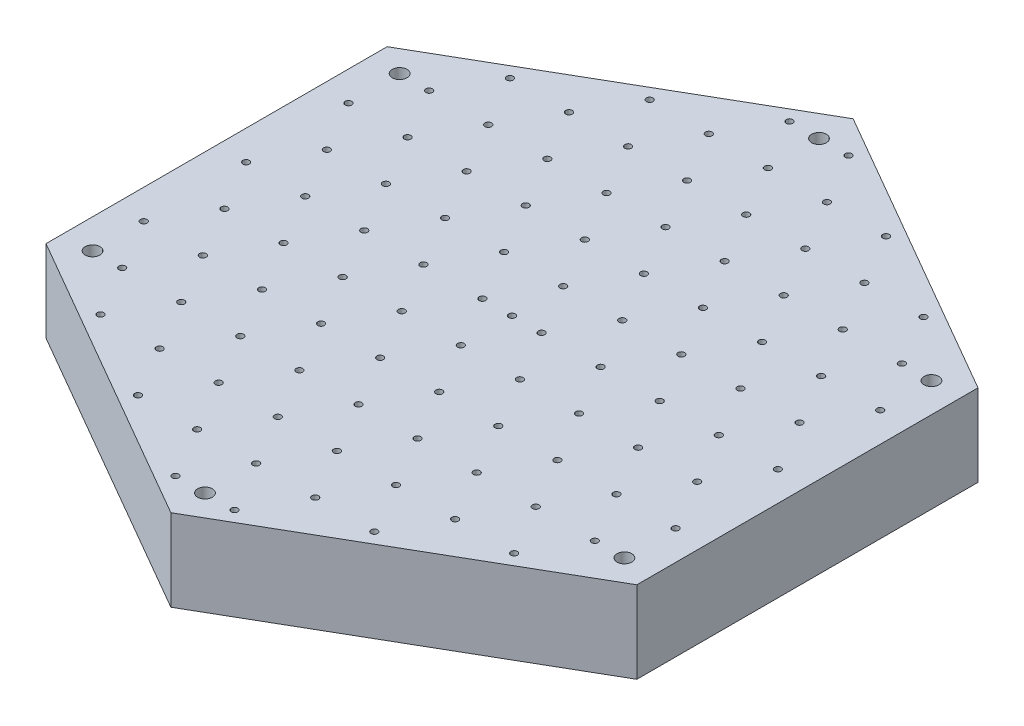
ISO-10303-21;
HEADER;
FILE_DESCRIPTION(('STEP AP214'),'2;1');
FILE_NAME('part.step','',(''),(''),'','','');
FILE_SCHEMA(('AUTOMOTIVE_DESIGN { 1 0 10303 214 1 1 1 1 }'));
ENDSEC;
DATA;
#1=APPLICATION_CONTEXT('core data for automotive mechanical design processes');
#2=APPLICATION_PROTOCOL_DEFINITION('international standard','automotive_design',2000,#1);
#3=PRODUCT_CONTEXT('',#1,'mechanical');
#4=PRODUCT('Part','Part','',(#3));
#5=PRODUCT_RELATED_PRODUCT_CATEGORY('part','',(#4));
#6=PRODUCT_DEFINITION_FORMATION('','',#4);
#7=PRODUCT_DEFINITION_CONTEXT('part definition',#1,'design');
#8=PRODUCT_DEFINITION('design','',#6,#7);
#9=PRODUCT_DEFINITION_SHAPE('','',#8);
#10=(LENGTH_UNIT() NAMED_UNIT(*) SI_UNIT(.MILLI.,.METRE.));
#11=(NAMED_UNIT(*) PLANE_ANGLE_UNIT() SI_UNIT($,.RADIAN.));
#12=(NAMED_UNIT(*) SI_UNIT($,.STERADIAN.) SOLID_ANGLE_UNIT());
#13=UNCERTAINTY_MEASURE_WITH_UNIT(LENGTH_MEASURE(1.E-05),#10,'distance_accuracy_value','');
#14=(GEOMETRIC_REPRESENTATION_CONTEXT(3) GLOBAL_UNCERTAINTY_ASSIGNED_CONTEXT((#13)) GLOBAL_UNIT_ASSIGNED_CONTEXT((#10,
#11,#12)) REPRESENTATION_CONTEXT('',''));
#15=CARTESIAN_POINT('',(0.,0.,0.));
#16=DIRECTION('',(0.,0.,1.));
#17=DIRECTION('',(1.,0.,0.));
#18=AXIS2_PLACEMENT_3D('',#15,#16,#17);
#19=CARTESIAN_POINT('',(54.1265877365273,15.,-31.25));
#20=DIRECTION('',(-0.5,0.,0.866025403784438));
#21=DIRECTION('',(0.866025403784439,0.,0.5));
#22=AXIS2_PLACEMENT_3D('',#19,#20,#21);
#23=PLANE('',#22);
#24=DIRECTION('',(-0.866025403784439,0.,-0.5));
#25=VECTOR('',#24,1.);
#26=CARTESIAN_POINT('',(54.1265877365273,0.,-31.25));
#27=LINE('',#26,#25);
#28=CARTESIAN_POINT('',(54.1265877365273,0.,-31.25));
#29=VERTEX_POINT('',#28);
#30=CARTESIAN_POINT('',(0.,0.,-62.5));
#31=VERTEX_POINT('',#30);
#32=EDGE_CURVE('E114',#29,#31,#27,.T.);
#33=ORIENTED_EDGE('',*,*,#32,.T.);
#34=DIRECTION('',(0.,-1.,0.));
#35=VECTOR('',#34,1.);
#36=CARTESIAN_POINT('',(0.,15.,-62.5));
#37=LINE('',#36,#35);
#38=CARTESIAN_POINT('',(0.,15.,-62.5));
#39=VERTEX_POINT('',#38);
#40=EDGE_CURVE('E11',#39,#31,#37,.T.);
#41=ORIENTED_EDGE('',*,*,#40,.F.);
#42=DIRECTION('',(-0.866025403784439,0.,-0.5));
#43=VECTOR('',#42,1.);
#44=CARTESIAN_POINT('',(54.1265877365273,15.,-31.25));
#45=LINE('',#44,#43);
#46=CARTESIAN_POINT('',(54.1265877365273,15.,-31.25));
#47=VERTEX_POINT('',#46);
#48=EDGE_CURVE('E81',#47,#39,#45,.T.);
#49=ORIENTED_EDGE('',*,*,#48,.F.);
#50=DIRECTION('',(0.,-1.,0.));
#51=VECTOR('',#50,1.);
#52=CARTESIAN_POINT('',(54.1265877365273,15.,-31.25));
#53=LINE('',#52,#51);
#54=EDGE_CURVE('E77',#47,#29,#53,.T.);
#55=ORIENTED_EDGE('',*,*,#54,.T.);
#56=EDGE_LOOP('',(#33,#41,#49,#55));
#57=FACE_BOUND('',#56,.T.);
#58=ADVANCED_FACE('F33',(#57),#23,.F.);
#59=CARTESIAN_POINT('',(0.,15.,-62.5));
#60=DIRECTION('',(0.5,0.,0.866025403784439));
#61=DIRECTION('',(0.866025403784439,0.,-0.5));
#62=AXIS2_PLACEMENT_3D('',#59,#60,#61);
#63=PLANE('',#62);
#64=DIRECTION('',(0.,-1.,0.));
#65=VECTOR('',#64,1.);
#66=CARTESIAN_POINT('',(-54.1265877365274,15.,-31.25));
#67=LINE('',#66,#65);
#68=CARTESIAN_POINT('',(-54.1265877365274,15.,-31.25));
#69=VERTEX_POINT('',#68);
#70=CARTESIAN_POINT('',(-54.1265877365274,0.,-31.25));
#71=VERTEX_POINT('',#70);
#72=EDGE_CURVE('E41',#69,#71,#67,.T.);
#73=ORIENTED_EDGE('',*,*,#72,.F.);
#74=DIRECTION('',(-0.866025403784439,0.,0.5));
#75=VECTOR('',#74,1.);
#76=CARTESIAN_POINT('',(0.,15.,-62.5));
#77=LINE('',#76,#75);
#78=EDGE_CURVE('E143',#39,#69,#77,.T.);
#79=ORIENTED_EDGE('',*,*,#78,.F.);
#80=ORIENTED_EDGE('',*,*,#40,.T.);
#81=DIRECTION('',(-0.866025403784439,0.,0.5));
#82=VECTOR('',#81,1.);
#83=CARTESIAN_POINT('',(0.,0.,-62.5));
#84=LINE('',#83,#82);
#85=EDGE_CURVE('E116',#31,#71,#84,.T.);
#86=ORIENTED_EDGE('',*,*,#85,.T.);
#87=EDGE_LOOP('',(#73,#79,#80,#86));
#88=FACE_BOUND('',#87,.T.);
#89=ADVANCED_FACE('F136',(#88),#63,.F.);
#90=CARTESIAN_POINT('',(-54.1265877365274,15.,-31.25));
#91=DIRECTION('',(1.,0.,0.));
#92=DIRECTION('',(0.,0.,-1.));
#93=AXIS2_PLACEMENT_3D('',#90,#91,#92);
#94=PLANE('',#93);
#95=DIRECTION('',(0.,-1.,0.));
#96=VECTOR('',#95,1.);
#97=CARTESIAN_POINT('',(-54.1265877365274,15.,31.25));
#98=LINE('',#97,#96);
#99=CARTESIAN_POINT('',(-54.1265877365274,15.,31.25));
#100=VERTEX_POINT('',#99);
#101=CARTESIAN_POINT('',(-54.1265877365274,0.,31.25));
#102=VERTEX_POINT('',#101);
#103=EDGE_CURVE('E107',#100,#102,#98,.T.);
#104=ORIENTED_EDGE('',*,*,#103,.F.);
#105=DIRECTION('',(0.,0.,1.));
#106=VECTOR('',#105,1.);
#107=CARTESIAN_POINT('',(-54.1265877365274,15.,-31.25));
#108=LINE('',#107,#106);
#109=EDGE_CURVE('E96',#69,#100,#108,.T.);
#110=ORIENTED_EDGE('',*,*,#109,.F.);
#111=ORIENTED_EDGE('',*,*,#72,.T.);
#112=DIRECTION('',(0.,0.,1.));
#113=VECTOR('',#112,1.);
#114=CARTESIAN_POINT('',(-54.1265877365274,0.,-31.25));
#115=LINE('',#114,#113);
#116=EDGE_CURVE('E120',#71,#102,#115,.T.);
#117=ORIENTED_EDGE('',*,*,#116,.T.);
#118=EDGE_LOOP('',(#104,#110,#111,#117));
#119=FACE_BOUND('',#118,.T.);
#120=ADVANCED_FACE('F132',(#119),#94,.F.);
#121=CARTESIAN_POINT('',(-54.1265877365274,15.,31.25));
#122=DIRECTION('',(0.5,0.,-0.866025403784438));
#123=DIRECTION('',(-0.866025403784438,0.,-0.5));
#124=AXIS2_PLACEMENT_3D('',#121,#122,#123);
#125=PLANE('',#124);
#126=DIRECTION('',(0.866025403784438,0.,0.5));
#127=VECTOR('',#126,1.);
#128=CARTESIAN_POINT('',(-54.1265877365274,0.,31.25));
#129=LINE('',#128,#127);
#130=CARTESIAN_POINT('',(0.,0.,62.5));
#131=VERTEX_POINT('',#130);
#132=EDGE_CURVE('E104',#102,#131,#129,.T.);
#133=ORIENTED_EDGE('',*,*,#132,.T.);
#134=DIRECTION('',(0.,-1.,0.));
#135=VECTOR('',#134,1.);
#136=CARTESIAN_POINT('',(0.,15.,62.5));
#137=LINE('',#136,#135);
#138=CARTESIAN_POINT('',(0.,15.,62.5));
#139=VERTEX_POINT('',#138);
#140=EDGE_CURVE('E101',#139,#131,#137,.T.);
#141=ORIENTED_EDGE('',*,*,#140,.F.);
#142=DIRECTION('',(0.866025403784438,0.,0.5));
#143=VECTOR('',#142,1.);
#144=CARTESIAN_POINT('',(-54.1265877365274,15.,31.25));
#145=LINE('',#144,#143);
#146=EDGE_CURVE('E89',#100,#139,#145,.T.);
#147=ORIENTED_EDGE('',*,*,#146,.F.);
#148=ORIENTED_EDGE('',*,*,#103,.T.);
#149=EDGE_LOOP('',(#133,#141,#147,#148));
#150=FACE_BOUND('',#149,.T.);
#151=ADVANCED_FACE('F102',(#150),#125,.F.);
#152=CARTESIAN_POINT('',(0.,15.,62.5));
#153=DIRECTION('',(-0.5,0.,-0.866025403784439));
#154=DIRECTION('',(-0.866025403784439,0.,0.5));
#155=AXIS2_PLACEMENT_3D('',#152,#153,#154);
#156=PLANE('',#155);
#157=DIRECTION('',(0.866025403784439,0.,-0.5));
#158=VECTOR('',#157,1.);
#159=CARTESIAN_POINT('',(0.,0.,62.5));
#160=LINE('',#159,#158);
#161=CARTESIAN_POINT('',(54.1265877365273,0.,31.25));
#162=VERTEX_POINT('',#161);
#163=EDGE_CURVE('E124',#131,#162,#160,.T.);
#164=ORIENTED_EDGE('',*,*,#163,.T.);
#165=DIRECTION('',(0.,-1.,0.));
#166=VECTOR('',#165,1.);
#167=CARTESIAN_POINT('',(54.1265877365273,15.,31.25));
#168=LINE('',#167,#166);
#169=CARTESIAN_POINT('',(54.1265877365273,15.,31.25));
#170=VERTEX_POINT('',#169);
#171=EDGE_CURVE('E70',#170,#162,#168,.T.);
#172=ORIENTED_EDGE('',*,*,#171,.F.);
#173=DIRECTION('',(0.866025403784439,0.,-0.5));
#174=VECTOR('',#173,1.);
#175=CARTESIAN_POINT('',(0.,15.,62.5));
#176=LINE('',#175,#174);
#177=EDGE_CURVE('E94',#139,#170,#176,.T.);
#178=ORIENTED_EDGE('',*,*,#177,.F.);
#179=ORIENTED_EDGE('',*,*,#140,.T.);
#180=EDGE_LOOP('',(#164,#172,#178,#179));
#181=FACE_BOUND('',#180,.T.);
#182=ADVANCED_FACE('F109',(#181),#156,.F.);
#183=CARTESIAN_POINT('',(54.1265877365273,15.,31.25));
#184=DIRECTION('',(-1.,0.,0.));
#185=DIRECTION('',(0.,0.,1.));
#186=AXIS2_PLACEMENT_3D('',#183,#184,#185);
#187=PLANE('',#186);
#188=ORIENTED_EDGE('',*,*,#54,.F.);
#189=DIRECTION('',(0.,0.,-1.));
#190=VECTOR('',#189,1.);
#191=CARTESIAN_POINT('',(54.1265877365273,15.,31.25));
#192=LINE('',#191,#190);
#193=EDGE_CURVE('E49',#170,#47,#192,.T.);
#194=ORIENTED_EDGE('',*,*,#193,.F.);
#195=ORIENTED_EDGE('',*,*,#171,.T.);
#196=DIRECTION('',(0.,0.,-1.));
#197=VECTOR('',#196,1.);
#198=CARTESIAN_POINT('',(54.1265877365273,0.,31.25));
#199=LINE('',#198,#197);
#200=EDGE_CURVE('E126',#162,#29,#199,.T.);
#201=ORIENTED_EDGE('',*,*,#200,.T.);
#202=EDGE_LOOP('',(#188,#194,#195,#201));
#203=FACE_BOUND('',#202,.T.);
#204=ADVANCED_FACE('F142',(#203),#187,.F.);
#205=CARTESIAN_POINT('',(0.,15.,0.));
#206=DIRECTION('',(0.,1.,0.));
#207=DIRECTION('',(0.,0.,1.));
#208=AXIS2_PLACEMENT_3D('',#205,#206,#207);
#209=PLANE('',#208);
#210=CARTESIAN_POINT('',(48.71385,15.,-18.7499696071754));
#211=DIRECTION('',(0.,1.,0.));
#212=DIRECTION('',(0.,0.,1.));
#213=AXIS2_PLACEMENT_3D('',#210,#211,#212);
#214=CIRCLE('',#213,0.599999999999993);
#215=CARTESIAN_POINT('',(48.71385,15.,-18.1499696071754));
#216=VERTEX_POINT('',#215);
#217=EDGE_CURVE('E759',#216,#216,#214,.T.);
#218=ORIENTED_EDGE('',*,*,#217,.F.);
#219=EDGE_LOOP('',(#218));
#220=FACE_BOUND('',#219,.T.);
#221=CARTESIAN_POINT('',(43.3012,15.,-28.1249544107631));
#222=DIRECTION('',(0.,1.,0.));
#223=DIRECTION('',(0.,0.,1.));
#224=AXIS2_PLACEMENT_3D('',#221,#222,#223);
#225=CIRCLE('',#224,0.6);
#226=CARTESIAN_POINT('',(43.3012,15.,-27.5249544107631));
#227=VERTEX_POINT('',#226);
#228=EDGE_CURVE('E753',#227,#227,#225,.T.);
#229=ORIENTED_EDGE('',*,*,#228,.F.);
#230=EDGE_LOOP('',(#229));
#231=FACE_BOUND('',#230,.T.);
#232=CARTESIAN_POINT('',(37.88855,15.,-37.4999392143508));
#233=DIRECTION('',(0.,1.,0.));
#234=DIRECTION('',(0.,0.,1.));
#235=AXIS2_PLACEMENT_3D('',#232,#233,#234);
#236=CIRCLE('',#235,0.6);
#237=CARTESIAN_POINT('',(37.88855,15.,-36.8999392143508));
#238=VERTEX_POINT('',#237);
#239=EDGE_CURVE('E747',#238,#238,#236,.T.);
#240=ORIENTED_EDGE('',*,*,#239,.F.);
#241=EDGE_LOOP('',(#240));
#242=FACE_BOUND('',#241,.T.);
#243=CARTESIAN_POINT('',(-21.6506,15.,46.8749240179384));
#244=DIRECTION('',(0.,1.,0.));
#245=DIRECTION('',(0.,0.,1.));
#246=AXIS2_PLACEMENT_3D('',#243,#244,#245);
#247=CIRCLE('',#246,0.600000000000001);
#248=CARTESIAN_POINT('',(-21.6506,15.,47.4749240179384));
#249=VERTEX_POINT('',#248);
#250=EDGE_CURVE('E741',#249,#249,#247,.T.);
#251=ORIENTED_EDGE('',*,*,#250,.F.);
#252=EDGE_LOOP('',(#251));
#253=FACE_BOUND('',#252,.T.);
#254=CARTESIAN_POINT('',(-5.41265000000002,15.,56.2499088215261));
#255=DIRECTION('',(0.,1.,0.));
#256=DIRECTION('',(0.,0.,1.));
#257=AXIS2_PLACEMENT_3D('',#254,#255,#256);
#258=CIRCLE('',#257,0.600000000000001);
#259=CARTESIAN_POINT('',(-5.41265000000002,15.,56.8499088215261));
#260=VERTEX_POINT('',#259);
#261=EDGE_CURVE('E735',#260,#260,#258,.T.);
#262=ORIENTED_EDGE('',*,*,#261,.F.);
#263=EDGE_LOOP('',(#262));
#264=FACE_BOUND('',#263,.T.);
#265=CARTESIAN_POINT('',(-10.8253,15.,46.8749240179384));
#266=DIRECTION('',(0.,1.,0.));
#267=DIRECTION('',(0.,0.,1.));
#268=AXIS2_PLACEMENT_3D('',#265,#266,#267);
#269=CIRCLE('',#268,0.600000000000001);
#270=CARTESIAN_POINT('',(-10.8253,15.,47.4749240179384));
#271=VERTEX_POINT('',#270);
#272=EDGE_CURVE('E729',#271,#271,#269,.T.);
#273=ORIENTED_EDGE('',*,*,#272,.F.);
#274=EDGE_LOOP('',(#273));
#275=FACE_BOUND('',#274,.T.);
#276=CARTESIAN_POINT('',(-16.23795,15.,37.4999392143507));
#277=DIRECTION('',(0.,1.,0.));
#278=DIRECTION('',(0.,0.,1.));
#279=AXIS2_PLACEMENT_3D('',#276,#277,#278);
#280=CIRCLE('',#279,0.600000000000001);
#281=CARTESIAN_POINT('',(-16.23795,15.,38.0999392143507));
#282=VERTEX_POINT('',#281);
#283=EDGE_CURVE('E723',#282,#282,#280,.T.);
#284=ORIENTED_EDGE('',*,*,#283,.F.);
#285=EDGE_LOOP('',(#284));
#286=FACE_BOUND('',#285,.T.);
#287=CARTESIAN_POINT('',(-48.71385,15.,-18.7499696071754));
#288=DIRECTION('',(0.,1.,0.));
#289=DIRECTION('',(0.,0.,1.));
#290=AXIS2_PLACEMENT_3D('',#287,#288,#289);
#291=CIRCLE('',#290,0.600000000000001);
#292=CARTESIAN_POINT('',(-48.71385,15.,-18.1499696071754));
#293=VERTEX_POINT('',#292);
#294=EDGE_CURVE('E717',#293,#293,#291,.T.);
#295=ORIENTED_EDGE('',*,*,#294,.F.);
#296=EDGE_LOOP('',(#295));
#297=FACE_BOUND('',#296,.T.);
#298=CARTESIAN_POINT('',(5.41264999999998,15.,56.2499088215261));
#299=DIRECTION('',(0.,1.,0.));
#300=DIRECTION('',(0.,0.,1.));
#301=AXIS2_PLACEMENT_3D('',#298,#299,#300);
#302=CIRCLE('',#301,0.6);
#303=CARTESIAN_POINT('',(5.41264999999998,15.,56.8499088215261));
#304=VERTEX_POINT('',#303);
#305=EDGE_CURVE('E711',#304,#304,#302,.T.);
#306=ORIENTED_EDGE('',*,*,#305,.F.);
#307=EDGE_LOOP('',(#306));
#308=FACE_BOUND('',#307,.T.);
#309=CARTESIAN_POINT('',(0.,15.,46.8749240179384));
#310=DIRECTION('',(0.,1.,0.));
#311=DIRECTION('',(0.,0.,1.));
#312=AXIS2_PLACEMENT_3D('',#309,#310,#311);
#313=CIRCLE('',#312,0.6);
#314=CARTESIAN_POINT('',(0.,15.,47.4749240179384));
#315=VERTEX_POINT('',#314);
#316=EDGE_CURVE('E705',#315,#315,#313,.T.);
#317=ORIENTED_EDGE('',*,*,#316,.F.);
#318=EDGE_LOOP('',(#317));
#319=FACE_BOUND('',#318,.T.);
#320=CARTESIAN_POINT('',(-5.41265000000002,15.,37.4999392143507));
#321=DIRECTION('',(0.,1.,0.));
#322=DIRECTION('',(0.,0.,1.));
#323=AXIS2_PLACEMENT_3D('',#320,#321,#322);
#324=CIRCLE('',#323,0.6);
#325=CARTESIAN_POINT('',(-5.41265000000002,15.,38.0999392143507));
#326=VERTEX_POINT('',#325);
#327=EDGE_CURVE('E699',#326,#326,#324,.T.);
#328=ORIENTED_EDGE('',*,*,#327,.F.);
#329=EDGE_LOOP('',(#328));
#330=FACE_BOUND('',#329,.T.);
#331=CARTESIAN_POINT('',(-10.8253,15.,28.124954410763));
#332=DIRECTION('',(0.,1.,0.));
#333=DIRECTION('',(0.,0.,1.));
#334=AXIS2_PLACEMENT_3D('',#331,#332,#333);
#335=CIRCLE('',#334,0.6);
#336=CARTESIAN_POINT('',(-10.8253,15.,28.7249544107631));
#337=VERTEX_POINT('',#336);
#338=EDGE_CURVE('E693',#337,#337,#335,.T.);
#339=ORIENTED_EDGE('',*,*,#338,.F.);
#340=EDGE_LOOP('',(#339));
#341=FACE_BOUND('',#340,.T.);
#342=CARTESIAN_POINT('',(-43.3012,15.,-28.1249544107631));
#343=DIRECTION('',(0.,1.,0.));
#344=DIRECTION('',(0.,0.,1.));
#345=AXIS2_PLACEMENT_3D('',#342,#343,#344);
#346=CIRCLE('',#345,0.6);
#347=CARTESIAN_POINT('',(-43.3012,15.,-27.5249544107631));
#348=VERTEX_POINT('',#347);
#349=EDGE_CURVE('E687',#348,#348,#346,.T.);
#350=ORIENTED_EDGE('',*,*,#349,.F.);
#351=EDGE_LOOP('',(#350));
#352=FACE_BOUND('',#351,.T.);
#353=CARTESIAN_POINT('',(10.8253,15.,46.8749240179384));
#354=DIRECTION('',(0.,1.,0.));
#355=DIRECTION('',(0.,0.,1.));
#356=AXIS2_PLACEMENT_3D('',#353,#354,#355);
#357=CIRCLE('',#356,0.6);
#358=CARTESIAN_POINT('',(10.8253,15.,47.4749240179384));
#359=VERTEX_POINT('',#358);
#360=EDGE_CURVE('E681',#359,#359,#357,.T.);
#361=ORIENTED_EDGE('',*,*,#360,.F.);
#362=EDGE_LOOP('',(#361));
#363=FACE_BOUND('',#362,.T.);
#364=CARTESIAN_POINT('',(5.41264999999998,15.,37.4999392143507));
#365=DIRECTION('',(0.,1.,0.));
#366=DIRECTION('',(0.,0.,1.));
#367=AXIS2_PLACEMENT_3D('',#364,#365,#366);
#368=CIRCLE('',#367,0.6);
#369=CARTESIAN_POINT('',(5.41264999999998,15.,38.0999392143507));
#370=VERTEX_POINT('',#369);
#371=EDGE_CURVE('E675',#370,#370,#368,.T.);
#372=ORIENTED_EDGE('',*,*,#371,.F.);
#373=EDGE_LOOP('',(#372));
#374=FACE_BOUND('',#373,.T.);
#375=CARTESIAN_POINT('',(0.,15.,28.124954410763));
#376=DIRECTION('',(0.,1.,0.));
#377=DIRECTION('',(0.,0.,1.));
#378=AXIS2_PLACEMENT_3D('',#375,#376,#377);
#379=CIRCLE('',#378,0.6);
#380=CARTESIAN_POINT('',(0.,15.,28.7249544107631));
#381=VERTEX_POINT('',#380);
#382=EDGE_CURVE('E669',#381,#381,#379,.T.);
#383=ORIENTED_EDGE('',*,*,#382,.F.);
#384=EDGE_LOOP('',(#383));
#385=FACE_BOUND('',#384,.T.);
#386=CARTESIAN_POINT('',(-5.41265000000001,15.,18.7499696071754));
#387=DIRECTION('',(0.,1.,0.));
#388=DIRECTION('',(0.,0.,1.));
#389=AXIS2_PLACEMENT_3D('',#386,#387,#388);
#390=CIRCLE('',#389,0.6);
#391=CARTESIAN_POINT('',(-5.41265000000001,15.,19.3499696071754));
#392=VERTEX_POINT('',#391);
#393=EDGE_CURVE('E663',#392,#392,#390,.T.);
#394=ORIENTED_EDGE('',*,*,#393,.F.);
#395=EDGE_LOOP('',(#394));
#396=FACE_BOUND('',#395,.T.);
#397=CARTESIAN_POINT('',(-37.88855,15.,-37.4999392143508));
#398=DIRECTION('',(0.,1.,0.));
#399=DIRECTION('',(0.,0.,1.));
#400=AXIS2_PLACEMENT_3D('',#397,#398,#399);
#401=CIRCLE('',#400,0.6);
#402=CARTESIAN_POINT('',(-37.88855,15.,-36.8999392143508));
#403=VERTEX_POINT('',#402);
#404=EDGE_CURVE('E657',#403,#403,#401,.T.);
#405=ORIENTED_EDGE('',*,*,#404,.F.);
#406=EDGE_LOOP('',(#405));
#407=FACE_BOUND('',#406,.T.);
#408=CARTESIAN_POINT('',(21.6506,15.,46.8749240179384));
#409=DIRECTION('',(0.,1.,0.));
#410=DIRECTION('',(0.,0.,1.));
#411=AXIS2_PLACEMENT_3D('',#408,#409,#410);
#412=CIRCLE('',#411,0.6);
#413=CARTESIAN_POINT('',(21.6506,15.,47.4749240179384));
#414=VERTEX_POINT('',#413);
#415=EDGE_CURVE('E651',#414,#414,#412,.T.);
#416=ORIENTED_EDGE('',*,*,#415,.F.);
#417=EDGE_LOOP('',(#416));
#418=FACE_BOUND('',#417,.T.);
#419=CARTESIAN_POINT('',(16.23795,15.,37.4999392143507));
#420=DIRECTION('',(0.,1.,0.));
#421=DIRECTION('',(0.,0.,1.));
#422=AXIS2_PLACEMENT_3D('',#419,#420,#421);
#423=CIRCLE('',#422,0.6);
#424=CARTESIAN_POINT('',(16.23795,15.,38.0999392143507));
#425=VERTEX_POINT('',#424);
#426=EDGE_CURVE('E645',#425,#425,#423,.T.);
#427=ORIENTED_EDGE('',*,*,#426,.F.);
#428=EDGE_LOOP('',(#427));
#429=FACE_BOUND('',#428,.T.);
#430=CARTESIAN_POINT('',(10.8253,15.,28.124954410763));
#431=DIRECTION('',(0.,1.,0.));
#432=DIRECTION('',(0.,0.,1.));
#433=AXIS2_PLACEMENT_3D('',#430,#431,#432);
#434=CIRCLE('',#433,0.6);
#435=CARTESIAN_POINT('',(10.8253,15.,28.7249544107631));
#436=VERTEX_POINT('',#435);
#437=EDGE_CURVE('E639',#436,#436,#434,.T.);
#438=ORIENTED_EDGE('',*,*,#437,.F.);
#439=EDGE_LOOP('',(#438));
#440=FACE_BOUND('',#439,.T.);
#441=CARTESIAN_POINT('',(5.41264999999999,15.,18.7499696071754));
#442=DIRECTION('',(0.,1.,0.));
#443=DIRECTION('',(0.,0.,1.));
#444=AXIS2_PLACEMENT_3D('',#441,#442,#443);
#445=CIRCLE('',#444,0.6);
#446=CARTESIAN_POINT('',(5.41264999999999,15.,19.3499696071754));
#447=VERTEX_POINT('',#446);
#448=EDGE_CURVE('E633',#447,#447,#445,.T.);
#449=ORIENTED_EDGE('',*,*,#448,.F.);
#450=EDGE_LOOP('',(#449));
#451=FACE_BOUND('',#450,.T.);
#452=CARTESIAN_POINT('',(0.,15.,9.37498480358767));
#453=DIRECTION('',(0.,1.,0.));
#454=DIRECTION('',(0.,0.,1.));
#455=AXIS2_PLACEMENT_3D('',#452,#453,#454);
#456=CIRCLE('',#455,0.6);
#457=CARTESIAN_POINT('',(0.,15.,9.97498480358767));
#458=VERTEX_POINT('',#457);
#459=EDGE_CURVE('E627',#458,#458,#456,.T.);
#460=ORIENTED_EDGE('',*,*,#459,.F.);
#461=EDGE_LOOP('',(#460));
#462=FACE_BOUND('',#461,.T.);
#463=CARTESIAN_POINT('',(-27.06325,15.,-37.4999392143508));
#464=DIRECTION('',(0.,1.,0.));
#465=DIRECTION('',(0.,0.,1.));
#466=AXIS2_PLACEMENT_3D('',#463,#464,#465);
#467=CIRCLE('',#466,0.600000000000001);
#468=CARTESIAN_POINT('',(-27.06325,15.,-36.8999392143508));
#469=VERTEX_POINT('',#468);
#470=EDGE_CURVE('E621',#469,#469,#467,.T.);
#471=ORIENTED_EDGE('',*,*,#470,.F.);
#472=EDGE_LOOP('',(#471));
#473=FACE_BOUND('',#472,.T.);
#474=CARTESIAN_POINT('',(-32.4759,15.,-28.1249544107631));
#475=DIRECTION('',(0.,1.,0.));
#476=DIRECTION('',(0.,0.,1.));
#477=AXIS2_PLACEMENT_3D('',#474,#475,#476);
#478=CIRCLE('',#477,0.600000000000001);
#479=CARTESIAN_POINT('',(-32.4759,15.,-27.5249544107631));
#480=VERTEX_POINT('',#479);
#481=EDGE_CURVE('E615',#480,#480,#478,.T.);
#482=ORIENTED_EDGE('',*,*,#481,.F.);
#483=EDGE_LOOP('',(#482));
#484=FACE_BOUND('',#483,.T.);
#485=CARTESIAN_POINT('',(-37.88855,15.,-18.7499696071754));
#486=DIRECTION('',(0.,1.,0.));
#487=DIRECTION('',(0.,0.,1.));
#488=AXIS2_PLACEMENT_3D('',#485,#486,#487);
#489=CIRCLE('',#488,0.600000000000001);
#490=CARTESIAN_POINT('',(-37.88855,15.,-18.1499696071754));
#491=VERTEX_POINT('',#490);
#492=EDGE_CURVE('E609',#491,#491,#489,.T.);
#493=ORIENTED_EDGE('',*,*,#492,.F.);
#494=EDGE_LOOP('',(#493));
#495=FACE_BOUND('',#494,.T.);
#496=CARTESIAN_POINT('',(-43.3012,15.,-9.3749848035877));
#497=DIRECTION('',(0.,1.,0.));
#498=DIRECTION('',(0.,0.,1.));
#499=AXIS2_PLACEMENT_3D('',#496,#497,#498);
#500=CIRCLE('',#499,0.600000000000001);
#501=CARTESIAN_POINT('',(-43.3012,15.,-8.7749848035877));
#502=VERTEX_POINT('',#501);
#503=EDGE_CURVE('E603',#502,#502,#500,.T.);
#504=ORIENTED_EDGE('',*,*,#503,.F.);
#505=EDGE_LOOP('',(#504));
#506=FACE_BOUND('',#505,.T.);
#507=CARTESIAN_POINT('',(-21.6506,15.,-28.1249544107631));
#508=DIRECTION('',(0.,1.,0.));
#509=DIRECTION('',(0.,0.,1.));
#510=AXIS2_PLACEMENT_3D('',#507,#508,#509);
#511=CIRCLE('',#510,0.600000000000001);
#512=CARTESIAN_POINT('',(-21.6506,15.,-27.5249544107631));
#513=VERTEX_POINT('',#512);
#514=EDGE_CURVE('E597',#513,#513,#511,.T.);
#515=ORIENTED_EDGE('',*,*,#514,.F.);
#516=EDGE_LOOP('',(#515));
#517=FACE_BOUND('',#516,.T.);
#518=CARTESIAN_POINT('',(-27.06325,15.,-18.7499696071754));
#519=DIRECTION('',(0.,1.,0.));
#520=DIRECTION('',(0.,0.,1.));
#521=AXIS2_PLACEMENT_3D('',#518,#519,#520);
#522=CIRCLE('',#521,0.600000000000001);
#523=CARTESIAN_POINT('',(-27.06325,15.,-18.1499696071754));
#524=VERTEX_POINT('',#523);
#525=EDGE_CURVE('E591',#524,#524,#522,.T.);
#526=ORIENTED_EDGE('',*,*,#525,.F.);
#527=EDGE_LOOP('',(#526));
#528=FACE_BOUND('',#527,.T.);
#529=CARTESIAN_POINT('',(-32.4759,15.,-9.3749848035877));
#530=DIRECTION('',(0.,1.,0.));
#531=DIRECTION('',(0.,0.,1.));
#532=AXIS2_PLACEMENT_3D('',#529,#530,#531);
#533=CIRCLE('',#532,0.600000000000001);
#534=CARTESIAN_POINT('',(-32.4759,15.,-8.7749848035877));
#535=VERTEX_POINT('',#534);
#536=EDGE_CURVE('E585',#535,#535,#533,.T.);
#537=ORIENTED_EDGE('',*,*,#536,.F.);
#538=EDGE_LOOP('',(#537));
#539=FACE_BOUND('',#538,.T.);
#540=CARTESIAN_POINT('',(-48.71385,15.,18.7499696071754));
#541=DIRECTION('',(0.,1.,0.));
#542=DIRECTION('',(0.,0.,1.));
#543=AXIS2_PLACEMENT_3D('',#540,#541,#542);
#544=CIRCLE('',#543,0.600000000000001);
#545=CARTESIAN_POINT('',(-48.71385,15.,19.3499696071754));
#546=VERTEX_POINT('',#545);
#547=EDGE_CURVE('E579',#546,#546,#544,.T.);
#548=ORIENTED_EDGE('',*,*,#547,.F.);
#549=EDGE_LOOP('',(#548));
#550=FACE_BOUND('',#549,.T.);
#551=CARTESIAN_POINT('',(-43.3012,15.,9.37498480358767));
#552=DIRECTION('',(0.,1.,0.));
#553=DIRECTION('',(0.,0.,1.));
#554=AXIS2_PLACEMENT_3D('',#551,#552,#553);
#555=CIRCLE('',#554,0.600000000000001);
#556=CARTESIAN_POINT('',(-43.3012,15.,9.97498480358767));
#557=VERTEX_POINT('',#556);
#558=EDGE_CURVE('E573',#557,#557,#555,.T.);
#559=ORIENTED_EDGE('',*,*,#558,.F.);
#560=EDGE_LOOP('',(#559));
#561=FACE_BOUND('',#560,.T.);
#562=CARTESIAN_POINT('',(-43.3012,15.,28.124954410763));
#563=DIRECTION('',(0.,1.,0.));
#564=DIRECTION('',(0.,0.,1.));
#565=AXIS2_PLACEMENT_3D('',#562,#563,#564);
#566=CIRCLE('',#565,0.6);
#567=CARTESIAN_POINT('',(-43.3012,15.,28.7249544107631));
#568=VERTEX_POINT('',#567);
#569=EDGE_CURVE('E567',#568,#568,#566,.T.);
#570=ORIENTED_EDGE('',*,*,#569,.F.);
#571=EDGE_LOOP('',(#570));
#572=FACE_BOUND('',#571,.T.);
#573=CARTESIAN_POINT('',(-37.88855,15.,18.7499696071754));
#574=DIRECTION('',(0.,1.,0.));
#575=DIRECTION('',(0.,0.,1.));
#576=AXIS2_PLACEMENT_3D('',#573,#574,#575);
#577=CIRCLE('',#576,0.6);
#578=CARTESIAN_POINT('',(-37.88855,15.,19.3499696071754));
#579=VERTEX_POINT('',#578);
#580=EDGE_CURVE('E561',#579,#579,#577,.T.);
#581=ORIENTED_EDGE('',*,*,#580,.F.);
#582=EDGE_LOOP('',(#581));
#583=FACE_BOUND('',#582,.T.);
#584=CARTESIAN_POINT('',(-32.4759,15.,9.37498480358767));
#585=DIRECTION('',(0.,1.,0.));
#586=DIRECTION('',(0.,0.,1.));
#587=AXIS2_PLACEMENT_3D('',#584,#585,#586);
#588=CIRCLE('',#587,0.6);
#589=CARTESIAN_POINT('',(-32.4759,15.,9.97498480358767));
#590=VERTEX_POINT('',#589);
#591=EDGE_CURVE('E555',#590,#590,#588,.T.);
#592=ORIENTED_EDGE('',*,*,#591,.F.);
#593=EDGE_LOOP('',(#592));
#594=FACE_BOUND('',#593,.T.);
#595=CARTESIAN_POINT('',(-16.23795,15.,-18.7499696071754));
#596=DIRECTION('',(0.,1.,0.));
#597=DIRECTION('',(0.,0.,1.));
#598=AXIS2_PLACEMENT_3D('',#595,#596,#597);
#599=CIRCLE('',#598,0.6);
#600=CARTESIAN_POINT('',(-16.23795,15.,-18.1499696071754));
#601=VERTEX_POINT('',#600);
#602=EDGE_CURVE('E549',#601,#601,#599,.T.);
#603=ORIENTED_EDGE('',*,*,#602,.F.);
#604=EDGE_LOOP('',(#603));
#605=FACE_BOUND('',#604,.T.);
#606=CARTESIAN_POINT('',(-21.6506,15.,-9.3749848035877));
#607=DIRECTION('',(0.,1.,0.));
#608=DIRECTION('',(0.,0.,1.));
#609=AXIS2_PLACEMENT_3D('',#606,#607,#608);
#610=CIRCLE('',#609,0.6);
#611=CARTESIAN_POINT('',(-21.6506,15.,-8.7749848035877));
#612=VERTEX_POINT('',#611);
#613=EDGE_CURVE('E543',#612,#612,#610,.T.);
#614=ORIENTED_EDGE('',*,*,#613,.F.);
#615=EDGE_LOOP('',(#614));
#616=FACE_BOUND('',#615,.T.);
#617=CARTESIAN_POINT('',(-37.88855,15.,37.4999392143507));
#618=DIRECTION('',(0.,1.,0.));
#619=DIRECTION('',(0.,0.,1.));
#620=AXIS2_PLACEMENT_3D('',#617,#618,#619);
#621=CIRCLE('',#620,0.6);
#622=CARTESIAN_POINT('',(-37.88855,15.,38.0999392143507));
#623=VERTEX_POINT('',#622);
#624=EDGE_CURVE('E537',#623,#623,#621,.T.);
#625=ORIENTED_EDGE('',*,*,#624,.F.);
#626=EDGE_LOOP('',(#625));
#627=FACE_BOUND('',#626,.T.);
#628=CARTESIAN_POINT('',(-32.4759,15.,28.124954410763));
#629=DIRECTION('',(0.,1.,0.));
#630=DIRECTION('',(0.,0.,1.));
#631=AXIS2_PLACEMENT_3D('',#628,#629,#630);
#632=CIRCLE('',#631,0.6);
#633=CARTESIAN_POINT('',(-32.4759,15.,28.7249544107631));
#634=VERTEX_POINT('',#633);
#635=EDGE_CURVE('E531',#634,#634,#632,.T.);
#636=ORIENTED_EDGE('',*,*,#635,.F.);
#637=EDGE_LOOP('',(#636));
#638=FACE_BOUND('',#637,.T.);
#639=CARTESIAN_POINT('',(-27.06325,15.,18.7499696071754));
#640=DIRECTION('',(0.,1.,0.));
#641=DIRECTION('',(0.,0.,1.));
#642=AXIS2_PLACEMENT_3D('',#639,#640,#641);
#643=CIRCLE('',#642,0.6);
#644=CARTESIAN_POINT('',(-27.06325,15.,19.3499696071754));
#645=VERTEX_POINT('',#644);
#646=EDGE_CURVE('E525',#645,#645,#643,.T.);
#647=ORIENTED_EDGE('',*,*,#646,.F.);
#648=EDGE_LOOP('',(#647));
#649=FACE_BOUND('',#648,.T.);
#650=CARTESIAN_POINT('',(-21.6506,15.,9.37498480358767));
#651=DIRECTION('',(0.,1.,0.));
#652=DIRECTION('',(0.,0.,1.));
#653=AXIS2_PLACEMENT_3D('',#650,#651,#652);
#654=CIRCLE('',#653,0.6);
#655=CARTESIAN_POINT('',(-21.6506,15.,9.97498480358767));
#656=VERTEX_POINT('',#655);
#657=EDGE_CURVE('E519',#656,#656,#654,.T.);
#658=ORIENTED_EDGE('',*,*,#657,.F.);
#659=EDGE_LOOP('',(#658));
#660=FACE_BOUND('',#659,.T.);
#661=CARTESIAN_POINT('',(-10.8253,15.,-9.3749848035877));
#662=DIRECTION('',(0.,1.,0.));
#663=DIRECTION('',(0.,0.,1.));
#664=AXIS2_PLACEMENT_3D('',#661,#662,#663);
#665=CIRCLE('',#664,0.6);
#666=CARTESIAN_POINT('',(-10.8253,15.,-8.7749848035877));
#667=VERTEX_POINT('',#666);
#668=EDGE_CURVE('E513',#667,#667,#665,.T.);
#669=ORIENTED_EDGE('',*,*,#668,.F.);
#670=EDGE_LOOP('',(#669));
#671=FACE_BOUND('',#670,.T.);
#672=CARTESIAN_POINT('',(-27.06325,15.,37.4999392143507));
#673=DIRECTION('',(0.,1.,0.));
#674=DIRECTION('',(0.,0.,1.));
#675=AXIS2_PLACEMENT_3D('',#672,#673,#674);
#676=CIRCLE('',#675,0.6);
#677=CARTESIAN_POINT('',(-27.06325,15.,38.0999392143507));
#678=VERTEX_POINT('',#677);
#679=EDGE_CURVE('E507',#678,#678,#676,.T.);
#680=ORIENTED_EDGE('',*,*,#679,.F.);
#681=EDGE_LOOP('',(#680));
#682=FACE_BOUND('',#681,.T.);
#683=CARTESIAN_POINT('',(-21.6506,15.,28.124954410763));
#684=DIRECTION('',(0.,1.,0.));
#685=DIRECTION('',(0.,0.,1.));
#686=AXIS2_PLACEMENT_3D('',#683,#684,#685);
#687=CIRCLE('',#686,0.6);
#688=CARTESIAN_POINT('',(-21.6506,15.,28.7249544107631));
#689=VERTEX_POINT('',#688);
#690=EDGE_CURVE('E501',#689,#689,#687,.T.);
#691=ORIENTED_EDGE('',*,*,#690,.F.);
#692=EDGE_LOOP('',(#691));
#693=FACE_BOUND('',#692,.T.);
#694=CARTESIAN_POINT('',(-16.23795,15.,18.7499696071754));
#695=DIRECTION('',(0.,1.,0.));
#696=DIRECTION('',(0.,0.,1.));
#697=AXIS2_PLACEMENT_3D('',#694,#695,#696);
#698=CIRCLE('',#697,0.6);
#699=CARTESIAN_POINT('',(-16.23795,15.,19.3499696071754));
#700=VERTEX_POINT('',#699);
#701=EDGE_CURVE('E495',#700,#700,#698,.T.);
#702=ORIENTED_EDGE('',*,*,#701,.F.);
#703=EDGE_LOOP('',(#702));
#704=FACE_BOUND('',#703,.T.);
#705=CARTESIAN_POINT('',(-10.8253,15.,9.37498480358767));
#706=DIRECTION('',(0.,1.,0.));
#707=DIRECTION('',(0.,0.,1.));
#708=AXIS2_PLACEMENT_3D('',#705,#706,#707);
#709=CIRCLE('',#708,0.6);
#710=CARTESIAN_POINT('',(-10.8253,15.,9.97498480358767));
#711=VERTEX_POINT('',#710);
#712=EDGE_CURVE('E489',#711,#711,#709,.T.);
#713=ORIENTED_EDGE('',*,*,#712,.F.);
#714=EDGE_LOOP('',(#713));
#715=FACE_BOUND('',#714,.T.);
#716=CARTESIAN_POINT('',(21.6506,15.,-46.8749240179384));
#717=DIRECTION('',(0.,1.,0.));
#718=DIRECTION('',(0.,0.,1.));
#719=AXIS2_PLACEMENT_3D('',#716,#717,#718);
#720=CIRCLE('',#719,0.600000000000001);
#721=CARTESIAN_POINT('',(21.6506,15.,-46.2749240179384));
#722=VERTEX_POINT('',#721);
#723=EDGE_CURVE('E483',#722,#722,#720,.T.);
#724=ORIENTED_EDGE('',*,*,#723,.F.);
#725=EDGE_LOOP('',(#724));
#726=FACE_BOUND('',#725,.T.);
#727=CARTESIAN_POINT('',(27.06325,15.,-37.4999392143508));
#728=DIRECTION('',(0.,1.,0.));
#729=DIRECTION('',(0.,0.,1.));
#730=AXIS2_PLACEMENT_3D('',#727,#728,#729);
#731=CIRCLE('',#730,0.600000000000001);
#732=CARTESIAN_POINT('',(27.06325,15.,-36.8999392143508));
#733=VERTEX_POINT('',#732);
#734=EDGE_CURVE('E477',#733,#733,#731,.T.);
#735=ORIENTED_EDGE('',*,*,#734,.F.);
#736=EDGE_LOOP('',(#735));
#737=FACE_BOUND('',#736,.T.);
#738=CARTESIAN_POINT('',(32.4759,15.,-28.1249544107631));
#739=DIRECTION('',(0.,1.,0.));
#740=DIRECTION('',(0.,0.,1.));
#741=AXIS2_PLACEMENT_3D('',#738,#739,#740);
#742=CIRCLE('',#741,0.600000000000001);
#743=CARTESIAN_POINT('',(32.4759,15.,-27.5249544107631));
#744=VERTEX_POINT('',#743);
#745=EDGE_CURVE('E471',#744,#744,#742,.T.);
#746=ORIENTED_EDGE('',*,*,#745,.F.);
#747=EDGE_LOOP('',(#746));
#748=FACE_BOUND('',#747,.T.);
#749=CARTESIAN_POINT('',(37.88855,15.,-18.7499696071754));
#750=DIRECTION('',(0.,1.,0.));
#751=DIRECTION('',(0.,0.,1.));
#752=AXIS2_PLACEMENT_3D('',#749,#750,#751);
#753=CIRCLE('',#752,0.600000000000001);
#754=CARTESIAN_POINT('',(37.88855,15.,-18.1499696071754));
#755=VERTEX_POINT('',#754);
#756=EDGE_CURVE('E465',#755,#755,#753,.T.);
#757=ORIENTED_EDGE('',*,*,#756,.F.);
#758=EDGE_LOOP('',(#757));
#759=FACE_BOUND('',#758,.T.);
#760=CARTESIAN_POINT('',(43.3012,15.,-9.3749848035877));
#761=DIRECTION('',(0.,1.,0.));
#762=DIRECTION('',(0.,0.,1.));
#763=AXIS2_PLACEMENT_3D('',#760,#761,#762);
#764=CIRCLE('',#763,0.600000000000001);
#765=CARTESIAN_POINT('',(43.3012,15.,-8.7749848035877));
#766=VERTEX_POINT('',#765);
#767=EDGE_CURVE('E459',#766,#766,#764,.T.);
#768=ORIENTED_EDGE('',*,*,#767,.F.);
#769=EDGE_LOOP('',(#768));
#770=FACE_BOUND('',#769,.T.);
#771=CARTESIAN_POINT('',(48.71385,15.,18.7499696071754));
#772=DIRECTION('',(0.,1.,0.));
#773=DIRECTION('',(0.,0.,1.));
#774=AXIS2_PLACEMENT_3D('',#771,#772,#773);
#775=CIRCLE('',#774,0.599999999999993);
#776=CARTESIAN_POINT('',(48.71385,15.,19.3499696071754));
#777=VERTEX_POINT('',#776);
#778=EDGE_CURVE('E453',#777,#777,#775,.T.);
#779=ORIENTED_EDGE('',*,*,#778,.F.);
#780=EDGE_LOOP('',(#779));
#781=FACE_BOUND('',#780,.T.);
#782=CARTESIAN_POINT('',(43.3012,15.,9.37498480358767));
#783=DIRECTION('',(0.,1.,0.));
#784=DIRECTION('',(0.,0.,1.));
#785=AXIS2_PLACEMENT_3D('',#782,#783,#784);
#786=CIRCLE('',#785,0.599999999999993);
#787=CARTESIAN_POINT('',(43.3012,15.,9.97498480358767));
#788=VERTEX_POINT('',#787);
#789=EDGE_CURVE('E447',#788,#788,#786,.T.);
#790=ORIENTED_EDGE('',*,*,#789,.F.);
#791=EDGE_LOOP('',(#790));
#792=FACE_BOUND('',#791,.T.);
#793=CARTESIAN_POINT('',(5.41265000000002,15.,-56.2499088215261));
#794=DIRECTION('',(0.,1.,0.));
#795=DIRECTION('',(0.,0.,1.));
#796=AXIS2_PLACEMENT_3D('',#793,#794,#795);
#797=CIRCLE('',#796,0.599999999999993);
#798=CARTESIAN_POINT('',(5.41265000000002,15.,-55.6499088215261));
#799=VERTEX_POINT('',#798);
#800=EDGE_CURVE('E441',#799,#799,#797,.T.);
#801=ORIENTED_EDGE('',*,*,#800,.F.);
#802=EDGE_LOOP('',(#801));
#803=FACE_BOUND('',#802,.T.);
#804=CARTESIAN_POINT('',(10.8253,15.,-46.8749240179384));
#805=DIRECTION('',(0.,1.,0.));
#806=DIRECTION('',(0.,0.,1.));
#807=AXIS2_PLACEMENT_3D('',#804,#805,#806);
#808=CIRCLE('',#807,0.599999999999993);
#809=CARTESIAN_POINT('',(10.8253,15.,-46.2749240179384));
#810=VERTEX_POINT('',#809);
#811=EDGE_CURVE('E435',#810,#810,#808,.T.);
#812=ORIENTED_EDGE('',*,*,#811,.F.);
#813=EDGE_LOOP('',(#812));
#814=FACE_BOUND('',#813,.T.);
#815=CARTESIAN_POINT('',(16.23795,15.,-37.4999392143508));
#816=DIRECTION('',(0.,1.,0.));
#817=DIRECTION('',(0.,0.,1.));
#818=AXIS2_PLACEMENT_3D('',#815,#816,#817);
#819=CIRCLE('',#818,0.599999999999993);
#820=CARTESIAN_POINT('',(16.23795,15.,-36.8999392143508));
#821=VERTEX_POINT('',#820);
#822=EDGE_CURVE('E429',#821,#821,#819,.T.);
#823=ORIENTED_EDGE('',*,*,#822,.F.);
#824=EDGE_LOOP('',(#823));
#825=FACE_BOUND('',#824,.T.);
#826=CARTESIAN_POINT('',(21.6506,15.,-28.1249544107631));
#827=DIRECTION('',(0.,1.,0.));
#828=DIRECTION('',(0.,0.,1.));
#829=AXIS2_PLACEMENT_3D('',#826,#827,#828);
#830=CIRCLE('',#829,0.599999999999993);
#831=CARTESIAN_POINT('',(21.6506,15.,-27.5249544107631));
#832=VERTEX_POINT('',#831);
#833=EDGE_CURVE('E423',#832,#832,#830,.T.);
#834=ORIENTED_EDGE('',*,*,#833,.F.);
#835=EDGE_LOOP('',(#834));
#836=FACE_BOUND('',#835,.T.);
#837=CARTESIAN_POINT('',(27.06325,15.,-18.7499696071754));
#838=DIRECTION('',(0.,1.,0.));
#839=DIRECTION('',(0.,0.,1.));
#840=AXIS2_PLACEMENT_3D('',#837,#838,#839);
#841=CIRCLE('',#840,0.599999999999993);
#842=CARTESIAN_POINT('',(27.06325,15.,-18.1499696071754));
#843=VERTEX_POINT('',#842);
#844=EDGE_CURVE('E417',#843,#843,#841,.T.);
#845=ORIENTED_EDGE('',*,*,#844,.F.);
#846=EDGE_LOOP('',(#845));
#847=FACE_BOUND('',#846,.T.);
#848=CARTESIAN_POINT('',(32.4759,15.,-9.3749848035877));
#849=DIRECTION('',(0.,1.,0.));
#850=DIRECTION('',(0.,0.,1.));
#851=AXIS2_PLACEMENT_3D('',#848,#849,#850);
#852=CIRCLE('',#851,0.599999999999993);
#853=CARTESIAN_POINT('',(32.4759,15.,-8.77498480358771));
#854=VERTEX_POINT('',#853);
#855=EDGE_CURVE('E411',#854,#854,#852,.T.);
#856=ORIENTED_EDGE('',*,*,#855,.F.);
#857=EDGE_LOOP('',(#856));
#858=FACE_BOUND('',#857,.T.);
#859=CARTESIAN_POINT('',(43.3012,15.,28.124954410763));
#860=DIRECTION('',(0.,1.,0.));
#861=DIRECTION('',(0.,0.,1.));
#862=AXIS2_PLACEMENT_3D('',#859,#860,#861);
#863=CIRCLE('',#862,0.6);
#864=CARTESIAN_POINT('',(43.3012,15.,28.7249544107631));
#865=VERTEX_POINT('',#864);
#866=EDGE_CURVE('E405',#865,#865,#863,.T.);
#867=ORIENTED_EDGE('',*,*,#866,.F.);
#868=EDGE_LOOP('',(#867));
#869=FACE_BOUND('',#868,.T.);
#870=CARTESIAN_POINT('',(37.88855,15.,18.7499696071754));
#871=DIRECTION('',(0.,1.,0.));
#872=DIRECTION('',(0.,0.,1.));
#873=AXIS2_PLACEMENT_3D('',#870,#871,#872);
#874=CIRCLE('',#873,0.6);
#875=CARTESIAN_POINT('',(37.88855,15.,19.3499696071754));
#876=VERTEX_POINT('',#875);
#877=EDGE_CURVE('E399',#876,#876,#874,.T.);
#878=ORIENTED_EDGE('',*,*,#877,.F.);
#879=EDGE_LOOP('',(#878));
#880=FACE_BOUND('',#879,.T.);
#881=CARTESIAN_POINT('',(32.4759,15.,9.37498480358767));
#882=DIRECTION('',(0.,1.,0.));
#883=DIRECTION('',(0.,0.,1.));
#884=AXIS2_PLACEMENT_3D('',#881,#882,#883);
#885=CIRCLE('',#884,0.6);
#886=CARTESIAN_POINT('',(32.4759,15.,9.97498480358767));
#887=VERTEX_POINT('',#886);
#888=EDGE_CURVE('E393',#887,#887,#885,.T.);
#889=ORIENTED_EDGE('',*,*,#888,.F.);
#890=EDGE_LOOP('',(#889));
#891=FACE_BOUND('',#890,.T.);
#892=CARTESIAN_POINT('',(-5.41264999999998,15.,-56.2499088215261));
#893=DIRECTION('',(0.,1.,0.));
#894=DIRECTION('',(0.,0.,1.));
#895=AXIS2_PLACEMENT_3D('',#892,#893,#894);
#896=CIRCLE('',#895,0.6);
#897=CARTESIAN_POINT('',(-5.41264999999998,15.,-55.6499088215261));
#898=VERTEX_POINT('',#897);
#899=EDGE_CURVE('E387',#898,#898,#896,.T.);
#900=ORIENTED_EDGE('',*,*,#899,.F.);
#901=EDGE_LOOP('',(#900));
#902=FACE_BOUND('',#901,.T.);
#903=CARTESIAN_POINT('',(0.,15.,-46.8749240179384));
#904=DIRECTION('',(0.,1.,0.));
#905=DIRECTION('',(0.,0.,1.));
#906=AXIS2_PLACEMENT_3D('',#903,#904,#905);
#907=CIRCLE('',#906,0.6);
#908=CARTESIAN_POINT('',(0.,15.,-46.2749240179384));
#909=VERTEX_POINT('',#908);
#910=EDGE_CURVE('E381',#909,#909,#907,.T.);
#911=ORIENTED_EDGE('',*,*,#910,.F.);
#912=EDGE_LOOP('',(#911));
#913=FACE_BOUND('',#912,.T.);
#914=CARTESIAN_POINT('',(5.41265000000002,15.,-37.4999392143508));
#915=DIRECTION('',(0.,1.,0.));
#916=DIRECTION('',(0.,0.,1.));
#917=AXIS2_PLACEMENT_3D('',#914,#915,#916);
#918=CIRCLE('',#917,0.6);
#919=CARTESIAN_POINT('',(5.41265000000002,15.,-36.8999392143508));
#920=VERTEX_POINT('',#919);
#921=EDGE_CURVE('E375',#920,#920,#918,.T.);
#922=ORIENTED_EDGE('',*,*,#921,.F.);
#923=EDGE_LOOP('',(#922));
#924=FACE_BOUND('',#923,.T.);
#925=CARTESIAN_POINT('',(10.8253,15.,-28.1249544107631));
#926=DIRECTION('',(0.,1.,0.));
#927=DIRECTION('',(0.,0.,1.));
#928=AXIS2_PLACEMENT_3D('',#925,#926,#927);
#929=CIRCLE('',#928,0.6);
#930=CARTESIAN_POINT('',(10.8253,15.,-27.5249544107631));
#931=VERTEX_POINT('',#930);
#932=EDGE_CURVE('E369',#931,#931,#929,.T.);
#933=ORIENTED_EDGE('',*,*,#932,.F.);
#934=EDGE_LOOP('',(#933));
#935=FACE_BOUND('',#934,.T.);
#936=CARTESIAN_POINT('',(16.23795,15.,-18.7499696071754));
#937=DIRECTION('',(0.,1.,0.));
#938=DIRECTION('',(0.,0.,1.));
#939=AXIS2_PLACEMENT_3D('',#936,#937,#938);
#940=CIRCLE('',#939,0.6);
#941=CARTESIAN_POINT('',(16.23795,15.,-18.1499696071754));
#942=VERTEX_POINT('',#941);
#943=EDGE_CURVE('E363',#942,#942,#940,.T.);
#944=ORIENTED_EDGE('',*,*,#943,.F.);
#945=EDGE_LOOP('',(#944));
#946=FACE_BOUND('',#945,.T.);
#947=CARTESIAN_POINT('',(21.6506,15.,-9.3749848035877));
#948=DIRECTION('',(0.,1.,0.));
#949=DIRECTION('',(0.,0.,1.));
#950=AXIS2_PLACEMENT_3D('',#947,#948,#949);
#951=CIRCLE('',#950,0.6);
#952=CARTESIAN_POINT('',(21.6506,15.,-8.7749848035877));
#953=VERTEX_POINT('',#952);
#954=EDGE_CURVE('E357',#953,#953,#951,.T.);
#955=ORIENTED_EDGE('',*,*,#954,.F.);
#956=EDGE_LOOP('',(#955));
#957=FACE_BOUND('',#956,.T.);
#958=CARTESIAN_POINT('',(-10.8253,15.,-46.8749240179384));
#959=DIRECTION('',(0.,1.,0.));
#960=DIRECTION('',(0.,0.,1.));
#961=AXIS2_PLACEMENT_3D('',#958,#959,#960);
#962=CIRCLE('',#961,0.6);
#963=CARTESIAN_POINT('',(-10.8253,15.,-46.2749240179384));
#964=VERTEX_POINT('',#963);
#965=EDGE_CURVE('E351',#964,#964,#962,.T.);
#966=ORIENTED_EDGE('',*,*,#965,.F.);
#967=EDGE_LOOP('',(#966));
#968=FACE_BOUND('',#967,.T.);
#969=CARTESIAN_POINT('',(-5.41264999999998,15.,-37.4999392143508));
#970=DIRECTION('',(0.,1.,0.));
#971=DIRECTION('',(0.,0.,1.));
#972=AXIS2_PLACEMENT_3D('',#969,#970,#971);
#973=CIRCLE('',#972,0.6);
#974=CARTESIAN_POINT('',(-5.41264999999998,15.,-36.8999392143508));
#975=VERTEX_POINT('',#974);
#976=EDGE_CURVE('E345',#975,#975,#973,.T.);
#977=ORIENTED_EDGE('',*,*,#976,.F.);
#978=EDGE_LOOP('',(#977));
#979=FACE_BOUND('',#978,.T.);
#980=CARTESIAN_POINT('',(0.,15.,-28.1249544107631));
#981=DIRECTION('',(0.,1.,0.));
#982=DIRECTION('',(0.,0.,1.));
#983=AXIS2_PLACEMENT_3D('',#980,#981,#982);
#984=CIRCLE('',#983,0.6);
#985=CARTESIAN_POINT('',(0.,15.,-27.5249544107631));
#986=VERTEX_POINT('',#985);
#987=EDGE_CURVE('E339',#986,#986,#984,.T.);
#988=ORIENTED_EDGE('',*,*,#987,.F.);
#989=EDGE_LOOP('',(#988));
#990=FACE_BOUND('',#989,.T.);
#991=CARTESIAN_POINT('',(5.41265000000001,15.,-18.7499696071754));
#992=DIRECTION('',(0.,1.,0.));
#993=DIRECTION('',(0.,0.,1.));
#994=AXIS2_PLACEMENT_3D('',#991,#992,#993);
#995=CIRCLE('',#994,0.6);
#996=CARTESIAN_POINT('',(5.41265000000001,15.,-18.1499696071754));
#997=VERTEX_POINT('',#996);
#998=EDGE_CURVE('E333',#997,#997,#995,.T.);
#999=ORIENTED_EDGE('',*,*,#998,.F.);
#1000=EDGE_LOOP('',(#999));
#1001=FACE_BOUND('',#1000,.T.);
#1002=CARTESIAN_POINT('',(10.8253,15.,-9.3749848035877));
#1003=DIRECTION('',(0.,1.,0.));
#1004=DIRECTION('',(0.,0.,1.));
#1005=AXIS2_PLACEMENT_3D('',#1002,#1003,#1004);
#1006=CIRCLE('',#1005,0.6);
#1007=CARTESIAN_POINT('',(10.8253,15.,-8.7749848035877));
#1008=VERTEX_POINT('',#1007);
#1009=EDGE_CURVE('E327',#1008,#1008,#1006,.T.);
#1010=ORIENTED_EDGE('',*,*,#1009,.F.);
#1011=EDGE_LOOP('',(#1010));
#1012=FACE_BOUND('',#1011,.T.);
#1013=CARTESIAN_POINT('',(37.88855,15.,37.4999392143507));
#1014=DIRECTION('',(0.,1.,0.));
#1015=DIRECTION('',(0.,0.,1.));
#1016=AXIS2_PLACEMENT_3D('',#1013,#1014,#1015);
#1017=CIRCLE('',#1016,0.6);
#1018=CARTESIAN_POINT('',(37.88855,15.,38.0999392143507));
#1019=VERTEX_POINT('',#1018);
#1020=EDGE_CURVE('E321',#1019,#1019,#1017,.T.);
#1021=ORIENTED_EDGE('',*,*,#1020,.F.);
#1022=EDGE_LOOP('',(#1021));
#1023=FACE_BOUND('',#1022,.T.);
#1024=CARTESIAN_POINT('',(32.4759,15.,28.124954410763));
#1025=DIRECTION('',(0.,1.,0.));
#1026=DIRECTION('',(0.,0.,1.));
#1027=AXIS2_PLACEMENT_3D('',#1024,#1025,#1026);
#1028=CIRCLE('',#1027,0.6);
#1029=CARTESIAN_POINT('',(32.4759,15.,28.7249544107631));
#1030=VERTEX_POINT('',#1029);
#1031=EDGE_CURVE('E315',#1030,#1030,#1028,.T.);
#1032=ORIENTED_EDGE('',*,*,#1031,.F.);
#1033=EDGE_LOOP('',(#1032));
#1034=FACE_BOUND('',#1033,.T.);
#1035=CARTESIAN_POINT('',(27.06325,15.,18.7499696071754));
#1036=DIRECTION('',(0.,1.,0.));
#1037=DIRECTION('',(0.,0.,1.));
#1038=AXIS2_PLACEMENT_3D('',#1035,#1036,#1037);
#1039=CIRCLE('',#1038,0.6);
#1040=CARTESIAN_POINT('',(27.06325,15.,19.3499696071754));
#1041=VERTEX_POINT('',#1040);
#1042=EDGE_CURVE('E309',#1041,#1041,#1039,.T.);
#1043=ORIENTED_EDGE('',*,*,#1042,.F.);
#1044=EDGE_LOOP('',(#1043));
#1045=FACE_BOUND('',#1044,.T.);
#1046=CARTESIAN_POINT('',(21.6506,15.,9.37498480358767));
#1047=DIRECTION('',(0.,1.,0.));
#1048=DIRECTION('',(0.,0.,1.));
#1049=AXIS2_PLACEMENT_3D('',#1046,#1047,#1048);
#1050=CIRCLE('',#1049,0.6);
#1051=CARTESIAN_POINT('',(21.6506,15.,9.97498480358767));
#1052=VERTEX_POINT('',#1051);
#1053=EDGE_CURVE('E303',#1052,#1052,#1050,.T.);
#1054=ORIENTED_EDGE('',*,*,#1053,.F.);
#1055=EDGE_LOOP('',(#1054));
#1056=FACE_BOUND('',#1055,.T.);
#1057=CARTESIAN_POINT('',(27.06325,15.,37.4999392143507));
#1058=DIRECTION('',(0.,1.,0.));
#1059=DIRECTION('',(0.,0.,1.));
#1060=AXIS2_PLACEMENT_3D('',#1057,#1058,#1059);
#1061=CIRCLE('',#1060,0.6);
#1062=CARTESIAN_POINT('',(27.06325,15.,38.0999392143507));
#1063=VERTEX_POINT('',#1062);
#1064=EDGE_CURVE('E297',#1063,#1063,#1061,.T.);
#1065=ORIENTED_EDGE('',*,*,#1064,.F.);
#1066=EDGE_LOOP('',(#1065));
#1067=FACE_BOUND('',#1066,.T.);
#1068=CARTESIAN_POINT('',(21.6506,15.,28.124954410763));
#1069=DIRECTION('',(0.,1.,0.));
#1070=DIRECTION('',(0.,0.,1.));
#1071=AXIS2_PLACEMENT_3D('',#1068,#1069,#1070);
#1072=CIRCLE('',#1071,0.6);
#1073=CARTESIAN_POINT('',(21.6506,15.,28.7249544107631));
#1074=VERTEX_POINT('',#1073);
#1075=EDGE_CURVE('E291',#1074,#1074,#1072,.T.);
#1076=ORIENTED_EDGE('',*,*,#1075,.F.);
#1077=EDGE_LOOP('',(#1076));
#1078=FACE_BOUND('',#1077,.T.);
#1079=CARTESIAN_POINT('',(16.23795,15.,18.7499696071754));
#1080=DIRECTION('',(0.,1.,0.));
#1081=DIRECTION('',(0.,0.,1.));
#1082=AXIS2_PLACEMENT_3D('',#1079,#1080,#1081);
#1083=CIRCLE('',#1082,0.6);
#1084=CARTESIAN_POINT('',(16.23795,15.,19.3499696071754));
#1085=VERTEX_POINT('',#1084);
#1086=EDGE_CURVE('E285',#1085,#1085,#1083,.T.);
#1087=ORIENTED_EDGE('',*,*,#1086,.F.);
#1088=EDGE_LOOP('',(#1087));
#1089=FACE_BOUND('',#1088,.T.);
#1090=CARTESIAN_POINT('',(10.8253,15.,9.37498480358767));
#1091=DIRECTION('',(0.,1.,0.));
#1092=DIRECTION('',(0.,0.,1.));
#1093=AXIS2_PLACEMENT_3D('',#1090,#1091,#1092);
#1094=CIRCLE('',#1093,0.6);
#1095=CARTESIAN_POINT('',(10.8253,15.,9.97498480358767));
#1096=VERTEX_POINT('',#1095);
#1097=EDGE_CURVE('E279',#1096,#1096,#1094,.T.);
#1098=ORIENTED_EDGE('',*,*,#1097,.F.);
#1099=EDGE_LOOP('',(#1098));
#1100=FACE_BOUND('',#1099,.T.);
#1101=CARTESIAN_POINT('',(-21.6506,15.,-46.8749240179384));
#1102=DIRECTION('',(0.,1.,0.));
#1103=DIRECTION('',(0.,0.,1.));
#1104=AXIS2_PLACEMENT_3D('',#1101,#1102,#1103);
#1105=CIRCLE('',#1104,0.6);
#1106=CARTESIAN_POINT('',(-21.6506,15.,-46.2749240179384));
#1107=VERTEX_POINT('',#1106);
#1108=EDGE_CURVE('E273',#1107,#1107,#1105,.T.);
#1109=ORIENTED_EDGE('',*,*,#1108,.F.);
#1110=EDGE_LOOP('',(#1109));
#1111=FACE_BOUND('',#1110,.T.);
#1112=CARTESIAN_POINT('',(-16.23795,15.,-37.4999392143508));
#1113=DIRECTION('',(0.,1.,0.));
#1114=DIRECTION('',(0.,0.,1.));
#1115=AXIS2_PLACEMENT_3D('',#1112,#1113,#1114);
#1116=CIRCLE('',#1115,0.6);
#1117=CARTESIAN_POINT('',(-16.23795,15.,-36.8999392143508));
#1118=VERTEX_POINT('',#1117);
#1119=EDGE_CURVE('E267',#1118,#1118,#1116,.T.);
#1120=ORIENTED_EDGE('',*,*,#1119,.F.);
#1121=EDGE_LOOP('',(#1120));
#1122=FACE_BOUND('',#1121,.T.);
#1123=CARTESIAN_POINT('',(-10.8253,15.,-28.1249544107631));
#1124=DIRECTION('',(0.,1.,0.));
#1125=DIRECTION('',(0.,0.,1.));
#1126=AXIS2_PLACEMENT_3D('',#1123,#1124,#1125);
#1127=CIRCLE('',#1126,0.6);
#1128=CARTESIAN_POINT('',(-10.8253,15.,-27.5249544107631));
#1129=VERTEX_POINT('',#1128);
#1130=EDGE_CURVE('E261',#1129,#1129,#1127,.T.);
#1131=ORIENTED_EDGE('',*,*,#1130,.F.);
#1132=EDGE_LOOP('',(#1131));
#1133=FACE_BOUND('',#1132,.T.);
#1134=CARTESIAN_POINT('',(-5.41264999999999,15.,-18.7499696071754));
#1135=DIRECTION('',(0.,1.,0.));
#1136=DIRECTION('',(0.,0.,1.));
#1137=AXIS2_PLACEMENT_3D('',#1134,#1135,#1136);
#1138=CIRCLE('',#1137,0.6);
#1139=CARTESIAN_POINT('',(-5.41264999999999,15.,-18.1499696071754));
#1140=VERTEX_POINT('',#1139);
#1141=EDGE_CURVE('E255',#1140,#1140,#1138,.T.);
#1142=ORIENTED_EDGE('',*,*,#1141,.F.);
#1143=EDGE_LOOP('',(#1142));
#1144=FACE_BOUND('',#1143,.T.);
#1145=CARTESIAN_POINT('',(0.,15.,-9.3749848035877));
#1146=DIRECTION('',(0.,1.,0.));
#1147=DIRECTION('',(0.,0.,1.));
#1148=AXIS2_PLACEMENT_3D('',#1145,#1146,#1147);
#1149=CIRCLE('',#1148,0.6);
#1150=CARTESIAN_POINT('',(0.,15.,-8.7749848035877));
#1151=VERTEX_POINT('',#1150);
#1152=EDGE_CURVE('E249',#1151,#1151,#1149,.T.);
#1153=ORIENTED_EDGE('',*,*,#1152,.F.);
#1154=EDGE_LOOP('',(#1153));
#1155=FACE_BOUND('',#1154,.T.);
#1156=CARTESIAN_POINT('',(-48.71385,15.,0.));
#1157=DIRECTION('',(0.,1.,0.));
#1158=DIRECTION('',(0.,0.,1.));
#1159=AXIS2_PLACEMENT_3D('',#1156,#1157,#1158);
#1160=CIRCLE('',#1159,0.600000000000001);
#1161=CARTESIAN_POINT('',(-48.71385,15.,0.599999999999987));
#1162=VERTEX_POINT('',#1161);
#1163=EDGE_CURVE('E243',#1162,#1162,#1160,.T.);
#1164=ORIENTED_EDGE('',*,*,#1163,.F.);
#1165=EDGE_LOOP('',(#1164));
#1166=FACE_BOUND('',#1165,.T.);
#1167=CARTESIAN_POINT('',(-37.88855,15.,0.));
#1168=DIRECTION('',(0.,1.,0.));
#1169=DIRECTION('',(0.,0.,1.));
#1170=AXIS2_PLACEMENT_3D('',#1167,#1168,#1169);
#1171=CIRCLE('',#1170,0.600000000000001);
#1172=CARTESIAN_POINT('',(-37.88855,15.,0.599999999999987));
#1173=VERTEX_POINT('',#1172);
#1174=EDGE_CURVE('E237',#1173,#1173,#1171,.T.);
#1175=ORIENTED_EDGE('',*,*,#1174,.F.);
#1176=EDGE_LOOP('',(#1175));
#1177=FACE_BOUND('',#1176,.T.);
#1178=CARTESIAN_POINT('',(-27.06325,15.,0.));
#1179=DIRECTION('',(0.,1.,0.));
#1180=DIRECTION('',(0.,0.,1.));
#1181=AXIS2_PLACEMENT_3D('',#1178,#1179,#1180);
#1182=CIRCLE('',#1181,0.6);
#1183=CARTESIAN_POINT('',(-27.06325,15.,0.599999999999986));
#1184=VERTEX_POINT('',#1183);
#1185=EDGE_CURVE('E231',#1184,#1184,#1182,.T.);
#1186=ORIENTED_EDGE('',*,*,#1185,.F.);
#1187=EDGE_LOOP('',(#1186));
#1188=FACE_BOUND('',#1187,.T.);
#1189=CARTESIAN_POINT('',(-16.23795,15.,0.));
#1190=DIRECTION('',(0.,1.,0.));
#1191=DIRECTION('',(0.,0.,1.));
#1192=AXIS2_PLACEMENT_3D('',#1189,#1190,#1191);
#1193=CIRCLE('',#1192,0.6);
#1194=CARTESIAN_POINT('',(-16.23795,15.,0.599999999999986));
#1195=VERTEX_POINT('',#1194);
#1196=EDGE_CURVE('E225',#1195,#1195,#1193,.T.);
#1197=ORIENTED_EDGE('',*,*,#1196,.F.);
#1198=EDGE_LOOP('',(#1197));
#1199=FACE_BOUND('',#1198,.T.);
#1200=CARTESIAN_POINT('',(-5.41265,15.,0.));
#1201=DIRECTION('',(0.,1.,0.));
#1202=DIRECTION('',(0.,0.,1.));
#1203=AXIS2_PLACEMENT_3D('',#1200,#1201,#1202);
#1204=CIRCLE('',#1203,0.6);
#1205=CARTESIAN_POINT('',(-5.41265,15.,0.599999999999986));
#1206=VERTEX_POINT('',#1205);
#1207=EDGE_CURVE('E219',#1206,#1206,#1204,.T.);
#1208=ORIENTED_EDGE('',*,*,#1207,.F.);
#1209=EDGE_LOOP('',(#1208));
#1210=FACE_BOUND('',#1209,.T.);
#1211=CARTESIAN_POINT('',(48.71385,15.,0.));
#1212=DIRECTION('',(0.,1.,0.));
#1213=DIRECTION('',(0.,0.,1.));
#1214=AXIS2_PLACEMENT_3D('',#1211,#1212,#1213);
#1215=CIRCLE('',#1214,0.600000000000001);
#1216=CARTESIAN_POINT('',(48.71385,15.,0.599999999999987));
#1217=VERTEX_POINT('',#1216);
#1218=EDGE_CURVE('E213',#1217,#1217,#1215,.T.);
#1219=ORIENTED_EDGE('',*,*,#1218,.F.);
#1220=EDGE_LOOP('',(#1219));
#1221=FACE_BOUND('',#1220,.T.);
#1222=CARTESIAN_POINT('',(37.88855,15.,0.));
#1223=DIRECTION('',(0.,1.,0.));
#1224=DIRECTION('',(0.,0.,1.));
#1225=AXIS2_PLACEMENT_3D('',#1222,#1223,#1224);
#1226=CIRCLE('',#1225,0.599999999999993);
#1227=CARTESIAN_POINT('',(37.88855,15.,0.599999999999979));
#1228=VERTEX_POINT('',#1227);
#1229=EDGE_CURVE('E207',#1228,#1228,#1226,.T.);
#1230=ORIENTED_EDGE('',*,*,#1229,.F.);
#1231=EDGE_LOOP('',(#1230));
#1232=FACE_BOUND('',#1231,.T.);
#1233=CARTESIAN_POINT('',(27.06325,15.,0.));
#1234=DIRECTION('',(0.,1.,0.));
#1235=DIRECTION('',(0.,0.,1.));
#1236=AXIS2_PLACEMENT_3D('',#1233,#1234,#1235);
#1237=CIRCLE('',#1236,0.6);
#1238=CARTESIAN_POINT('',(27.06325,15.,0.599999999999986));
#1239=VERTEX_POINT('',#1238);
#1240=EDGE_CURVE('E201',#1239,#1239,#1237,.T.);
#1241=ORIENTED_EDGE('',*,*,#1240,.F.);
#1242=EDGE_LOOP('',(#1241));
#1243=FACE_BOUND('',#1242,.T.);
#1244=CARTESIAN_POINT('',(16.23795,15.,0.));
#1245=DIRECTION('',(0.,1.,0.));
#1246=DIRECTION('',(0.,0.,1.));
#1247=AXIS2_PLACEMENT_3D('',#1244,#1245,#1246);
#1248=CIRCLE('',#1247,0.6);
#1249=CARTESIAN_POINT('',(16.23795,15.,0.599999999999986));
#1250=VERTEX_POINT('',#1249);
#1251=EDGE_CURVE('E195',#1250,#1250,#1248,.T.);
#1252=ORIENTED_EDGE('',*,*,#1251,.F.);
#1253=EDGE_LOOP('',(#1252));
#1254=FACE_BOUND('',#1253,.T.);
#1255=CARTESIAN_POINT('',(5.41265,15.,0.));
#1256=DIRECTION('',(0.,1.,0.));
#1257=DIRECTION('',(0.,0.,1.));
#1258=AXIS2_PLACEMENT_3D('',#1255,#1256,#1257);
#1259=CIRCLE('',#1258,0.6);
#1260=CARTESIAN_POINT('',(5.41265,15.,0.599999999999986));
#1261=VERTEX_POINT('',#1260);
#1262=EDGE_CURVE('E189',#1261,#1261,#1259,.T.);
#1263=ORIENTED_EDGE('',*,*,#1262,.F.);
#1264=EDGE_LOOP('',(#1263));
#1265=FACE_BOUND('',#1264,.T.);
#1266=CARTESIAN_POINT('',(48.7165877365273,15.,-28.1265350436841));
#1267=DIRECTION('',(0.,1.,0.));
#1268=DIRECTION('',(0.,0.,1.));
#1269=AXIS2_PLACEMENT_3D('',#1266,#1267,#1268);
#1270=CIRCLE('',#1269,1.35);
#1271=CARTESIAN_POINT('',(48.7165877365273,15.,-26.7765350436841));
#1272=VERTEX_POINT('',#1271);
#1273=EDGE_CURVE('E183',#1272,#1272,#1270,.T.);
#1274=ORIENTED_EDGE('',*,*,#1273,.F.);
#1275=EDGE_LOOP('',(#1274));
#1276=FACE_BOUND('',#1275,.T.);
#1277=CARTESIAN_POINT('',(48.7165877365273,15.,28.1265350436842));
#1278=DIRECTION('',(0.,1.,0.));
#1279=DIRECTION('',(0.,0.,1.));
#1280=AXIS2_PLACEMENT_3D('',#1277,#1278,#1279);
#1281=CIRCLE('',#1280,1.35);
#1282=CARTESIAN_POINT('',(48.7165877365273,15.,29.4765350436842));
#1283=VERTEX_POINT('',#1282);
#1284=EDGE_CURVE('E177',#1283,#1283,#1281,.T.);
#1285=ORIENTED_EDGE('',*,*,#1284,.F.);
#1286=EDGE_LOOP('',(#1285));
#1287=FACE_BOUND('',#1286,.T.);
#1288=CARTESIAN_POINT('',(0.,15.,56.2530700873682));
#1289=DIRECTION('',(0.,1.,0.));
#1290=DIRECTION('',(0.,0.,1.));
#1291=AXIS2_PLACEMENT_3D('',#1288,#1289,#1290);
#1292=CIRCLE('',#1291,1.35);
#1293=CARTESIAN_POINT('',(0.,15.,57.6030700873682));
#1294=VERTEX_POINT('',#1293);
#1295=EDGE_CURVE('E171',#1294,#1294,#1292,.T.);
#1296=ORIENTED_EDGE('',*,*,#1295,.F.);
#1297=EDGE_LOOP('',(#1296));
#1298=FACE_BOUND('',#1297,.T.);
#1299=CARTESIAN_POINT('',(-48.7165877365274,15.,28.1265350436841));
#1300=DIRECTION('',(0.,1.,0.));
#1301=DIRECTION('',(0.,0.,1.));
#1302=AXIS2_PLACEMENT_3D('',#1299,#1300,#1301);
#1303=CIRCLE('',#1302,1.35);
#1304=CARTESIAN_POINT('',(-48.7165877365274,15.,29.4765350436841));
#1305=VERTEX_POINT('',#1304);
#1306=EDGE_CURVE('E165',#1305,#1305,#1303,.T.);
#1307=ORIENTED_EDGE('',*,*,#1306,.F.);
#1308=EDGE_LOOP('',(#1307));
#1309=FACE_BOUND('',#1308,.T.);
#1310=CARTESIAN_POINT('',(-48.7139289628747,15.,-28.125));
#1311=DIRECTION('',(0.,1.,0.));
#1312=DIRECTION('',(0.,0.,1.));
#1313=AXIS2_PLACEMENT_3D('',#1310,#1311,#1312);
#1314=CIRCLE('',#1313,1.35);
#1315=CARTESIAN_POINT('',(-48.7139289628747,15.,-26.775));
#1316=VERTEX_POINT('',#1315);
#1317=EDGE_CURVE('E159',#1316,#1316,#1314,.T.);
#1318=ORIENTED_EDGE('',*,*,#1317,.F.);
#1319=EDGE_LOOP('',(#1318));
#1320=FACE_BOUND('',#1319,.T.);
#1321=CARTESIAN_POINT('',(0.,15.,-56.2530700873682));
#1322=DIRECTION('',(0.,1.,0.));
#1323=DIRECTION('',(0.,0.,1.));
#1324=AXIS2_PLACEMENT_3D('',#1321,#1322,#1323);
#1325=CIRCLE('',#1324,1.35);
#1326=CARTESIAN_POINT('',(0.,15.,-54.9030700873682));
#1327=VERTEX_POINT('',#1326);
#1328=EDGE_CURVE('E153',#1327,#1327,#1325,.T.);
#1329=ORIENTED_EDGE('',*,*,#1328,.F.);
#1330=EDGE_LOOP('',(#1329));
#1331=FACE_BOUND('',#1330,.T.);
#1332=ORIENTED_EDGE('',*,*,#109,.T.);
#1333=ORIENTED_EDGE('',*,*,#146,.T.);
#1334=ORIENTED_EDGE('',*,*,#177,.T.);
#1335=ORIENTED_EDGE('',*,*,#193,.T.);
#1336=ORIENTED_EDGE('',*,*,#48,.T.);
#1337=ORIENTED_EDGE('',*,*,#78,.T.);
#1338=EDGE_LOOP('',(#1332,#1333,#1334,#1335,#1336,#1337));
#1339=FACE_BOUND('',#1338,.T.);
#1340=CARTESIAN_POINT('',(0.,15.,0.));
#1341=DIRECTION('',(0.,1.,0.));
#1342=DIRECTION('',(0.,0.,1.));
#1343=AXIS2_PLACEMENT_3D('',#1340,#1341,#1342);
#1344=CIRCLE('',#1343,0.6);
#1345=CARTESIAN_POINT('',(0.,15.,0.6));
#1346=VERTEX_POINT('',#1345);
#1347=EDGE_CURVE('E147',#1346,#1346,#1344,.T.);
#1348=ORIENTED_EDGE('',*,*,#1347,.F.);
#1349=EDGE_LOOP('',(#1348));
#1350=FACE_BOUND('',#1349,.T.);
#1351=ADVANCED_FACE('F91',(#220,#231,#242,#253,#264,#275,#286,#297,#308,#319,#330,#341,#352,
#363,#374,#385,#396,#407,#418,#429,#440,#451,#462,#473,#484,#495,#506,#517,#528,#539,#550,#561,
#572,#583,#594,#605,#616,#627,#638,#649,#660,#671,#682,#693,#704,#715,#726,#737,#748,#759,#770,
#781,#792,#803,#814,#825,#836,#847,#858,#869,#880,#891,#902,#913,#924,#935,#946,#957,#968,#979,
#990,#1001,#1012,#1023,#1034,#1045,#1056,#1067,#1078,#1089,#1100,#1111,#1122,#1133,#1144,#1155,
#1166,#1177,#1188,#1199,#1210,#1221,#1232,#1243,#1254,#1265,#1276,#1287,#1298,#1309,#1320,#1331,
#1339,#1350),#209,.T.);
#1352=CARTESIAN_POINT('',(0.,0.,0.));
#1353=DIRECTION('',(0.,1.,0.));
#1354=DIRECTION('',(0.,0.,1.));
#1355=AXIS2_PLACEMENT_3D('',#1352,#1353,#1354);
#1356=PLANE('',#1355);
#1357=CARTESIAN_POINT('',(48.71385,0.,-18.7499696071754));
#1358=DIRECTION('',(0.,1.,0.));
#1359=DIRECTION('',(0.,0.,1.));
#1360=AXIS2_PLACEMENT_3D('',#1357,#1358,#1359);
#1361=CIRCLE('',#1360,0.599999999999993);
#1362=CARTESIAN_POINT('',(48.71385,0.,-18.1499696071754));
#1363=VERTEX_POINT('',#1362);
#1364=EDGE_CURVE('E756',#1363,#1363,#1361,.T.);
#1365=ORIENTED_EDGE('',*,*,#1364,.T.);
#1366=EDGE_LOOP('',(#1365));
#1367=FACE_BOUND('',#1366,.T.);
#1368=CARTESIAN_POINT('',(43.3012,0.,-28.1249544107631));
#1369=DIRECTION('',(0.,1.,0.));
#1370=DIRECTION('',(0.,0.,1.));
#1371=AXIS2_PLACEMENT_3D('',#1368,#1369,#1370);
#1372=CIRCLE('',#1371,0.6);
#1373=CARTESIAN_POINT('',(43.3012,0.,-27.5249544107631));
#1374=VERTEX_POINT('',#1373);
#1375=EDGE_CURVE('E750',#1374,#1374,#1372,.T.);
#1376=ORIENTED_EDGE('',*,*,#1375,.T.);
#1377=EDGE_LOOP('',(#1376));
#1378=FACE_BOUND('',#1377,.T.);
#1379=CARTESIAN_POINT('',(37.88855,0.,-37.4999392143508));
#1380=DIRECTION('',(0.,1.,0.));
#1381=DIRECTION('',(0.,0.,1.));
#1382=AXIS2_PLACEMENT_3D('',#1379,#1380,#1381);
#1383=CIRCLE('',#1382,0.6);
#1384=CARTESIAN_POINT('',(37.88855,0.,-36.8999392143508));
#1385=VERTEX_POINT('',#1384);
#1386=EDGE_CURVE('E744',#1385,#1385,#1383,.T.);
#1387=ORIENTED_EDGE('',*,*,#1386,.T.);
#1388=EDGE_LOOP('',(#1387));
#1389=FACE_BOUND('',#1388,.T.);
#1390=CARTESIAN_POINT('',(-21.6506,0.,46.8749240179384));
#1391=DIRECTION('',(0.,1.,0.));
#1392=DIRECTION('',(0.,0.,1.));
#1393=AXIS2_PLACEMENT_3D('',#1390,#1391,#1392);
#1394=CIRCLE('',#1393,0.600000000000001);
#1395=CARTESIAN_POINT('',(-21.6506,0.,47.4749240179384));
#1396=VERTEX_POINT('',#1395);
#1397=EDGE_CURVE('E738',#1396,#1396,#1394,.T.);
#1398=ORIENTED_EDGE('',*,*,#1397,.T.);
#1399=EDGE_LOOP('',(#1398));
#1400=FACE_BOUND('',#1399,.T.);
#1401=CARTESIAN_POINT('',(-5.41265000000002,0.,56.2499088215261));
#1402=DIRECTION('',(0.,1.,0.));
#1403=DIRECTION('',(0.,0.,1.));
#1404=AXIS2_PLACEMENT_3D('',#1401,#1402,#1403);
#1405=CIRCLE('',#1404,0.600000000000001);
#1406=CARTESIAN_POINT('',(-5.41265000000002,0.,56.8499088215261));
#1407=VERTEX_POINT('',#1406);
#1408=EDGE_CURVE('E732',#1407,#1407,#1405,.T.);
#1409=ORIENTED_EDGE('',*,*,#1408,.T.);
#1410=EDGE_LOOP('',(#1409));
#1411=FACE_BOUND('',#1410,.T.);
#1412=CARTESIAN_POINT('',(-10.8253,0.,46.8749240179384));
#1413=DIRECTION('',(0.,1.,0.));
#1414=DIRECTION('',(0.,0.,1.));
#1415=AXIS2_PLACEMENT_3D('',#1412,#1413,#1414);
#1416=CIRCLE('',#1415,0.600000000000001);
#1417=CARTESIAN_POINT('',(-10.8253,0.,47.4749240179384));
#1418=VERTEX_POINT('',#1417);
#1419=EDGE_CURVE('E726',#1418,#1418,#1416,.T.);
#1420=ORIENTED_EDGE('',*,*,#1419,.T.);
#1421=EDGE_LOOP('',(#1420));
#1422=FACE_BOUND('',#1421,.T.);
#1423=CARTESIAN_POINT('',(-16.23795,0.,37.4999392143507));
#1424=DIRECTION('',(0.,1.,0.));
#1425=DIRECTION('',(0.,0.,1.));
#1426=AXIS2_PLACEMENT_3D('',#1423,#1424,#1425);
#1427=CIRCLE('',#1426,0.600000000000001);
#1428=CARTESIAN_POINT('',(-16.23795,0.,38.0999392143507));
#1429=VERTEX_POINT('',#1428);
#1430=EDGE_CURVE('E720',#1429,#1429,#1427,.T.);
#1431=ORIENTED_EDGE('',*,*,#1430,.T.);
#1432=EDGE_LOOP('',(#1431));
#1433=FACE_BOUND('',#1432,.T.);
#1434=CARTESIAN_POINT('',(-48.71385,0.,-18.7499696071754));
#1435=DIRECTION('',(0.,1.,0.));
#1436=DIRECTION('',(0.,0.,1.));
#1437=AXIS2_PLACEMENT_3D('',#1434,#1435,#1436);
#1438=CIRCLE('',#1437,0.600000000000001);
#1439=CARTESIAN_POINT('',(-48.71385,0.,-18.1499696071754));
#1440=VERTEX_POINT('',#1439);
#1441=EDGE_CURVE('E714',#1440,#1440,#1438,.T.);
#1442=ORIENTED_EDGE('',*,*,#1441,.T.);
#1443=EDGE_LOOP('',(#1442));
#1444=FACE_BOUND('',#1443,.T.);
#1445=CARTESIAN_POINT('',(5.41264999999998,0.,56.2499088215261));
#1446=DIRECTION('',(0.,1.,0.));
#1447=DIRECTION('',(0.,0.,1.));
#1448=AXIS2_PLACEMENT_3D('',#1445,#1446,#1447);
#1449=CIRCLE('',#1448,0.6);
#1450=CARTESIAN_POINT('',(5.41264999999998,0.,56.8499088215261));
#1451=VERTEX_POINT('',#1450);
#1452=EDGE_CURVE('E708',#1451,#1451,#1449,.T.);
#1453=ORIENTED_EDGE('',*,*,#1452,.T.);
#1454=EDGE_LOOP('',(#1453));
#1455=FACE_BOUND('',#1454,.T.);
#1456=CARTESIAN_POINT('',(0.,0.,46.8749240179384));
#1457=DIRECTION('',(0.,1.,0.));
#1458=DIRECTION('',(0.,0.,1.));
#1459=AXIS2_PLACEMENT_3D('',#1456,#1457,#1458);
#1460=CIRCLE('',#1459,0.6);
#1461=CARTESIAN_POINT('',(0.,0.,47.4749240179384));
#1462=VERTEX_POINT('',#1461);
#1463=EDGE_CURVE('E702',#1462,#1462,#1460,.T.);
#1464=ORIENTED_EDGE('',*,*,#1463,.T.);
#1465=EDGE_LOOP('',(#1464));
#1466=FACE_BOUND('',#1465,.T.);
#1467=CARTESIAN_POINT('',(-5.41265000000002,0.,37.4999392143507));
#1468=DIRECTION('',(0.,1.,0.));
#1469=DIRECTION('',(0.,0.,1.));
#1470=AXIS2_PLACEMENT_3D('',#1467,#1468,#1469);
#1471=CIRCLE('',#1470,0.6);
#1472=CARTESIAN_POINT('',(-5.41265000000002,0.,38.0999392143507));
#1473=VERTEX_POINT('',#1472);
#1474=EDGE_CURVE('E696',#1473,#1473,#1471,.T.);
#1475=ORIENTED_EDGE('',*,*,#1474,.T.);
#1476=EDGE_LOOP('',(#1475));
#1477=FACE_BOUND('',#1476,.T.);
#1478=CARTESIAN_POINT('',(-10.8253,0.,28.124954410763));
#1479=DIRECTION('',(0.,1.,0.));
#1480=DIRECTION('',(0.,0.,1.));
#1481=AXIS2_PLACEMENT_3D('',#1478,#1479,#1480);
#1482=CIRCLE('',#1481,0.6);
#1483=CARTESIAN_POINT('',(-10.8253,0.,28.7249544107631));
#1484=VERTEX_POINT('',#1483);
#1485=EDGE_CURVE('E690',#1484,#1484,#1482,.T.);
#1486=ORIENTED_EDGE('',*,*,#1485,.T.);
#1487=EDGE_LOOP('',(#1486));
#1488=FACE_BOUND('',#1487,.T.);
#1489=CARTESIAN_POINT('',(-43.3012,0.,-28.1249544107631));
#1490=DIRECTION('',(0.,1.,0.));
#1491=DIRECTION('',(0.,0.,1.));
#1492=AXIS2_PLACEMENT_3D('',#1489,#1490,#1491);
#1493=CIRCLE('',#1492,0.6);
#1494=CARTESIAN_POINT('',(-43.3012,0.,-27.5249544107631));
#1495=VERTEX_POINT('',#1494);
#1496=EDGE_CURVE('E684',#1495,#1495,#1493,.T.);
#1497=ORIENTED_EDGE('',*,*,#1496,.T.);
#1498=EDGE_LOOP('',(#1497));
#1499=FACE_BOUND('',#1498,.T.);
#1500=CARTESIAN_POINT('',(10.8253,0.,46.8749240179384));
#1501=DIRECTION('',(0.,1.,0.));
#1502=DIRECTION('',(0.,0.,1.));
#1503=AXIS2_PLACEMENT_3D('',#1500,#1501,#1502);
#1504=CIRCLE('',#1503,0.6);
#1505=CARTESIAN_POINT('',(10.8253,0.,47.4749240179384));
#1506=VERTEX_POINT('',#1505);
#1507=EDGE_CURVE('E678',#1506,#1506,#1504,.T.);
#1508=ORIENTED_EDGE('',*,*,#1507,.T.);
#1509=EDGE_LOOP('',(#1508));
#1510=FACE_BOUND('',#1509,.T.);
#1511=CARTESIAN_POINT('',(5.41264999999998,0.,37.4999392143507));
#1512=DIRECTION('',(0.,1.,0.));
#1513=DIRECTION('',(0.,0.,1.));
#1514=AXIS2_PLACEMENT_3D('',#1511,#1512,#1513);
#1515=CIRCLE('',#1514,0.6);
#1516=CARTESIAN_POINT('',(5.41264999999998,0.,38.0999392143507));
#1517=VERTEX_POINT('',#1516);
#1518=EDGE_CURVE('E672',#1517,#1517,#1515,.T.);
#1519=ORIENTED_EDGE('',*,*,#1518,.T.);
#1520=EDGE_LOOP('',(#1519));
#1521=FACE_BOUND('',#1520,.T.);
#1522=CARTESIAN_POINT('',(0.,0.,28.124954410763));
#1523=DIRECTION('',(0.,1.,0.));
#1524=DIRECTION('',(0.,0.,1.));
#1525=AXIS2_PLACEMENT_3D('',#1522,#1523,#1524);
#1526=CIRCLE('',#1525,0.6);
#1527=CARTESIAN_POINT('',(0.,0.,28.7249544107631));
#1528=VERTEX_POINT('',#1527);
#1529=EDGE_CURVE('E666',#1528,#1528,#1526,.T.);
#1530=ORIENTED_EDGE('',*,*,#1529,.T.);
#1531=EDGE_LOOP('',(#1530));
#1532=FACE_BOUND('',#1531,.T.);
#1533=CARTESIAN_POINT('',(-5.41265000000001,0.,18.7499696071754));
#1534=DIRECTION('',(0.,1.,0.));
#1535=DIRECTION('',(0.,0.,1.));
#1536=AXIS2_PLACEMENT_3D('',#1533,#1534,#1535);
#1537=CIRCLE('',#1536,0.6);
#1538=CARTESIAN_POINT('',(-5.41265000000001,0.,19.3499696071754));
#1539=VERTEX_POINT('',#1538);
#1540=EDGE_CURVE('E660',#1539,#1539,#1537,.T.);
#1541=ORIENTED_EDGE('',*,*,#1540,.T.);
#1542=EDGE_LOOP('',(#1541));
#1543=FACE_BOUND('',#1542,.T.);
#1544=CARTESIAN_POINT('',(-37.88855,0.,-37.4999392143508));
#1545=DIRECTION('',(0.,1.,0.));
#1546=DIRECTION('',(0.,0.,1.));
#1547=AXIS2_PLACEMENT_3D('',#1544,#1545,#1546);
#1548=CIRCLE('',#1547,0.6);
#1549=CARTESIAN_POINT('',(-37.88855,0.,-36.8999392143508));
#1550=VERTEX_POINT('',#1549);
#1551=EDGE_CURVE('E654',#1550,#1550,#1548,.T.);
#1552=ORIENTED_EDGE('',*,*,#1551,.T.);
#1553=EDGE_LOOP('',(#1552));
#1554=FACE_BOUND('',#1553,.T.);
#1555=CARTESIAN_POINT('',(21.6506,0.,46.8749240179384));
#1556=DIRECTION('',(0.,1.,0.));
#1557=DIRECTION('',(0.,0.,1.));
#1558=AXIS2_PLACEMENT_3D('',#1555,#1556,#1557);
#1559=CIRCLE('',#1558,0.6);
#1560=CARTESIAN_POINT('',(21.6506,0.,47.4749240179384));
#1561=VERTEX_POINT('',#1560);
#1562=EDGE_CURVE('E648',#1561,#1561,#1559,.T.);
#1563=ORIENTED_EDGE('',*,*,#1562,.T.);
#1564=EDGE_LOOP('',(#1563));
#1565=FACE_BOUND('',#1564,.T.);
#1566=CARTESIAN_POINT('',(16.23795,0.,37.4999392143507));
#1567=DIRECTION('',(0.,1.,0.));
#1568=DIRECTION('',(0.,0.,1.));
#1569=AXIS2_PLACEMENT_3D('',#1566,#1567,#1568);
#1570=CIRCLE('',#1569,0.6);
#1571=CARTESIAN_POINT('',(16.23795,0.,38.0999392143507));
#1572=VERTEX_POINT('',#1571);
#1573=EDGE_CURVE('E642',#1572,#1572,#1570,.T.);
#1574=ORIENTED_EDGE('',*,*,#1573,.T.);
#1575=EDGE_LOOP('',(#1574));
#1576=FACE_BOUND('',#1575,.T.);
#1577=CARTESIAN_POINT('',(10.8253,0.,28.124954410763));
#1578=DIRECTION('',(0.,1.,0.));
#1579=DIRECTION('',(0.,0.,1.));
#1580=AXIS2_PLACEMENT_3D('',#1577,#1578,#1579);
#1581=CIRCLE('',#1580,0.6);
#1582=CARTESIAN_POINT('',(10.8253,0.,28.7249544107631));
#1583=VERTEX_POINT('',#1582);
#1584=EDGE_CURVE('E636',#1583,#1583,#1581,.T.);
#1585=ORIENTED_EDGE('',*,*,#1584,.T.);
#1586=EDGE_LOOP('',(#1585));
#1587=FACE_BOUND('',#1586,.T.);
#1588=CARTESIAN_POINT('',(5.41264999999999,0.,18.7499696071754));
#1589=DIRECTION('',(0.,1.,0.));
#1590=DIRECTION('',(0.,0.,1.));
#1591=AXIS2_PLACEMENT_3D('',#1588,#1589,#1590);
#1592=CIRCLE('',#1591,0.6);
#1593=CARTESIAN_POINT('',(5.41264999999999,0.,19.3499696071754));
#1594=VERTEX_POINT('',#1593);
#1595=EDGE_CURVE('E630',#1594,#1594,#1592,.T.);
#1596=ORIENTED_EDGE('',*,*,#1595,.T.);
#1597=EDGE_LOOP('',(#1596));
#1598=FACE_BOUND('',#1597,.T.);
#1599=CARTESIAN_POINT('',(0.,0.,9.37498480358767));
#1600=DIRECTION('',(0.,1.,0.));
#1601=DIRECTION('',(0.,0.,1.));
#1602=AXIS2_PLACEMENT_3D('',#1599,#1600,#1601);
#1603=CIRCLE('',#1602,0.6);
#1604=CARTESIAN_POINT('',(0.,0.,9.97498480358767));
#1605=VERTEX_POINT('',#1604);
#1606=EDGE_CURVE('E624',#1605,#1605,#1603,.T.);
#1607=ORIENTED_EDGE('',*,*,#1606,.T.);
#1608=EDGE_LOOP('',(#1607));
#1609=FACE_BOUND('',#1608,.T.);
#1610=CARTESIAN_POINT('',(-27.06325,0.,-37.4999392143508));
#1611=DIRECTION('',(0.,1.,0.));
#1612=DIRECTION('',(0.,0.,1.));
#1613=AXIS2_PLACEMENT_3D('',#1610,#1611,#1612);
#1614=CIRCLE('',#1613,0.600000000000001);
#1615=CARTESIAN_POINT('',(-27.06325,0.,-36.8999392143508));
#1616=VERTEX_POINT('',#1615);
#1617=EDGE_CURVE('E618',#1616,#1616,#1614,.T.);
#1618=ORIENTED_EDGE('',*,*,#1617,.T.);
#1619=EDGE_LOOP('',(#1618));
#1620=FACE_BOUND('',#1619,.T.);
#1621=CARTESIAN_POINT('',(-32.4759,0.,-28.1249544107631));
#1622=DIRECTION('',(0.,1.,0.));
#1623=DIRECTION('',(0.,0.,1.));
#1624=AXIS2_PLACEMENT_3D('',#1621,#1622,#1623);
#1625=CIRCLE('',#1624,0.600000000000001);
#1626=CARTESIAN_POINT('',(-32.4759,0.,-27.5249544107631));
#1627=VERTEX_POINT('',#1626);
#1628=EDGE_CURVE('E612',#1627,#1627,#1625,.T.);
#1629=ORIENTED_EDGE('',*,*,#1628,.T.);
#1630=EDGE_LOOP('',(#1629));
#1631=FACE_BOUND('',#1630,.T.);
#1632=CARTESIAN_POINT('',(-37.88855,0.,-18.7499696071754));
#1633=DIRECTION('',(0.,1.,0.));
#1634=DIRECTION('',(0.,0.,1.));
#1635=AXIS2_PLACEMENT_3D('',#1632,#1633,#1634);
#1636=CIRCLE('',#1635,0.600000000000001);
#1637=CARTESIAN_POINT('',(-37.88855,0.,-18.1499696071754));
#1638=VERTEX_POINT('',#1637);
#1639=EDGE_CURVE('E606',#1638,#1638,#1636,.T.);
#1640=ORIENTED_EDGE('',*,*,#1639,.T.);
#1641=EDGE_LOOP('',(#1640));
#1642=FACE_BOUND('',#1641,.T.);
#1643=CARTESIAN_POINT('',(-43.3012,0.,-9.3749848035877));
#1644=DIRECTION('',(0.,1.,0.));
#1645=DIRECTION('',(0.,0.,1.));
#1646=AXIS2_PLACEMENT_3D('',#1643,#1644,#1645);
#1647=CIRCLE('',#1646,0.600000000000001);
#1648=CARTESIAN_POINT('',(-43.3012,0.,-8.7749848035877));
#1649=VERTEX_POINT('',#1648);
#1650=EDGE_CURVE('E600',#1649,#1649,#1647,.T.);
#1651=ORIENTED_EDGE('',*,*,#1650,.T.);
#1652=EDGE_LOOP('',(#1651));
#1653=FACE_BOUND('',#1652,.T.);
#1654=CARTESIAN_POINT('',(-21.6506,0.,-28.1249544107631));
#1655=DIRECTION('',(0.,1.,0.));
#1656=DIRECTION('',(0.,0.,1.));
#1657=AXIS2_PLACEMENT_3D('',#1654,#1655,#1656);
#1658=CIRCLE('',#1657,0.600000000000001);
#1659=CARTESIAN_POINT('',(-21.6506,0.,-27.5249544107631));
#1660=VERTEX_POINT('',#1659);
#1661=EDGE_CURVE('E594',#1660,#1660,#1658,.T.);
#1662=ORIENTED_EDGE('',*,*,#1661,.T.);
#1663=EDGE_LOOP('',(#1662));
#1664=FACE_BOUND('',#1663,.T.);
#1665=CARTESIAN_POINT('',(-27.06325,0.,-18.7499696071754));
#1666=DIRECTION('',(0.,1.,0.));
#1667=DIRECTION('',(0.,0.,1.));
#1668=AXIS2_PLACEMENT_3D('',#1665,#1666,#1667);
#1669=CIRCLE('',#1668,0.600000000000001);
#1670=CARTESIAN_POINT('',(-27.06325,0.,-18.1499696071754));
#1671=VERTEX_POINT('',#1670);
#1672=EDGE_CURVE('E588',#1671,#1671,#1669,.T.);
#1673=ORIENTED_EDGE('',*,*,#1672,.T.);
#1674=EDGE_LOOP('',(#1673));
#1675=FACE_BOUND('',#1674,.T.);
#1676=CARTESIAN_POINT('',(-32.4759,0.,-9.3749848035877));
#1677=DIRECTION('',(0.,1.,0.));
#1678=DIRECTION('',(0.,0.,1.));
#1679=AXIS2_PLACEMENT_3D('',#1676,#1677,#1678);
#1680=CIRCLE('',#1679,0.600000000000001);
#1681=CARTESIAN_POINT('',(-32.4759,0.,-8.7749848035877));
#1682=VERTEX_POINT('',#1681);
#1683=EDGE_CURVE('E582',#1682,#1682,#1680,.T.);
#1684=ORIENTED_EDGE('',*,*,#1683,.T.);
#1685=EDGE_LOOP('',(#1684));
#1686=FACE_BOUND('',#1685,.T.);
#1687=CARTESIAN_POINT('',(-48.71385,0.,18.7499696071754));
#1688=DIRECTION('',(0.,1.,0.));
#1689=DIRECTION('',(0.,0.,1.));
#1690=AXIS2_PLACEMENT_3D('',#1687,#1688,#1689);
#1691=CIRCLE('',#1690,0.600000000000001);
#1692=CARTESIAN_POINT('',(-48.71385,0.,19.3499696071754));
#1693=VERTEX_POINT('',#1692);
#1694=EDGE_CURVE('E576',#1693,#1693,#1691,.T.);
#1695=ORIENTED_EDGE('',*,*,#1694,.T.);
#1696=EDGE_LOOP('',(#1695));
#1697=FACE_BOUND('',#1696,.T.);
#1698=CARTESIAN_POINT('',(-43.3012,0.,9.37498480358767));
#1699=DIRECTION('',(0.,1.,0.));
#1700=DIRECTION('',(0.,0.,1.));
#1701=AXIS2_PLACEMENT_3D('',#1698,#1699,#1700);
#1702=CIRCLE('',#1701,0.600000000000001);
#1703=CARTESIAN_POINT('',(-43.3012,0.,9.97498480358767));
#1704=VERTEX_POINT('',#1703);
#1705=EDGE_CURVE('E570',#1704,#1704,#1702,.T.);
#1706=ORIENTED_EDGE('',*,*,#1705,.T.);
#1707=EDGE_LOOP('',(#1706));
#1708=FACE_BOUND('',#1707,.T.);
#1709=CARTESIAN_POINT('',(-43.3012,0.,28.124954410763));
#1710=DIRECTION('',(0.,1.,0.));
#1711=DIRECTION('',(0.,0.,1.));
#1712=AXIS2_PLACEMENT_3D('',#1709,#1710,#1711);
#1713=CIRCLE('',#1712,0.6);
#1714=CARTESIAN_POINT('',(-43.3012,0.,28.7249544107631));
#1715=VERTEX_POINT('',#1714);
#1716=EDGE_CURVE('E564',#1715,#1715,#1713,.T.);
#1717=ORIENTED_EDGE('',*,*,#1716,.T.);
#1718=EDGE_LOOP('',(#1717));
#1719=FACE_BOUND('',#1718,.T.);
#1720=CARTESIAN_POINT('',(-37.88855,0.,18.7499696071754));
#1721=DIRECTION('',(0.,1.,0.));
#1722=DIRECTION('',(0.,0.,1.));
#1723=AXIS2_PLACEMENT_3D('',#1720,#1721,#1722);
#1724=CIRCLE('',#1723,0.6);
#1725=CARTESIAN_POINT('',(-37.88855,0.,19.3499696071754));
#1726=VERTEX_POINT('',#1725);
#1727=EDGE_CURVE('E558',#1726,#1726,#1724,.T.);
#1728=ORIENTED_EDGE('',*,*,#1727,.T.);
#1729=EDGE_LOOP('',(#1728));
#1730=FACE_BOUND('',#1729,.T.);
#1731=CARTESIAN_POINT('',(-32.4759,0.,9.37498480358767));
#1732=DIRECTION('',(0.,1.,0.));
#1733=DIRECTION('',(0.,0.,1.));
#1734=AXIS2_PLACEMENT_3D('',#1731,#1732,#1733);
#1735=CIRCLE('',#1734,0.6);
#1736=CARTESIAN_POINT('',(-32.4759,0.,9.97498480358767));
#1737=VERTEX_POINT('',#1736);
#1738=EDGE_CURVE('E552',#1737,#1737,#1735,.T.);
#1739=ORIENTED_EDGE('',*,*,#1738,.T.);
#1740=EDGE_LOOP('',(#1739));
#1741=FACE_BOUND('',#1740,.T.);
#1742=CARTESIAN_POINT('',(-16.23795,0.,-18.7499696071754));
#1743=DIRECTION('',(0.,1.,0.));
#1744=DIRECTION('',(0.,0.,1.));
#1745=AXIS2_PLACEMENT_3D('',#1742,#1743,#1744);
#1746=CIRCLE('',#1745,0.6);
#1747=CARTESIAN_POINT('',(-16.23795,0.,-18.1499696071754));
#1748=VERTEX_POINT('',#1747);
#1749=EDGE_CURVE('E546',#1748,#1748,#1746,.T.);
#1750=ORIENTED_EDGE('',*,*,#1749,.T.);
#1751=EDGE_LOOP('',(#1750));
#1752=FACE_BOUND('',#1751,.T.);
#1753=CARTESIAN_POINT('',(-21.6506,0.,-9.3749848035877));
#1754=DIRECTION('',(0.,1.,0.));
#1755=DIRECTION('',(0.,0.,1.));
#1756=AXIS2_PLACEMENT_3D('',#1753,#1754,#1755);
#1757=CIRCLE('',#1756,0.6);
#1758=CARTESIAN_POINT('',(-21.6506,0.,-8.7749848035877));
#1759=VERTEX_POINT('',#1758);
#1760=EDGE_CURVE('E540',#1759,#1759,#1757,.T.);
#1761=ORIENTED_EDGE('',*,*,#1760,.T.);
#1762=EDGE_LOOP('',(#1761));
#1763=FACE_BOUND('',#1762,.T.);
#1764=CARTESIAN_POINT('',(-37.88855,0.,37.4999392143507));
#1765=DIRECTION('',(0.,1.,0.));
#1766=DIRECTION('',(0.,0.,1.));
#1767=AXIS2_PLACEMENT_3D('',#1764,#1765,#1766);
#1768=CIRCLE('',#1767,0.6);
#1769=CARTESIAN_POINT('',(-37.88855,0.,38.0999392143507));
#1770=VERTEX_POINT('',#1769);
#1771=EDGE_CURVE('E534',#1770,#1770,#1768,.T.);
#1772=ORIENTED_EDGE('',*,*,#1771,.T.);
#1773=EDGE_LOOP('',(#1772));
#1774=FACE_BOUND('',#1773,.T.);
#1775=CARTESIAN_POINT('',(-32.4759,0.,28.124954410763));
#1776=DIRECTION('',(0.,1.,0.));
#1777=DIRECTION('',(0.,0.,1.));
#1778=AXIS2_PLACEMENT_3D('',#1775,#1776,#1777);
#1779=CIRCLE('',#1778,0.6);
#1780=CARTESIAN_POINT('',(-32.4759,0.,28.7249544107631));
#1781=VERTEX_POINT('',#1780);
#1782=EDGE_CURVE('E528',#1781,#1781,#1779,.T.);
#1783=ORIENTED_EDGE('',*,*,#1782,.T.);
#1784=EDGE_LOOP('',(#1783));
#1785=FACE_BOUND('',#1784,.T.);
#1786=CARTESIAN_POINT('',(-27.06325,0.,18.7499696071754));
#1787=DIRECTION('',(0.,1.,0.));
#1788=DIRECTION('',(0.,0.,1.));
#1789=AXIS2_PLACEMENT_3D('',#1786,#1787,#1788);
#1790=CIRCLE('',#1789,0.6);
#1791=CARTESIAN_POINT('',(-27.06325,0.,19.3499696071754));
#1792=VERTEX_POINT('',#1791);
#1793=EDGE_CURVE('E522',#1792,#1792,#1790,.T.);
#1794=ORIENTED_EDGE('',*,*,#1793,.T.);
#1795=EDGE_LOOP('',(#1794));
#1796=FACE_BOUND('',#1795,.T.);
#1797=CARTESIAN_POINT('',(-21.6506,0.,9.37498480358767));
#1798=DIRECTION('',(0.,1.,0.));
#1799=DIRECTION('',(0.,0.,1.));
#1800=AXIS2_PLACEMENT_3D('',#1797,#1798,#1799);
#1801=CIRCLE('',#1800,0.6);
#1802=CARTESIAN_POINT('',(-21.6506,0.,9.97498480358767));
#1803=VERTEX_POINT('',#1802);
#1804=EDGE_CURVE('E516',#1803,#1803,#1801,.T.);
#1805=ORIENTED_EDGE('',*,*,#1804,.T.);
#1806=EDGE_LOOP('',(#1805));
#1807=FACE_BOUND('',#1806,.T.);
#1808=CARTESIAN_POINT('',(-10.8253,0.,-9.3749848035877));
#1809=DIRECTION('',(0.,1.,0.));
#1810=DIRECTION('',(0.,0.,1.));
#1811=AXIS2_PLACEMENT_3D('',#1808,#1809,#1810);
#1812=CIRCLE('',#1811,0.6);
#1813=CARTESIAN_POINT('',(-10.8253,0.,-8.7749848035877));
#1814=VERTEX_POINT('',#1813);
#1815=EDGE_CURVE('E510',#1814,#1814,#1812,.T.);
#1816=ORIENTED_EDGE('',*,*,#1815,.T.);
#1817=EDGE_LOOP('',(#1816));
#1818=FACE_BOUND('',#1817,.T.);
#1819=CARTESIAN_POINT('',(-27.06325,0.,37.4999392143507));
#1820=DIRECTION('',(0.,1.,0.));
#1821=DIRECTION('',(0.,0.,1.));
#1822=AXIS2_PLACEMENT_3D('',#1819,#1820,#1821);
#1823=CIRCLE('',#1822,0.6);
#1824=CARTESIAN_POINT('',(-27.06325,0.,38.0999392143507));
#1825=VERTEX_POINT('',#1824);
#1826=EDGE_CURVE('E504',#1825,#1825,#1823,.T.);
#1827=ORIENTED_EDGE('',*,*,#1826,.T.);
#1828=EDGE_LOOP('',(#1827));
#1829=FACE_BOUND('',#1828,.T.);
#1830=CARTESIAN_POINT('',(-21.6506,0.,28.124954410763));
#1831=DIRECTION('',(0.,1.,0.));
#1832=DIRECTION('',(0.,0.,1.));
#1833=AXIS2_PLACEMENT_3D('',#1830,#1831,#1832);
#1834=CIRCLE('',#1833,0.6);
#1835=CARTESIAN_POINT('',(-21.6506,0.,28.7249544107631));
#1836=VERTEX_POINT('',#1835);
#1837=EDGE_CURVE('E498',#1836,#1836,#1834,.T.);
#1838=ORIENTED_EDGE('',*,*,#1837,.T.);
#1839=EDGE_LOOP('',(#1838));
#1840=FACE_BOUND('',#1839,.T.);
#1841=CARTESIAN_POINT('',(-16.23795,0.,18.7499696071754));
#1842=DIRECTION('',(0.,1.,0.));
#1843=DIRECTION('',(0.,0.,1.));
#1844=AXIS2_PLACEMENT_3D('',#1841,#1842,#1843);
#1845=CIRCLE('',#1844,0.6);
#1846=CARTESIAN_POINT('',(-16.23795,0.,19.3499696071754));
#1847=VERTEX_POINT('',#1846);
#1848=EDGE_CURVE('E492',#1847,#1847,#1845,.T.);
#1849=ORIENTED_EDGE('',*,*,#1848,.T.);
#1850=EDGE_LOOP('',(#1849));
#1851=FACE_BOUND('',#1850,.T.);
#1852=CARTESIAN_POINT('',(-10.8253,0.,9.37498480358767));
#1853=DIRECTION('',(0.,1.,0.));
#1854=DIRECTION('',(0.,0.,1.));
#1855=AXIS2_PLACEMENT_3D('',#1852,#1853,#1854);
#1856=CIRCLE('',#1855,0.6);
#1857=CARTESIAN_POINT('',(-10.8253,0.,9.97498480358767));
#1858=VERTEX_POINT('',#1857);
#1859=EDGE_CURVE('E486',#1858,#1858,#1856,.T.);
#1860=ORIENTED_EDGE('',*,*,#1859,.T.);
#1861=EDGE_LOOP('',(#1860));
#1862=FACE_BOUND('',#1861,.T.);
#1863=CARTESIAN_POINT('',(21.6506,0.,-46.8749240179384));
#1864=DIRECTION('',(0.,1.,0.));
#1865=DIRECTION('',(0.,0.,1.));
#1866=AXIS2_PLACEMENT_3D('',#1863,#1864,#1865);
#1867=CIRCLE('',#1866,0.600000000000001);
#1868=CARTESIAN_POINT('',(21.6506,0.,-46.2749240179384));
#1869=VERTEX_POINT('',#1868);
#1870=EDGE_CURVE('E480',#1869,#1869,#1867,.T.);
#1871=ORIENTED_EDGE('',*,*,#1870,.T.);
#1872=EDGE_LOOP('',(#1871));
#1873=FACE_BOUND('',#1872,.T.);
#1874=CARTESIAN_POINT('',(27.06325,0.,-37.4999392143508));
#1875=DIRECTION('',(0.,1.,0.));
#1876=DIRECTION('',(0.,0.,1.));
#1877=AXIS2_PLACEMENT_3D('',#1874,#1875,#1876);
#1878=CIRCLE('',#1877,0.600000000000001);
#1879=CARTESIAN_POINT('',(27.06325,0.,-36.8999392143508));
#1880=VERTEX_POINT('',#1879);
#1881=EDGE_CURVE('E474',#1880,#1880,#1878,.T.);
#1882=ORIENTED_EDGE('',*,*,#1881,.T.);
#1883=EDGE_LOOP('',(#1882));
#1884=FACE_BOUND('',#1883,.T.);
#1885=CARTESIAN_POINT('',(32.4759,0.,-28.1249544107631));
#1886=DIRECTION('',(0.,1.,0.));
#1887=DIRECTION('',(0.,0.,1.));
#1888=AXIS2_PLACEMENT_3D('',#1885,#1886,#1887);
#1889=CIRCLE('',#1888,0.600000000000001);
#1890=CARTESIAN_POINT('',(32.4759,0.,-27.5249544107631));
#1891=VERTEX_POINT('',#1890);
#1892=EDGE_CURVE('E468',#1891,#1891,#1889,.T.);
#1893=ORIENTED_EDGE('',*,*,#1892,.T.);
#1894=EDGE_LOOP('',(#1893));
#1895=FACE_BOUND('',#1894,.T.);
#1896=CARTESIAN_POINT('',(37.88855,0.,-18.7499696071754));
#1897=DIRECTION('',(0.,1.,0.));
#1898=DIRECTION('',(0.,0.,1.));
#1899=AXIS2_PLACEMENT_3D('',#1896,#1897,#1898);
#1900=CIRCLE('',#1899,0.600000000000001);
#1901=CARTESIAN_POINT('',(37.88855,0.,-18.1499696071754));
#1902=VERTEX_POINT('',#1901);
#1903=EDGE_CURVE('E462',#1902,#1902,#1900,.T.);
#1904=ORIENTED_EDGE('',*,*,#1903,.T.);
#1905=EDGE_LOOP('',(#1904));
#1906=FACE_BOUND('',#1905,.T.);
#1907=CARTESIAN_POINT('',(43.3012,0.,-9.3749848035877));
#1908=DIRECTION('',(0.,1.,0.));
#1909=DIRECTION('',(0.,0.,1.));
#1910=AXIS2_PLACEMENT_3D('',#1907,#1908,#1909);
#1911=CIRCLE('',#1910,0.600000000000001);
#1912=CARTESIAN_POINT('',(43.3012,0.,-8.7749848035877));
#1913=VERTEX_POINT('',#1912);
#1914=EDGE_CURVE('E456',#1913,#1913,#1911,.T.);
#1915=ORIENTED_EDGE('',*,*,#1914,.T.);
#1916=EDGE_LOOP('',(#1915));
#1917=FACE_BOUND('',#1916,.T.);
#1918=CARTESIAN_POINT('',(48.71385,0.,18.7499696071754));
#1919=DIRECTION('',(0.,1.,0.));
#1920=DIRECTION('',(0.,0.,1.));
#1921=AXIS2_PLACEMENT_3D('',#1918,#1919,#1920);
#1922=CIRCLE('',#1921,0.599999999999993);
#1923=CARTESIAN_POINT('',(48.71385,0.,19.3499696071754));
#1924=VERTEX_POINT('',#1923);
#1925=EDGE_CURVE('E450',#1924,#1924,#1922,.T.);
#1926=ORIENTED_EDGE('',*,*,#1925,.T.);
#1927=EDGE_LOOP('',(#1926));
#1928=FACE_BOUND('',#1927,.T.);
#1929=CARTESIAN_POINT('',(43.3012,0.,9.37498480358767));
#1930=DIRECTION('',(0.,1.,0.));
#1931=DIRECTION('',(0.,0.,1.));
#1932=AXIS2_PLACEMENT_3D('',#1929,#1930,#1931);
#1933=CIRCLE('',#1932,0.599999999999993);
#1934=CARTESIAN_POINT('',(43.3012,0.,9.97498480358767));
#1935=VERTEX_POINT('',#1934);
#1936=EDGE_CURVE('E444',#1935,#1935,#1933,.T.);
#1937=ORIENTED_EDGE('',*,*,#1936,.T.);
#1938=EDGE_LOOP('',(#1937));
#1939=FACE_BOUND('',#1938,.T.);
#1940=CARTESIAN_POINT('',(5.41265000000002,0.,-56.2499088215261));
#1941=DIRECTION('',(0.,1.,0.));
#1942=DIRECTION('',(0.,0.,1.));
#1943=AXIS2_PLACEMENT_3D('',#1940,#1941,#1942);
#1944=CIRCLE('',#1943,0.599999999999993);
#1945=CARTESIAN_POINT('',(5.41265000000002,0.,-55.6499088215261));
#1946=VERTEX_POINT('',#1945);
#1947=EDGE_CURVE('E438',#1946,#1946,#1944,.T.);
#1948=ORIENTED_EDGE('',*,*,#1947,.T.);
#1949=EDGE_LOOP('',(#1948));
#1950=FACE_BOUND('',#1949,.T.);
#1951=CARTESIAN_POINT('',(10.8253,0.,-46.8749240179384));
#1952=DIRECTION('',(0.,1.,0.));
#1953=DIRECTION('',(0.,0.,1.));
#1954=AXIS2_PLACEMENT_3D('',#1951,#1952,#1953);
#1955=CIRCLE('',#1954,0.599999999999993);
#1956=CARTESIAN_POINT('',(10.8253,0.,-46.2749240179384));
#1957=VERTEX_POINT('',#1956);
#1958=EDGE_CURVE('E432',#1957,#1957,#1955,.T.);
#1959=ORIENTED_EDGE('',*,*,#1958,.T.);
#1960=EDGE_LOOP('',(#1959));
#1961=FACE_BOUND('',#1960,.T.);
#1962=CARTESIAN_POINT('',(16.23795,0.,-37.4999392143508));
#1963=DIRECTION('',(0.,1.,0.));
#1964=DIRECTION('',(0.,0.,1.));
#1965=AXIS2_PLACEMENT_3D('',#1962,#1963,#1964);
#1966=CIRCLE('',#1965,0.599999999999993);
#1967=CARTESIAN_POINT('',(16.23795,0.,-36.8999392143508));
#1968=VERTEX_POINT('',#1967);
#1969=EDGE_CURVE('E426',#1968,#1968,#1966,.T.);
#1970=ORIENTED_EDGE('',*,*,#1969,.T.);
#1971=EDGE_LOOP('',(#1970));
#1972=FACE_BOUND('',#1971,.T.);
#1973=CARTESIAN_POINT('',(21.6506,0.,-28.1249544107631));
#1974=DIRECTION('',(0.,1.,0.));
#1975=DIRECTION('',(0.,0.,1.));
#1976=AXIS2_PLACEMENT_3D('',#1973,#1974,#1975);
#1977=CIRCLE('',#1976,0.599999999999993);
#1978=CARTESIAN_POINT('',(21.6506,0.,-27.5249544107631));
#1979=VERTEX_POINT('',#1978);
#1980=EDGE_CURVE('E420',#1979,#1979,#1977,.T.);
#1981=ORIENTED_EDGE('',*,*,#1980,.T.);
#1982=EDGE_LOOP('',(#1981));
#1983=FACE_BOUND('',#1982,.T.);
#1984=CARTESIAN_POINT('',(27.06325,0.,-18.7499696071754));
#1985=DIRECTION('',(0.,1.,0.));
#1986=DIRECTION('',(0.,0.,1.));
#1987=AXIS2_PLACEMENT_3D('',#1984,#1985,#1986);
#1988=CIRCLE('',#1987,0.599999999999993);
#1989=CARTESIAN_POINT('',(27.06325,0.,-18.1499696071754));
#1990=VERTEX_POINT('',#1989);
#1991=EDGE_CURVE('E414',#1990,#1990,#1988,.T.);
#1992=ORIENTED_EDGE('',*,*,#1991,.T.);
#1993=EDGE_LOOP('',(#1992));
#1994=FACE_BOUND('',#1993,.T.);
#1995=CARTESIAN_POINT('',(32.4759,0.,-9.3749848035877));
#1996=DIRECTION('',(0.,1.,0.));
#1997=DIRECTION('',(0.,0.,1.));
#1998=AXIS2_PLACEMENT_3D('',#1995,#1996,#1997);
#1999=CIRCLE('',#1998,0.599999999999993);
#2000=CARTESIAN_POINT('',(32.4759,0.,-8.77498480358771));
#2001=VERTEX_POINT('',#2000);
#2002=EDGE_CURVE('E408',#2001,#2001,#1999,.T.);
#2003=ORIENTED_EDGE('',*,*,#2002,.T.);
#2004=EDGE_LOOP('',(#2003));
#2005=FACE_BOUND('',#2004,.T.);
#2006=CARTESIAN_POINT('',(43.3012,0.,28.124954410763));
#2007=DIRECTION('',(0.,1.,0.));
#2008=DIRECTION('',(0.,0.,1.));
#2009=AXIS2_PLACEMENT_3D('',#2006,#2007,#2008);
#2010=CIRCLE('',#2009,0.6);
#2011=CARTESIAN_POINT('',(43.3012,0.,28.7249544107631));
#2012=VERTEX_POINT('',#2011);
#2013=EDGE_CURVE('E402',#2012,#2012,#2010,.T.);
#2014=ORIENTED_EDGE('',*,*,#2013,.T.);
#2015=EDGE_LOOP('',(#2014));
#2016=FACE_BOUND('',#2015,.T.);
#2017=CARTESIAN_POINT('',(37.88855,0.,18.7499696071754));
#2018=DIRECTION('',(0.,1.,0.));
#2019=DIRECTION('',(0.,0.,1.));
#2020=AXIS2_PLACEMENT_3D('',#2017,#2018,#2019);
#2021=CIRCLE('',#2020,0.6);
#2022=CARTESIAN_POINT('',(37.88855,0.,19.3499696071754));
#2023=VERTEX_POINT('',#2022);
#2024=EDGE_CURVE('E396',#2023,#2023,#2021,.T.);
#2025=ORIENTED_EDGE('',*,*,#2024,.T.);
#2026=EDGE_LOOP('',(#2025));
#2027=FACE_BOUND('',#2026,.T.);
#2028=CARTESIAN_POINT('',(32.4759,0.,9.37498480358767));
#2029=DIRECTION('',(0.,1.,0.));
#2030=DIRECTION('',(0.,0.,1.));
#2031=AXIS2_PLACEMENT_3D('',#2028,#2029,#2030);
#2032=CIRCLE('',#2031,0.6);
#2033=CARTESIAN_POINT('',(32.4759,0.,9.97498480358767));
#2034=VERTEX_POINT('',#2033);
#2035=EDGE_CURVE('E390',#2034,#2034,#2032,.T.);
#2036=ORIENTED_EDGE('',*,*,#2035,.T.);
#2037=EDGE_LOOP('',(#2036));
#2038=FACE_BOUND('',#2037,.T.);
#2039=CARTESIAN_POINT('',(-5.41264999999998,0.,-56.2499088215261));
#2040=DIRECTION('',(0.,1.,0.));
#2041=DIRECTION('',(0.,0.,1.));
#2042=AXIS2_PLACEMENT_3D('',#2039,#2040,#2041);
#2043=CIRCLE('',#2042,0.6);
#2044=CARTESIAN_POINT('',(-5.41264999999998,0.,-55.6499088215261));
#2045=VERTEX_POINT('',#2044);
#2046=EDGE_CURVE('E384',#2045,#2045,#2043,.T.);
#2047=ORIENTED_EDGE('',*,*,#2046,.T.);
#2048=EDGE_LOOP('',(#2047));
#2049=FACE_BOUND('',#2048,.T.);
#2050=CARTESIAN_POINT('',(0.,0.,-46.8749240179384));
#2051=DIRECTION('',(0.,1.,0.));
#2052=DIRECTION('',(0.,0.,1.));
#2053=AXIS2_PLACEMENT_3D('',#2050,#2051,#2052);
#2054=CIRCLE('',#2053,0.6);
#2055=CARTESIAN_POINT('',(0.,0.,-46.2749240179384));
#2056=VERTEX_POINT('',#2055);
#2057=EDGE_CURVE('E378',#2056,#2056,#2054,.T.);
#2058=ORIENTED_EDGE('',*,*,#2057,.T.);
#2059=EDGE_LOOP('',(#2058));
#2060=FACE_BOUND('',#2059,.T.);
#2061=CARTESIAN_POINT('',(5.41265000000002,0.,-37.4999392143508));
#2062=DIRECTION('',(0.,1.,0.));
#2063=DIRECTION('',(0.,0.,1.));
#2064=AXIS2_PLACEMENT_3D('',#2061,#2062,#2063);
#2065=CIRCLE('',#2064,0.6);
#2066=CARTESIAN_POINT('',(5.41265000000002,0.,-36.8999392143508));
#2067=VERTEX_POINT('',#2066);
#2068=EDGE_CURVE('E372',#2067,#2067,#2065,.T.);
#2069=ORIENTED_EDGE('',*,*,#2068,.T.);
#2070=EDGE_LOOP('',(#2069));
#2071=FACE_BOUND('',#2070,.T.);
#2072=CARTESIAN_POINT('',(10.8253,0.,-28.1249544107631));
#2073=DIRECTION('',(0.,1.,0.));
#2074=DIRECTION('',(0.,0.,1.));
#2075=AXIS2_PLACEMENT_3D('',#2072,#2073,#2074);
#2076=CIRCLE('',#2075,0.6);
#2077=CARTESIAN_POINT('',(10.8253,0.,-27.5249544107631));
#2078=VERTEX_POINT('',#2077);
#2079=EDGE_CURVE('E366',#2078,#2078,#2076,.T.);
#2080=ORIENTED_EDGE('',*,*,#2079,.T.);
#2081=EDGE_LOOP('',(#2080));
#2082=FACE_BOUND('',#2081,.T.);
#2083=CARTESIAN_POINT('',(16.23795,0.,-18.7499696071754));
#2084=DIRECTION('',(0.,1.,0.));
#2085=DIRECTION('',(0.,0.,1.));
#2086=AXIS2_PLACEMENT_3D('',#2083,#2084,#2085);
#2087=CIRCLE('',#2086,0.6);
#2088=CARTESIAN_POINT('',(16.23795,0.,-18.1499696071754));
#2089=VERTEX_POINT('',#2088);
#2090=EDGE_CURVE('E360',#2089,#2089,#2087,.T.);
#2091=ORIENTED_EDGE('',*,*,#2090,.T.);
#2092=EDGE_LOOP('',(#2091));
#2093=FACE_BOUND('',#2092,.T.);
#2094=CARTESIAN_POINT('',(21.6506,0.,-9.3749848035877));
#2095=DIRECTION('',(0.,1.,0.));
#2096=DIRECTION('',(0.,0.,1.));
#2097=AXIS2_PLACEMENT_3D('',#2094,#2095,#2096);
#2098=CIRCLE('',#2097,0.6);
#2099=CARTESIAN_POINT('',(21.6506,0.,-8.7749848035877));
#2100=VERTEX_POINT('',#2099);
#2101=EDGE_CURVE('E354',#2100,#2100,#2098,.T.);
#2102=ORIENTED_EDGE('',*,*,#2101,.T.);
#2103=EDGE_LOOP('',(#2102));
#2104=FACE_BOUND('',#2103,.T.);
#2105=CARTESIAN_POINT('',(-10.8253,0.,-46.8749240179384));
#2106=DIRECTION('',(0.,1.,0.));
#2107=DIRECTION('',(0.,0.,1.));
#2108=AXIS2_PLACEMENT_3D('',#2105,#2106,#2107);
#2109=CIRCLE('',#2108,0.6);
#2110=CARTESIAN_POINT('',(-10.8253,0.,-46.2749240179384));
#2111=VERTEX_POINT('',#2110);
#2112=EDGE_CURVE('E348',#2111,#2111,#2109,.T.);
#2113=ORIENTED_EDGE('',*,*,#2112,.T.);
#2114=EDGE_LOOP('',(#2113));
#2115=FACE_BOUND('',#2114,.T.);
#2116=CARTESIAN_POINT('',(-5.41264999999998,0.,-37.4999392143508));
#2117=DIRECTION('',(0.,1.,0.));
#2118=DIRECTION('',(0.,0.,1.));
#2119=AXIS2_PLACEMENT_3D('',#2116,#2117,#2118);
#2120=CIRCLE('',#2119,0.6);
#2121=CARTESIAN_POINT('',(-5.41264999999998,0.,-36.8999392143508));
#2122=VERTEX_POINT('',#2121);
#2123=EDGE_CURVE('E342',#2122,#2122,#2120,.T.);
#2124=ORIENTED_EDGE('',*,*,#2123,.T.);
#2125=EDGE_LOOP('',(#2124));
#2126=FACE_BOUND('',#2125,.T.);
#2127=CARTESIAN_POINT('',(0.,0.,-28.1249544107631));
#2128=DIRECTION('',(0.,1.,0.));
#2129=DIRECTION('',(0.,0.,1.));
#2130=AXIS2_PLACEMENT_3D('',#2127,#2128,#2129);
#2131=CIRCLE('',#2130,0.6);
#2132=CARTESIAN_POINT('',(0.,0.,-27.5249544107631));
#2133=VERTEX_POINT('',#2132);
#2134=EDGE_CURVE('E336',#2133,#2133,#2131,.T.);
#2135=ORIENTED_EDGE('',*,*,#2134,.T.);
#2136=EDGE_LOOP('',(#2135));
#2137=FACE_BOUND('',#2136,.T.);
#2138=CARTESIAN_POINT('',(5.41265000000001,0.,-18.7499696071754));
#2139=DIRECTION('',(0.,1.,0.));
#2140=DIRECTION('',(0.,0.,1.));
#2141=AXIS2_PLACEMENT_3D('',#2138,#2139,#2140);
#2142=CIRCLE('',#2141,0.6);
#2143=CARTESIAN_POINT('',(5.41265000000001,0.,-18.1499696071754));
#2144=VERTEX_POINT('',#2143);
#2145=EDGE_CURVE('E330',#2144,#2144,#2142,.T.);
#2146=ORIENTED_EDGE('',*,*,#2145,.T.);
#2147=EDGE_LOOP('',(#2146));
#2148=FACE_BOUND('',#2147,.T.);
#2149=CARTESIAN_POINT('',(10.8253,0.,-9.3749848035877));
#2150=DIRECTION('',(0.,1.,0.));
#2151=DIRECTION('',(0.,0.,1.));
#2152=AXIS2_PLACEMENT_3D('',#2149,#2150,#2151);
#2153=CIRCLE('',#2152,0.6);
#2154=CARTESIAN_POINT('',(10.8253,0.,-8.7749848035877));
#2155=VERTEX_POINT('',#2154);
#2156=EDGE_CURVE('E324',#2155,#2155,#2153,.T.);
#2157=ORIENTED_EDGE('',*,*,#2156,.T.);
#2158=EDGE_LOOP('',(#2157));
#2159=FACE_BOUND('',#2158,.T.);
#2160=CARTESIAN_POINT('',(37.88855,0.,37.4999392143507));
#2161=DIRECTION('',(0.,1.,0.));
#2162=DIRECTION('',(0.,0.,1.));
#2163=AXIS2_PLACEMENT_3D('',#2160,#2161,#2162);
#2164=CIRCLE('',#2163,0.6);
#2165=CARTESIAN_POINT('',(37.88855,0.,38.0999392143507));
#2166=VERTEX_POINT('',#2165);
#2167=EDGE_CURVE('E318',#2166,#2166,#2164,.T.);
#2168=ORIENTED_EDGE('',*,*,#2167,.T.);
#2169=EDGE_LOOP('',(#2168));
#2170=FACE_BOUND('',#2169,.T.);
#2171=CARTESIAN_POINT('',(32.4759,0.,28.124954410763));
#2172=DIRECTION('',(0.,1.,0.));
#2173=DIRECTION('',(0.,0.,1.));
#2174=AXIS2_PLACEMENT_3D('',#2171,#2172,#2173);
#2175=CIRCLE('',#2174,0.6);
#2176=CARTESIAN_POINT('',(32.4759,0.,28.7249544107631));
#2177=VERTEX_POINT('',#2176);
#2178=EDGE_CURVE('E312',#2177,#2177,#2175,.T.);
#2179=ORIENTED_EDGE('',*,*,#2178,.T.);
#2180=EDGE_LOOP('',(#2179));
#2181=FACE_BOUND('',#2180,.T.);
#2182=CARTESIAN_POINT('',(27.06325,0.,18.7499696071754));
#2183=DIRECTION('',(0.,1.,0.));
#2184=DIRECTION('',(0.,0.,1.));
#2185=AXIS2_PLACEMENT_3D('',#2182,#2183,#2184);
#2186=CIRCLE('',#2185,0.6);
#2187=CARTESIAN_POINT('',(27.06325,0.,19.3499696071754));
#2188=VERTEX_POINT('',#2187);
#2189=EDGE_CURVE('E306',#2188,#2188,#2186,.T.);
#2190=ORIENTED_EDGE('',*,*,#2189,.T.);
#2191=EDGE_LOOP('',(#2190));
#2192=FACE_BOUND('',#2191,.T.);
#2193=CARTESIAN_POINT('',(21.6506,0.,9.37498480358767));
#2194=DIRECTION('',(0.,1.,0.));
#2195=DIRECTION('',(0.,0.,1.));
#2196=AXIS2_PLACEMENT_3D('',#2193,#2194,#2195);
#2197=CIRCLE('',#2196,0.6);
#2198=CARTESIAN_POINT('',(21.6506,0.,9.97498480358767));
#2199=VERTEX_POINT('',#2198);
#2200=EDGE_CURVE('E300',#2199,#2199,#2197,.T.);
#2201=ORIENTED_EDGE('',*,*,#2200,.T.);
#2202=EDGE_LOOP('',(#2201));
#2203=FACE_BOUND('',#2202,.T.);
#2204=CARTESIAN_POINT('',(27.06325,0.,37.4999392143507));
#2205=DIRECTION('',(0.,1.,0.));
#2206=DIRECTION('',(0.,0.,1.));
#2207=AXIS2_PLACEMENT_3D('',#2204,#2205,#2206);
#2208=CIRCLE('',#2207,0.6);
#2209=CARTESIAN_POINT('',(27.06325,0.,38.0999392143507));
#2210=VERTEX_POINT('',#2209);
#2211=EDGE_CURVE('E294',#2210,#2210,#2208,.T.);
#2212=ORIENTED_EDGE('',*,*,#2211,.T.);
#2213=EDGE_LOOP('',(#2212));
#2214=FACE_BOUND('',#2213,.T.);
#2215=CARTESIAN_POINT('',(21.6506,0.,28.124954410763));
#2216=DIRECTION('',(0.,1.,0.));
#2217=DIRECTION('',(0.,0.,1.));
#2218=AXIS2_PLACEMENT_3D('',#2215,#2216,#2217);
#2219=CIRCLE('',#2218,0.6);
#2220=CARTESIAN_POINT('',(21.6506,0.,28.7249544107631));
#2221=VERTEX_POINT('',#2220);
#2222=EDGE_CURVE('E288',#2221,#2221,#2219,.T.);
#2223=ORIENTED_EDGE('',*,*,#2222,.T.);
#2224=EDGE_LOOP('',(#2223));
#2225=FACE_BOUND('',#2224,.T.);
#2226=CARTESIAN_POINT('',(16.23795,0.,18.7499696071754));
#2227=DIRECTION('',(0.,1.,0.));
#2228=DIRECTION('',(0.,0.,1.));
#2229=AXIS2_PLACEMENT_3D('',#2226,#2227,#2228);
#2230=CIRCLE('',#2229,0.6);
#2231=CARTESIAN_POINT('',(16.23795,0.,19.3499696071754));
#2232=VERTEX_POINT('',#2231);
#2233=EDGE_CURVE('E282',#2232,#2232,#2230,.T.);
#2234=ORIENTED_EDGE('',*,*,#2233,.T.);
#2235=EDGE_LOOP('',(#2234));
#2236=FACE_BOUND('',#2235,.T.);
#2237=CARTESIAN_POINT('',(10.8253,0.,9.37498480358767));
#2238=DIRECTION('',(0.,1.,0.));
#2239=DIRECTION('',(0.,0.,1.));
#2240=AXIS2_PLACEMENT_3D('',#2237,#2238,#2239);
#2241=CIRCLE('',#2240,0.6);
#2242=CARTESIAN_POINT('',(10.8253,0.,9.97498480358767));
#2243=VERTEX_POINT('',#2242);
#2244=EDGE_CURVE('E276',#2243,#2243,#2241,.T.);
#2245=ORIENTED_EDGE('',*,*,#2244,.T.);
#2246=EDGE_LOOP('',(#2245));
#2247=FACE_BOUND('',#2246,.T.);
#2248=CARTESIAN_POINT('',(-21.6506,0.,-46.8749240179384));
#2249=DIRECTION('',(0.,1.,0.));
#2250=DIRECTION('',(0.,0.,1.));
#2251=AXIS2_PLACEMENT_3D('',#2248,#2249,#2250);
#2252=CIRCLE('',#2251,0.6);
#2253=CARTESIAN_POINT('',(-21.6506,0.,-46.2749240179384));
#2254=VERTEX_POINT('',#2253);
#2255=EDGE_CURVE('E270',#2254,#2254,#2252,.T.);
#2256=ORIENTED_EDGE('',*,*,#2255,.T.);
#2257=EDGE_LOOP('',(#2256));
#2258=FACE_BOUND('',#2257,.T.);
#2259=CARTESIAN_POINT('',(-16.23795,0.,-37.4999392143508));
#2260=DIRECTION('',(0.,1.,0.));
#2261=DIRECTION('',(0.,0.,1.));
#2262=AXIS2_PLACEMENT_3D('',#2259,#2260,#2261);
#2263=CIRCLE('',#2262,0.6);
#2264=CARTESIAN_POINT('',(-16.23795,0.,-36.8999392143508));
#2265=VERTEX_POINT('',#2264);
#2266=EDGE_CURVE('E264',#2265,#2265,#2263,.T.);
#2267=ORIENTED_EDGE('',*,*,#2266,.T.);
#2268=EDGE_LOOP('',(#2267));
#2269=FACE_BOUND('',#2268,.T.);
#2270=CARTESIAN_POINT('',(-10.8253,0.,-28.1249544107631));
#2271=DIRECTION('',(0.,1.,0.));
#2272=DIRECTION('',(0.,0.,1.));
#2273=AXIS2_PLACEMENT_3D('',#2270,#2271,#2272);
#2274=CIRCLE('',#2273,0.6);
#2275=CARTESIAN_POINT('',(-10.8253,0.,-27.5249544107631));
#2276=VERTEX_POINT('',#2275);
#2277=EDGE_CURVE('E258',#2276,#2276,#2274,.T.);
#2278=ORIENTED_EDGE('',*,*,#2277,.T.);
#2279=EDGE_LOOP('',(#2278));
#2280=FACE_BOUND('',#2279,.T.);
#2281=CARTESIAN_POINT('',(-5.41264999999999,0.,-18.7499696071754));
#2282=DIRECTION('',(0.,1.,0.));
#2283=DIRECTION('',(0.,0.,1.));
#2284=AXIS2_PLACEMENT_3D('',#2281,#2282,#2283);
#2285=CIRCLE('',#2284,0.6);
#2286=CARTESIAN_POINT('',(-5.41264999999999,0.,-18.1499696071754));
#2287=VERTEX_POINT('',#2286);
#2288=EDGE_CURVE('E252',#2287,#2287,#2285,.T.);
#2289=ORIENTED_EDGE('',*,*,#2288,.T.);
#2290=EDGE_LOOP('',(#2289));
#2291=FACE_BOUND('',#2290,.T.);
#2292=CARTESIAN_POINT('',(0.,0.,-9.3749848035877));
#2293=DIRECTION('',(0.,1.,0.));
#2294=DIRECTION('',(0.,0.,1.));
#2295=AXIS2_PLACEMENT_3D('',#2292,#2293,#2294);
#2296=CIRCLE('',#2295,0.6);
#2297=CARTESIAN_POINT('',(0.,0.,-8.7749848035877));
#2298=VERTEX_POINT('',#2297);
#2299=EDGE_CURVE('E246',#2298,#2298,#2296,.T.);
#2300=ORIENTED_EDGE('',*,*,#2299,.T.);
#2301=EDGE_LOOP('',(#2300));
#2302=FACE_BOUND('',#2301,.T.);
#2303=CARTESIAN_POINT('',(-48.71385,0.,0.));
#2304=DIRECTION('',(0.,1.,0.));
#2305=DIRECTION('',(0.,0.,1.));
#2306=AXIS2_PLACEMENT_3D('',#2303,#2304,#2305);
#2307=CIRCLE('',#2306,0.600000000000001);
#2308=CARTESIAN_POINT('',(-48.71385,0.,0.599999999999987));
#2309=VERTEX_POINT('',#2308);
#2310=EDGE_CURVE('E240',#2309,#2309,#2307,.T.);
#2311=ORIENTED_EDGE('',*,*,#2310,.T.);
#2312=EDGE_LOOP('',(#2311));
#2313=FACE_BOUND('',#2312,.T.);
#2314=CARTESIAN_POINT('',(-37.88855,0.,0.));
#2315=DIRECTION('',(0.,1.,0.));
#2316=DIRECTION('',(0.,0.,1.));
#2317=AXIS2_PLACEMENT_3D('',#2314,#2315,#2316);
#2318=CIRCLE('',#2317,0.600000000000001);
#2319=CARTESIAN_POINT('',(-37.88855,0.,0.599999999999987));
#2320=VERTEX_POINT('',#2319);
#2321=EDGE_CURVE('E234',#2320,#2320,#2318,.T.);
#2322=ORIENTED_EDGE('',*,*,#2321,.T.);
#2323=EDGE_LOOP('',(#2322));
#2324=FACE_BOUND('',#2323,.T.);
#2325=CARTESIAN_POINT('',(-27.06325,0.,0.));
#2326=DIRECTION('',(0.,1.,0.));
#2327=DIRECTION('',(0.,0.,1.));
#2328=AXIS2_PLACEMENT_3D('',#2325,#2326,#2327);
#2329=CIRCLE('',#2328,0.6);
#2330=CARTESIAN_POINT('',(-27.06325,0.,0.599999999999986));
#2331=VERTEX_POINT('',#2330);
#2332=EDGE_CURVE('E228',#2331,#2331,#2329,.T.);
#2333=ORIENTED_EDGE('',*,*,#2332,.T.);
#2334=EDGE_LOOP('',(#2333));
#2335=FACE_BOUND('',#2334,.T.);
#2336=CARTESIAN_POINT('',(-16.23795,0.,0.));
#2337=DIRECTION('',(0.,1.,0.));
#2338=DIRECTION('',(0.,0.,1.));
#2339=AXIS2_PLACEMENT_3D('',#2336,#2337,#2338);
#2340=CIRCLE('',#2339,0.6);
#2341=CARTESIAN_POINT('',(-16.23795,0.,0.599999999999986));
#2342=VERTEX_POINT('',#2341);
#2343=EDGE_CURVE('E222',#2342,#2342,#2340,.T.);
#2344=ORIENTED_EDGE('',*,*,#2343,.T.);
#2345=EDGE_LOOP('',(#2344));
#2346=FACE_BOUND('',#2345,.T.);
#2347=CARTESIAN_POINT('',(-5.41265,0.,0.));
#2348=DIRECTION('',(0.,1.,0.));
#2349=DIRECTION('',(0.,0.,1.));
#2350=AXIS2_PLACEMENT_3D('',#2347,#2348,#2349);
#2351=CIRCLE('',#2350,0.6);
#2352=CARTESIAN_POINT('',(-5.41265,0.,0.599999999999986));
#2353=VERTEX_POINT('',#2352);
#2354=EDGE_CURVE('E216',#2353,#2353,#2351,.T.);
#2355=ORIENTED_EDGE('',*,*,#2354,.T.);
#2356=EDGE_LOOP('',(#2355));
#2357=FACE_BOUND('',#2356,.T.);
#2358=CARTESIAN_POINT('',(48.71385,0.,0.));
#2359=DIRECTION('',(0.,1.,0.));
#2360=DIRECTION('',(0.,0.,1.));
#2361=AXIS2_PLACEMENT_3D('',#2358,#2359,#2360);
#2362=CIRCLE('',#2361,0.600000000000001);
#2363=CARTESIAN_POINT('',(48.71385,0.,0.599999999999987));
#2364=VERTEX_POINT('',#2363);
#2365=EDGE_CURVE('E210',#2364,#2364,#2362,.T.);
#2366=ORIENTED_EDGE('',*,*,#2365,.T.);
#2367=EDGE_LOOP('',(#2366));
#2368=FACE_BOUND('',#2367,.T.);
#2369=CARTESIAN_POINT('',(37.88855,0.,0.));
#2370=DIRECTION('',(0.,1.,0.));
#2371=DIRECTION('',(0.,0.,1.));
#2372=AXIS2_PLACEMENT_3D('',#2369,#2370,#2371);
#2373=CIRCLE('',#2372,0.599999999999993);
#2374=CARTESIAN_POINT('',(37.88855,0.,0.599999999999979));
#2375=VERTEX_POINT('',#2374);
#2376=EDGE_CURVE('E204',#2375,#2375,#2373,.T.);
#2377=ORIENTED_EDGE('',*,*,#2376,.T.);
#2378=EDGE_LOOP('',(#2377));
#2379=FACE_BOUND('',#2378,.T.);
#2380=CARTESIAN_POINT('',(27.06325,0.,0.));
#2381=DIRECTION('',(0.,1.,0.));
#2382=DIRECTION('',(0.,0.,1.));
#2383=AXIS2_PLACEMENT_3D('',#2380,#2381,#2382);
#2384=CIRCLE('',#2383,0.6);
#2385=CARTESIAN_POINT('',(27.06325,0.,0.599999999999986));
#2386=VERTEX_POINT('',#2385);
#2387=EDGE_CURVE('E198',#2386,#2386,#2384,.T.);
#2388=ORIENTED_EDGE('',*,*,#2387,.T.);
#2389=EDGE_LOOP('',(#2388));
#2390=FACE_BOUND('',#2389,.T.);
#2391=CARTESIAN_POINT('',(16.23795,0.,0.));
#2392=DIRECTION('',(0.,1.,0.));
#2393=DIRECTION('',(0.,0.,1.));
#2394=AXIS2_PLACEMENT_3D('',#2391,#2392,#2393);
#2395=CIRCLE('',#2394,0.6);
#2396=CARTESIAN_POINT('',(16.23795,0.,0.599999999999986));
#2397=VERTEX_POINT('',#2396);
#2398=EDGE_CURVE('E192',#2397,#2397,#2395,.T.);
#2399=ORIENTED_EDGE('',*,*,#2398,.T.);
#2400=EDGE_LOOP('',(#2399));
#2401=FACE_BOUND('',#2400,.T.);
#2402=CARTESIAN_POINT('',(5.41265,0.,0.));
#2403=DIRECTION('',(0.,1.,0.));
#2404=DIRECTION('',(0.,0.,1.));
#2405=AXIS2_PLACEMENT_3D('',#2402,#2403,#2404);
#2406=CIRCLE('',#2405,0.6);
#2407=CARTESIAN_POINT('',(5.41265,0.,0.599999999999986));
#2408=VERTEX_POINT('',#2407);
#2409=EDGE_CURVE('E186',#2408,#2408,#2406,.T.);
#2410=ORIENTED_EDGE('',*,*,#2409,.T.);
#2411=EDGE_LOOP('',(#2410));
#2412=FACE_BOUND('',#2411,.T.);
#2413=CARTESIAN_POINT('',(48.7165877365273,0.,-28.1265350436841));
#2414=DIRECTION('',(0.,1.,0.));
#2415=DIRECTION('',(0.,0.,1.));
#2416=AXIS2_PLACEMENT_3D('',#2413,#2414,#2415);
#2417=CIRCLE('',#2416,1.35);
#2418=CARTESIAN_POINT('',(48.7165877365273,0.,-26.7765350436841));
#2419=VERTEX_POINT('',#2418);
#2420=EDGE_CURVE('E180',#2419,#2419,#2417,.T.);
#2421=ORIENTED_EDGE('',*,*,#2420,.T.);
#2422=EDGE_LOOP('',(#2421));
#2423=FACE_BOUND('',#2422,.T.);
#2424=CARTESIAN_POINT('',(48.7165877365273,0.,28.1265350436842));
#2425=DIRECTION('',(0.,1.,0.));
#2426=DIRECTION('',(0.,0.,1.));
#2427=AXIS2_PLACEMENT_3D('',#2424,#2425,#2426);
#2428=CIRCLE('',#2427,1.35);
#2429=CARTESIAN_POINT('',(48.7165877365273,0.,29.4765350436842));
#2430=VERTEX_POINT('',#2429);
#2431=EDGE_CURVE('E174',#2430,#2430,#2428,.T.);
#2432=ORIENTED_EDGE('',*,*,#2431,.T.);
#2433=EDGE_LOOP('',(#2432));
#2434=FACE_BOUND('',#2433,.T.);
#2435=CARTESIAN_POINT('',(0.,0.,56.2530700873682));
#2436=DIRECTION('',(0.,1.,0.));
#2437=DIRECTION('',(0.,0.,1.));
#2438=AXIS2_PLACEMENT_3D('',#2435,#2436,#2437);
#2439=CIRCLE('',#2438,1.35);
#2440=CARTESIAN_POINT('',(0.,0.,57.6030700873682));
#2441=VERTEX_POINT('',#2440);
#2442=EDGE_CURVE('E168',#2441,#2441,#2439,.T.);
#2443=ORIENTED_EDGE('',*,*,#2442,.T.);
#2444=EDGE_LOOP('',(#2443));
#2445=FACE_BOUND('',#2444,.T.);
#2446=CARTESIAN_POINT('',(-48.7165877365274,0.,28.1265350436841));
#2447=DIRECTION('',(0.,1.,0.));
#2448=DIRECTION('',(0.,0.,1.));
#2449=AXIS2_PLACEMENT_3D('',#2446,#2447,#2448);
#2450=CIRCLE('',#2449,1.35);
#2451=CARTESIAN_POINT('',(-48.7165877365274,0.,29.4765350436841));
#2452=VERTEX_POINT('',#2451);
#2453=EDGE_CURVE('E162',#2452,#2452,#2450,.T.);
#2454=ORIENTED_EDGE('',*,*,#2453,.T.);
#2455=EDGE_LOOP('',(#2454));
#2456=FACE_BOUND('',#2455,.T.);
#2457=CARTESIAN_POINT('',(-48.7139289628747,0.,-28.125));
#2458=DIRECTION('',(0.,1.,0.));
#2459=DIRECTION('',(0.,0.,1.));
#2460=AXIS2_PLACEMENT_3D('',#2457,#2458,#2459);
#2461=CIRCLE('',#2460,1.35);
#2462=CARTESIAN_POINT('',(-48.7139289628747,0.,-26.775));
#2463=VERTEX_POINT('',#2462);
#2464=EDGE_CURVE('E156',#2463,#2463,#2461,.T.);
#2465=ORIENTED_EDGE('',*,*,#2464,.T.);
#2466=EDGE_LOOP('',(#2465));
#2467=FACE_BOUND('',#2466,.T.);
#2468=CARTESIAN_POINT('',(0.,0.,-56.2530700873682));
#2469=DIRECTION('',(0.,1.,0.));
#2470=DIRECTION('',(0.,0.,1.));
#2471=AXIS2_PLACEMENT_3D('',#2468,#2469,#2470);
#2472=CIRCLE('',#2471,1.35);
#2473=CARTESIAN_POINT('',(0.,0.,-54.9030700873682));
#2474=VERTEX_POINT('',#2473);
#2475=EDGE_CURVE('E150',#2474,#2474,#2472,.T.);
#2476=ORIENTED_EDGE('',*,*,#2475,.T.);
#2477=EDGE_LOOP('',(#2476));
#2478=FACE_BOUND('',#2477,.T.);
#2479=CARTESIAN_POINT('',(0.,0.,0.));
#2480=DIRECTION('',(0.,1.,0.));
#2481=DIRECTION('',(0.,0.,1.));
#2482=AXIS2_PLACEMENT_3D('',#2479,#2480,#2481);
#2483=CIRCLE('',#2482,0.6);
#2484=CARTESIAN_POINT('',(0.,0.,0.6));
#2485=VERTEX_POINT('',#2484);
#2486=EDGE_CURVE('E117',#2485,#2485,#2483,.T.);
#2487=ORIENTED_EDGE('',*,*,#2486,.T.);
#2488=EDGE_LOOP('',(#2487));
#2489=FACE_BOUND('',#2488,.T.);
#2490=ORIENTED_EDGE('',*,*,#32,.F.);
#2491=ORIENTED_EDGE('',*,*,#200,.F.);
#2492=ORIENTED_EDGE('',*,*,#163,.F.);
#2493=ORIENTED_EDGE('',*,*,#132,.F.);
#2494=ORIENTED_EDGE('',*,*,#116,.F.);
#2495=ORIENTED_EDGE('',*,*,#85,.F.);
#2496=EDGE_LOOP('',(#2490,#2491,#2492,#2493,#2494,#2495));
#2497=FACE_BOUND('',#2496,.T.);
#2498=ADVANCED_FACE('F140',(#1367,#1378,#1389,#1400,#1411,#1422,#1433,#1444,#1455,#1466,#1477,
#1488,#1499,#1510,#1521,#1532,#1543,#1554,#1565,#1576,#1587,#1598,#1609,#1620,#1631,#1642,#1653,
#1664,#1675,#1686,#1697,#1708,#1719,#1730,#1741,#1752,#1763,#1774,#1785,#1796,#1807,#1818,#1829,
#1840,#1851,#1862,#1873,#1884,#1895,#1906,#1917,#1928,#1939,#1950,#1961,#1972,#1983,#1994,#2005,
#2016,#2027,#2038,#2049,#2060,#2071,#2082,#2093,#2104,#2115,#2126,#2137,#2148,#2159,#2170,#2181,
#2192,#2203,#2214,#2225,#2236,#2247,#2258,#2269,#2280,#2291,#2302,#2313,#2324,#2335,#2346,#2357,
#2368,#2379,#2390,#2401,#2412,#2423,#2434,#2445,#2456,#2467,#2478,#2489,#2497),#1356,.F.);
#2499=CARTESIAN_POINT('',(0.,0.,0.));
#2500=DIRECTION('',(0.,1.,0.));
#2501=DIRECTION('',(0.,0.,1.));
#2502=AXIS2_PLACEMENT_3D('',#2499,#2500,#2501);
#2503=CYLINDRICAL_SURFACE('',#2502,0.6);
#2504=ORIENTED_EDGE('',*,*,#2486,.F.);
#2505=EDGE_LOOP('',(#2504));
#2506=FACE_BOUND('',#2505,.T.);
#2507=ORIENTED_EDGE('',*,*,#1347,.T.);
#2508=EDGE_LOOP('',(#2507));
#2509=FACE_BOUND('',#2508,.T.);
#2510=ADVANCED_FACE('F982',(#2506,#2509),#2503,.F.);
#2511=CARTESIAN_POINT('',(0.,0.,-56.2530700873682));
#2512=DIRECTION('',(0.,1.,0.));
#2513=DIRECTION('',(0.,0.,1.));
#2514=AXIS2_PLACEMENT_3D('',#2511,#2512,#2513);
#2515=CYLINDRICAL_SURFACE('',#2514,1.35);
#2516=ORIENTED_EDGE('',*,*,#2475,.F.);
#2517=EDGE_LOOP('',(#2516));
#2518=FACE_BOUND('',#2517,.T.);
#2519=ORIENTED_EDGE('',*,*,#1328,.T.);
#2520=EDGE_LOOP('',(#2519));
#2521=FACE_BOUND('',#2520,.T.);
#2522=ADVANCED_FACE('F979',(#2518,#2521),#2515,.F.);
#2523=CARTESIAN_POINT('',(-48.7139289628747,0.,-28.125));
#2524=DIRECTION('',(0.,1.,0.));
#2525=DIRECTION('',(0.,0.,1.));
#2526=AXIS2_PLACEMENT_3D('',#2523,#2524,#2525);
#2527=CYLINDRICAL_SURFACE('',#2526,1.35);
#2528=ORIENTED_EDGE('',*,*,#2464,.F.);
#2529=EDGE_LOOP('',(#2528));
#2530=FACE_BOUND('',#2529,.T.);
#2531=ORIENTED_EDGE('',*,*,#1317,.T.);
#2532=EDGE_LOOP('',(#2531));
#2533=FACE_BOUND('',#2532,.T.);
#2534=ADVANCED_FACE('F981',(#2530,#2533),#2527,.F.);
#2535=CARTESIAN_POINT('',(-48.7165877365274,0.,28.1265350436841));
#2536=DIRECTION('',(0.,1.,0.));
#2537=DIRECTION('',(0.,0.,1.));
#2538=AXIS2_PLACEMENT_3D('',#2535,#2536,#2537);
#2539=CYLINDRICAL_SURFACE('',#2538,1.35);
#2540=ORIENTED_EDGE('',*,*,#2453,.F.);
#2541=EDGE_LOOP('',(#2540));
#2542=FACE_BOUND('',#2541,.T.);
#2543=ORIENTED_EDGE('',*,*,#1306,.T.);
#2544=EDGE_LOOP('',(#2543));
#2545=FACE_BOUND('',#2544,.T.);
#2546=ADVANCED_FACE('F989',(#2542,#2545),#2539,.F.);
#2547=CARTESIAN_POINT('',(0.,0.,56.2530700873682));
#2548=DIRECTION('',(0.,1.,0.));
#2549=DIRECTION('',(0.,0.,1.));
#2550=AXIS2_PLACEMENT_3D('',#2547,#2548,#2549);
#2551=CYLINDRICAL_SURFACE('',#2550,1.35);
#2552=ORIENTED_EDGE('',*,*,#2442,.F.);
#2553=EDGE_LOOP('',(#2552));
#2554=FACE_BOUND('',#2553,.T.);
#2555=ORIENTED_EDGE('',*,*,#1295,.T.);
#2556=EDGE_LOOP('',(#2555));
#2557=FACE_BOUND('',#2556,.T.);
#2558=ADVANCED_FACE('F1072',(#2554,#2557),#2551,.F.);
#2559=CARTESIAN_POINT('',(48.7165877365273,0.,28.1265350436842));
#2560=DIRECTION('',(0.,1.,0.));
#2561=DIRECTION('',(0.,0.,1.));
#2562=AXIS2_PLACEMENT_3D('',#2559,#2560,#2561);
#2563=CYLINDRICAL_SURFACE('',#2562,1.35);
#2564=ORIENTED_EDGE('',*,*,#2431,.F.);
#2565=EDGE_LOOP('',(#2564));
#2566=FACE_BOUND('',#2565,.T.);
#2567=ORIENTED_EDGE('',*,*,#1284,.T.);
#2568=EDGE_LOOP('',(#2567));
#2569=FACE_BOUND('',#2568,.T.);
#2570=ADVANCED_FACE('F1082',(#2566,#2569),#2563,.F.);
#2571=CARTESIAN_POINT('',(48.7165877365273,0.,-28.1265350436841));
#2572=DIRECTION('',(0.,1.,0.));
#2573=DIRECTION('',(0.,0.,1.));
#2574=AXIS2_PLACEMENT_3D('',#2571,#2572,#2573);
#2575=CYLINDRICAL_SURFACE('',#2574,1.35);
#2576=ORIENTED_EDGE('',*,*,#2420,.F.);
#2577=EDGE_LOOP('',(#2576));
#2578=FACE_BOUND('',#2577,.T.);
#2579=ORIENTED_EDGE('',*,*,#1273,.T.);
#2580=EDGE_LOOP('',(#2579));
#2581=FACE_BOUND('',#2580,.T.);
#2582=ADVANCED_FACE('F1092',(#2578,#2581),#2575,.F.);
#2583=CARTESIAN_POINT('',(5.41265,0.,0.));
#2584=DIRECTION('',(0.,1.,0.));
#2585=DIRECTION('',(0.,0.,1.));
#2586=AXIS2_PLACEMENT_3D('',#2583,#2584,#2585);
#2587=CYLINDRICAL_SURFACE('',#2586,0.6);
#2588=ORIENTED_EDGE('',*,*,#2409,.F.);
#2589=EDGE_LOOP('',(#2588));
#2590=FACE_BOUND('',#2589,.T.);
#2591=ORIENTED_EDGE('',*,*,#1262,.T.);
#2592=EDGE_LOOP('',(#2591));
#2593=FACE_BOUND('',#2592,.T.);
#2594=ADVANCED_FACE('F1102',(#2590,#2593),#2587,.F.);
#2595=CARTESIAN_POINT('',(16.23795,0.,0.));
#2596=DIRECTION('',(0.,1.,0.));
#2597=DIRECTION('',(0.,0.,1.));
#2598=AXIS2_PLACEMENT_3D('',#2595,#2596,#2597);
#2599=CYLINDRICAL_SURFACE('',#2598,0.6);
#2600=ORIENTED_EDGE('',*,*,#2398,.F.);
#2601=EDGE_LOOP('',(#2600));
#2602=FACE_BOUND('',#2601,.T.);
#2603=ORIENTED_EDGE('',*,*,#1251,.T.);
#2604=EDGE_LOOP('',(#2603));
#2605=FACE_BOUND('',#2604,.T.);
#2606=ADVANCED_FACE('F1112',(#2602,#2605),#2599,.F.);
#2607=CARTESIAN_POINT('',(27.06325,0.,0.));
#2608=DIRECTION('',(0.,1.,0.));
#2609=DIRECTION('',(0.,0.,1.));
#2610=AXIS2_PLACEMENT_3D('',#2607,#2608,#2609);
#2611=CYLINDRICAL_SURFACE('',#2610,0.6);
#2612=ORIENTED_EDGE('',*,*,#2387,.F.);
#2613=EDGE_LOOP('',(#2612));
#2614=FACE_BOUND('',#2613,.T.);
#2615=ORIENTED_EDGE('',*,*,#1240,.T.);
#2616=EDGE_LOOP('',(#2615));
#2617=FACE_BOUND('',#2616,.T.);
#2618=ADVANCED_FACE('F1122',(#2614,#2617),#2611,.F.);
#2619=CARTESIAN_POINT('',(37.88855,0.,0.));
#2620=DIRECTION('',(0.,1.,0.));
#2621=DIRECTION('',(0.,0.,1.));
#2622=AXIS2_PLACEMENT_3D('',#2619,#2620,#2621);
#2623=CYLINDRICAL_SURFACE('',#2622,0.599999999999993);
#2624=ORIENTED_EDGE('',*,*,#2376,.F.);
#2625=EDGE_LOOP('',(#2624));
#2626=FACE_BOUND('',#2625,.T.);
#2627=ORIENTED_EDGE('',*,*,#1229,.T.);
#2628=EDGE_LOOP('',(#2627));
#2629=FACE_BOUND('',#2628,.T.);
#2630=ADVANCED_FACE('F1132',(#2626,#2629),#2623,.F.);
#2631=CARTESIAN_POINT('',(48.71385,0.,0.));
#2632=DIRECTION('',(0.,1.,0.));
#2633=DIRECTION('',(0.,0.,1.));
#2634=AXIS2_PLACEMENT_3D('',#2631,#2632,#2633);
#2635=CYLINDRICAL_SURFACE('',#2634,0.600000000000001);
#2636=ORIENTED_EDGE('',*,*,#2365,.F.);
#2637=EDGE_LOOP('',(#2636));
#2638=FACE_BOUND('',#2637,.T.);
#2639=ORIENTED_EDGE('',*,*,#1218,.T.);
#2640=EDGE_LOOP('',(#2639));
#2641=FACE_BOUND('',#2640,.T.);
#2642=ADVANCED_FACE('F1142',(#2638,#2641),#2635,.F.);
#2643=CARTESIAN_POINT('',(-5.41265,0.,0.));
#2644=DIRECTION('',(0.,1.,0.));
#2645=DIRECTION('',(0.,0.,1.));
#2646=AXIS2_PLACEMENT_3D('',#2643,#2644,#2645);
#2647=CYLINDRICAL_SURFACE('',#2646,0.6);
#2648=ORIENTED_EDGE('',*,*,#2354,.F.);
#2649=EDGE_LOOP('',(#2648));
#2650=FACE_BOUND('',#2649,.T.);
#2651=ORIENTED_EDGE('',*,*,#1207,.T.);
#2652=EDGE_LOOP('',(#2651));
#2653=FACE_BOUND('',#2652,.T.);
#2654=ADVANCED_FACE('F1152',(#2650,#2653),#2647,.F.);
#2655=CARTESIAN_POINT('',(-16.23795,0.,0.));
#2656=DIRECTION('',(0.,1.,0.));
#2657=DIRECTION('',(0.,0.,1.));
#2658=AXIS2_PLACEMENT_3D('',#2655,#2656,#2657);
#2659=CYLINDRICAL_SURFACE('',#2658,0.6);
#2660=ORIENTED_EDGE('',*,*,#2343,.F.);
#2661=EDGE_LOOP('',(#2660));
#2662=FACE_BOUND('',#2661,.T.);
#2663=ORIENTED_EDGE('',*,*,#1196,.T.);
#2664=EDGE_LOOP('',(#2663));
#2665=FACE_BOUND('',#2664,.T.);
#2666=ADVANCED_FACE('F1162',(#2662,#2665),#2659,.F.);
#2667=CARTESIAN_POINT('',(-27.06325,0.,0.));
#2668=DIRECTION('',(0.,1.,0.));
#2669=DIRECTION('',(0.,0.,1.));
#2670=AXIS2_PLACEMENT_3D('',#2667,#2668,#2669);
#2671=CYLINDRICAL_SURFACE('',#2670,0.6);
#2672=ORIENTED_EDGE('',*,*,#2332,.F.);
#2673=EDGE_LOOP('',(#2672));
#2674=FACE_BOUND('',#2673,.T.);
#2675=ORIENTED_EDGE('',*,*,#1185,.T.);
#2676=EDGE_LOOP('',(#2675));
#2677=FACE_BOUND('',#2676,.T.);
#2678=ADVANCED_FACE('F1172',(#2674,#2677),#2671,.F.);
#2679=CARTESIAN_POINT('',(-37.88855,0.,0.));
#2680=DIRECTION('',(0.,1.,0.));
#2681=DIRECTION('',(0.,0.,1.));
#2682=AXIS2_PLACEMENT_3D('',#2679,#2680,#2681);
#2683=CYLINDRICAL_SURFACE('',#2682,0.600000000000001);
#2684=ORIENTED_EDGE('',*,*,#2321,.F.);
#2685=EDGE_LOOP('',(#2684));
#2686=FACE_BOUND('',#2685,.T.);
#2687=ORIENTED_EDGE('',*,*,#1174,.T.);
#2688=EDGE_LOOP('',(#2687));
#2689=FACE_BOUND('',#2688,.T.);
#2690=ADVANCED_FACE('F1182',(#2686,#2689),#2683,.F.);
#2691=CARTESIAN_POINT('',(-48.71385,0.,0.));
#2692=DIRECTION('',(0.,1.,0.));
#2693=DIRECTION('',(0.,0.,1.));
#2694=AXIS2_PLACEMENT_3D('',#2691,#2692,#2693);
#2695=CYLINDRICAL_SURFACE('',#2694,0.600000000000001);
#2696=ORIENTED_EDGE('',*,*,#2310,.F.);
#2697=EDGE_LOOP('',(#2696));
#2698=FACE_BOUND('',#2697,.T.);
#2699=ORIENTED_EDGE('',*,*,#1163,.T.);
#2700=EDGE_LOOP('',(#2699));
#2701=FACE_BOUND('',#2700,.T.);
#2702=ADVANCED_FACE('F1192',(#2698,#2701),#2695,.F.);
#2703=CARTESIAN_POINT('',(0.,0.,-9.3749848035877));
#2704=DIRECTION('',(0.,1.,0.));
#2705=DIRECTION('',(0.,0.,1.));
#2706=AXIS2_PLACEMENT_3D('',#2703,#2704,#2705);
#2707=CYLINDRICAL_SURFACE('',#2706,0.6);
#2708=ORIENTED_EDGE('',*,*,#2299,.F.);
#2709=EDGE_LOOP('',(#2708));
#2710=FACE_BOUND('',#2709,.T.);
#2711=ORIENTED_EDGE('',*,*,#1152,.T.);
#2712=EDGE_LOOP('',(#2711));
#2713=FACE_BOUND('',#2712,.T.);
#2714=ADVANCED_FACE('F1202',(#2710,#2713),#2707,.F.);
#2715=CARTESIAN_POINT('',(-5.41264999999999,0.,-18.7499696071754));
#2716=DIRECTION('',(0.,1.,0.));
#2717=DIRECTION('',(0.,0.,1.));
#2718=AXIS2_PLACEMENT_3D('',#2715,#2716,#2717);
#2719=CYLINDRICAL_SURFACE('',#2718,0.6);
#2720=ORIENTED_EDGE('',*,*,#2288,.F.);
#2721=EDGE_LOOP('',(#2720));
#2722=FACE_BOUND('',#2721,.T.);
#2723=ORIENTED_EDGE('',*,*,#1141,.T.);
#2724=EDGE_LOOP('',(#2723));
#2725=FACE_BOUND('',#2724,.T.);
#2726=ADVANCED_FACE('F1212',(#2722,#2725),#2719,.F.);
#2727=CARTESIAN_POINT('',(-10.8253,0.,-28.1249544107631));
#2728=DIRECTION('',(0.,1.,0.));
#2729=DIRECTION('',(0.,0.,1.));
#2730=AXIS2_PLACEMENT_3D('',#2727,#2728,#2729);
#2731=CYLINDRICAL_SURFACE('',#2730,0.6);
#2732=ORIENTED_EDGE('',*,*,#2277,.F.);
#2733=EDGE_LOOP('',(#2732));
#2734=FACE_BOUND('',#2733,.T.);
#2735=ORIENTED_EDGE('',*,*,#1130,.T.);
#2736=EDGE_LOOP('',(#2735));
#2737=FACE_BOUND('',#2736,.T.);
#2738=ADVANCED_FACE('F1222',(#2734,#2737),#2731,.F.);
#2739=CARTESIAN_POINT('',(-16.23795,0.,-37.4999392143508));
#2740=DIRECTION('',(0.,1.,0.));
#2741=DIRECTION('',(0.,0.,1.));
#2742=AXIS2_PLACEMENT_3D('',#2739,#2740,#2741);
#2743=CYLINDRICAL_SURFACE('',#2742,0.6);
#2744=ORIENTED_EDGE('',*,*,#2266,.F.);
#2745=EDGE_LOOP('',(#2744));
#2746=FACE_BOUND('',#2745,.T.);
#2747=ORIENTED_EDGE('',*,*,#1119,.T.);
#2748=EDGE_LOOP('',(#2747));
#2749=FACE_BOUND('',#2748,.T.);
#2750=ADVANCED_FACE('F1232',(#2746,#2749),#2743,.F.);
#2751=CARTESIAN_POINT('',(-21.6506,0.,-46.8749240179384));
#2752=DIRECTION('',(0.,1.,0.));
#2753=DIRECTION('',(0.,0.,1.));
#2754=AXIS2_PLACEMENT_3D('',#2751,#2752,#2753);
#2755=CYLINDRICAL_SURFACE('',#2754,0.6);
#2756=ORIENTED_EDGE('',*,*,#2255,.F.);
#2757=EDGE_LOOP('',(#2756));
#2758=FACE_BOUND('',#2757,.T.);
#2759=ORIENTED_EDGE('',*,*,#1108,.T.);
#2760=EDGE_LOOP('',(#2759));
#2761=FACE_BOUND('',#2760,.T.);
#2762=ADVANCED_FACE('F1242',(#2758,#2761),#2755,.F.);
#2763=CARTESIAN_POINT('',(10.8253,0.,9.37498480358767));
#2764=DIRECTION('',(0.,1.,0.));
#2765=DIRECTION('',(0.,0.,1.));
#2766=AXIS2_PLACEMENT_3D('',#2763,#2764,#2765);
#2767=CYLINDRICAL_SURFACE('',#2766,0.6);
#2768=ORIENTED_EDGE('',*,*,#2244,.F.);
#2769=EDGE_LOOP('',(#2768));
#2770=FACE_BOUND('',#2769,.T.);
#2771=ORIENTED_EDGE('',*,*,#1097,.T.);
#2772=EDGE_LOOP('',(#2771));
#2773=FACE_BOUND('',#2772,.T.);
#2774=ADVANCED_FACE('F1252',(#2770,#2773),#2767,.F.);
#2775=CARTESIAN_POINT('',(16.23795,0.,18.7499696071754));
#2776=DIRECTION('',(0.,1.,0.));
#2777=DIRECTION('',(0.,0.,1.));
#2778=AXIS2_PLACEMENT_3D('',#2775,#2776,#2777);
#2779=CYLINDRICAL_SURFACE('',#2778,0.6);
#2780=ORIENTED_EDGE('',*,*,#2233,.F.);
#2781=EDGE_LOOP('',(#2780));
#2782=FACE_BOUND('',#2781,.T.);
#2783=ORIENTED_EDGE('',*,*,#1086,.T.);
#2784=EDGE_LOOP('',(#2783));
#2785=FACE_BOUND('',#2784,.T.);
#2786=ADVANCED_FACE('F1262',(#2782,#2785),#2779,.F.);
#2787=CARTESIAN_POINT('',(21.6506,0.,28.124954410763));
#2788=DIRECTION('',(0.,1.,0.));
#2789=DIRECTION('',(0.,0.,1.));
#2790=AXIS2_PLACEMENT_3D('',#2787,#2788,#2789);
#2791=CYLINDRICAL_SURFACE('',#2790,0.6);
#2792=ORIENTED_EDGE('',*,*,#2222,.F.);
#2793=EDGE_LOOP('',(#2792));
#2794=FACE_BOUND('',#2793,.T.);
#2795=ORIENTED_EDGE('',*,*,#1075,.T.);
#2796=EDGE_LOOP('',(#2795));
#2797=FACE_BOUND('',#2796,.T.);
#2798=ADVANCED_FACE('F1272',(#2794,#2797),#2791,.F.);
#2799=CARTESIAN_POINT('',(27.06325,0.,37.4999392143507));
#2800=DIRECTION('',(0.,1.,0.));
#2801=DIRECTION('',(0.,0.,1.));
#2802=AXIS2_PLACEMENT_3D('',#2799,#2800,#2801);
#2803=CYLINDRICAL_SURFACE('',#2802,0.6);
#2804=ORIENTED_EDGE('',*,*,#2211,.F.);
#2805=EDGE_LOOP('',(#2804));
#2806=FACE_BOUND('',#2805,.T.);
#2807=ORIENTED_EDGE('',*,*,#1064,.T.);
#2808=EDGE_LOOP('',(#2807));
#2809=FACE_BOUND('',#2808,.T.);
#2810=ADVANCED_FACE('F1282',(#2806,#2809),#2803,.F.);
#2811=CARTESIAN_POINT('',(21.6506,0.,9.37498480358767));
#2812=DIRECTION('',(0.,1.,0.));
#2813=DIRECTION('',(0.,0.,1.));
#2814=AXIS2_PLACEMENT_3D('',#2811,#2812,#2813);
#2815=CYLINDRICAL_SURFACE('',#2814,0.6);
#2816=ORIENTED_EDGE('',*,*,#2200,.F.);
#2817=EDGE_LOOP('',(#2816));
#2818=FACE_BOUND('',#2817,.T.);
#2819=ORIENTED_EDGE('',*,*,#1053,.T.);
#2820=EDGE_LOOP('',(#2819));
#2821=FACE_BOUND('',#2820,.T.);
#2822=ADVANCED_FACE('F1292',(#2818,#2821),#2815,.F.);
#2823=CARTESIAN_POINT('',(27.06325,0.,18.7499696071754));
#2824=DIRECTION('',(0.,1.,0.));
#2825=DIRECTION('',(0.,0.,1.));
#2826=AXIS2_PLACEMENT_3D('',#2823,#2824,#2825);
#2827=CYLINDRICAL_SURFACE('',#2826,0.6);
#2828=ORIENTED_EDGE('',*,*,#2189,.F.);
#2829=EDGE_LOOP('',(#2828));
#2830=FACE_BOUND('',#2829,.T.);
#2831=ORIENTED_EDGE('',*,*,#1042,.T.);
#2832=EDGE_LOOP('',(#2831));
#2833=FACE_BOUND('',#2832,.T.);
#2834=ADVANCED_FACE('F1302',(#2830,#2833),#2827,.F.);
#2835=CARTESIAN_POINT('',(32.4759,0.,28.124954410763));
#2836=DIRECTION('',(0.,1.,0.));
#2837=DIRECTION('',(0.,0.,1.));
#2838=AXIS2_PLACEMENT_3D('',#2835,#2836,#2837);
#2839=CYLINDRICAL_SURFACE('',#2838,0.6);
#2840=ORIENTED_EDGE('',*,*,#2178,.F.);
#2841=EDGE_LOOP('',(#2840));
#2842=FACE_BOUND('',#2841,.T.);
#2843=ORIENTED_EDGE('',*,*,#1031,.T.);
#2844=EDGE_LOOP('',(#2843));
#2845=FACE_BOUND('',#2844,.T.);
#2846=ADVANCED_FACE('F1312',(#2842,#2845),#2839,.F.);
#2847=CARTESIAN_POINT('',(37.88855,0.,37.4999392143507));
#2848=DIRECTION('',(0.,1.,0.));
#2849=DIRECTION('',(0.,0.,1.));
#2850=AXIS2_PLACEMENT_3D('',#2847,#2848,#2849);
#2851=CYLINDRICAL_SURFACE('',#2850,0.6);
#2852=ORIENTED_EDGE('',*,*,#2167,.F.);
#2853=EDGE_LOOP('',(#2852));
#2854=FACE_BOUND('',#2853,.T.);
#2855=ORIENTED_EDGE('',*,*,#1020,.T.);
#2856=EDGE_LOOP('',(#2855));
#2857=FACE_BOUND('',#2856,.T.);
#2858=ADVANCED_FACE('F1322',(#2854,#2857),#2851,.F.);
#2859=CARTESIAN_POINT('',(10.8253,0.,-9.3749848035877));
#2860=DIRECTION('',(0.,1.,0.));
#2861=DIRECTION('',(0.,0.,1.));
#2862=AXIS2_PLACEMENT_3D('',#2859,#2860,#2861);
#2863=CYLINDRICAL_SURFACE('',#2862,0.6);
#2864=ORIENTED_EDGE('',*,*,#2156,.F.);
#2865=EDGE_LOOP('',(#2864));
#2866=FACE_BOUND('',#2865,.T.);
#2867=ORIENTED_EDGE('',*,*,#1009,.T.);
#2868=EDGE_LOOP('',(#2867));
#2869=FACE_BOUND('',#2868,.T.);
#2870=ADVANCED_FACE('F1332',(#2866,#2869),#2863,.F.);
#2871=CARTESIAN_POINT('',(5.41265000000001,0.,-18.7499696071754));
#2872=DIRECTION('',(0.,1.,0.));
#2873=DIRECTION('',(0.,0.,1.));
#2874=AXIS2_PLACEMENT_3D('',#2871,#2872,#2873);
#2875=CYLINDRICAL_SURFACE('',#2874,0.6);
#2876=ORIENTED_EDGE('',*,*,#2145,.F.);
#2877=EDGE_LOOP('',(#2876));
#2878=FACE_BOUND('',#2877,.T.);
#2879=ORIENTED_EDGE('',*,*,#998,.T.);
#2880=EDGE_LOOP('',(#2879));
#2881=FACE_BOUND('',#2880,.T.);
#2882=ADVANCED_FACE('F1342',(#2878,#2881),#2875,.F.);
#2883=CARTESIAN_POINT('',(0.,0.,-28.1249544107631));
#2884=DIRECTION('',(0.,1.,0.));
#2885=DIRECTION('',(0.,0.,1.));
#2886=AXIS2_PLACEMENT_3D('',#2883,#2884,#2885);
#2887=CYLINDRICAL_SURFACE('',#2886,0.6);
#2888=ORIENTED_EDGE('',*,*,#2134,.F.);
#2889=EDGE_LOOP('',(#2888));
#2890=FACE_BOUND('',#2889,.T.);
#2891=ORIENTED_EDGE('',*,*,#987,.T.);
#2892=EDGE_LOOP('',(#2891));
#2893=FACE_BOUND('',#2892,.T.);
#2894=ADVANCED_FACE('F1352',(#2890,#2893),#2887,.F.);
#2895=CARTESIAN_POINT('',(-5.41264999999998,0.,-37.4999392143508));
#2896=DIRECTION('',(0.,1.,0.));
#2897=DIRECTION('',(0.,0.,1.));
#2898=AXIS2_PLACEMENT_3D('',#2895,#2896,#2897);
#2899=CYLINDRICAL_SURFACE('',#2898,0.6);
#2900=ORIENTED_EDGE('',*,*,#2123,.F.);
#2901=EDGE_LOOP('',(#2900));
#2902=FACE_BOUND('',#2901,.T.);
#2903=ORIENTED_EDGE('',*,*,#976,.T.);
#2904=EDGE_LOOP('',(#2903));
#2905=FACE_BOUND('',#2904,.T.);
#2906=ADVANCED_FACE('F1362',(#2902,#2905),#2899,.F.);
#2907=CARTESIAN_POINT('',(-10.8253,0.,-46.8749240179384));
#2908=DIRECTION('',(0.,1.,0.));
#2909=DIRECTION('',(0.,0.,1.));
#2910=AXIS2_PLACEMENT_3D('',#2907,#2908,#2909);
#2911=CYLINDRICAL_SURFACE('',#2910,0.6);
#2912=ORIENTED_EDGE('',*,*,#2112,.F.);
#2913=EDGE_LOOP('',(#2912));
#2914=FACE_BOUND('',#2913,.T.);
#2915=ORIENTED_EDGE('',*,*,#965,.T.);
#2916=EDGE_LOOP('',(#2915));
#2917=FACE_BOUND('',#2916,.T.);
#2918=ADVANCED_FACE('F1372',(#2914,#2917),#2911,.F.);
#2919=CARTESIAN_POINT('',(21.6506,0.,-9.3749848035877));
#2920=DIRECTION('',(0.,1.,0.));
#2921=DIRECTION('',(0.,0.,1.));
#2922=AXIS2_PLACEMENT_3D('',#2919,#2920,#2921);
#2923=CYLINDRICAL_SURFACE('',#2922,0.6);
#2924=ORIENTED_EDGE('',*,*,#2101,.F.);
#2925=EDGE_LOOP('',(#2924));
#2926=FACE_BOUND('',#2925,.T.);
#2927=ORIENTED_EDGE('',*,*,#954,.T.);
#2928=EDGE_LOOP('',(#2927));
#2929=FACE_BOUND('',#2928,.T.);
#2930=ADVANCED_FACE('F1382',(#2926,#2929),#2923,.F.);
#2931=CARTESIAN_POINT('',(16.23795,0.,-18.7499696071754));
#2932=DIRECTION('',(0.,1.,0.));
#2933=DIRECTION('',(0.,0.,1.));
#2934=AXIS2_PLACEMENT_3D('',#2931,#2932,#2933);
#2935=CYLINDRICAL_SURFACE('',#2934,0.6);
#2936=ORIENTED_EDGE('',*,*,#2090,.F.);
#2937=EDGE_LOOP('',(#2936));
#2938=FACE_BOUND('',#2937,.T.);
#2939=ORIENTED_EDGE('',*,*,#943,.T.);
#2940=EDGE_LOOP('',(#2939));
#2941=FACE_BOUND('',#2940,.T.);
#2942=ADVANCED_FACE('F1392',(#2938,#2941),#2935,.F.);
#2943=CARTESIAN_POINT('',(10.8253,0.,-28.1249544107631));
#2944=DIRECTION('',(0.,1.,0.));
#2945=DIRECTION('',(0.,0.,1.));
#2946=AXIS2_PLACEMENT_3D('',#2943,#2944,#2945);
#2947=CYLINDRICAL_SURFACE('',#2946,0.6);
#2948=ORIENTED_EDGE('',*,*,#2079,.F.);
#2949=EDGE_LOOP('',(#2948));
#2950=FACE_BOUND('',#2949,.T.);
#2951=ORIENTED_EDGE('',*,*,#932,.T.);
#2952=EDGE_LOOP('',(#2951));
#2953=FACE_BOUND('',#2952,.T.);
#2954=ADVANCED_FACE('F1402',(#2950,#2953),#2947,.F.);
#2955=CARTESIAN_POINT('',(5.41265000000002,0.,-37.4999392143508));
#2956=DIRECTION('',(0.,1.,0.));
#2957=DIRECTION('',(0.,0.,1.));
#2958=AXIS2_PLACEMENT_3D('',#2955,#2956,#2957);
#2959=CYLINDRICAL_SURFACE('',#2958,0.6);
#2960=ORIENTED_EDGE('',*,*,#2068,.F.);
#2961=EDGE_LOOP('',(#2960));
#2962=FACE_BOUND('',#2961,.T.);
#2963=ORIENTED_EDGE('',*,*,#921,.T.);
#2964=EDGE_LOOP('',(#2963));
#2965=FACE_BOUND('',#2964,.T.);
#2966=ADVANCED_FACE('F1412',(#2962,#2965),#2959,.F.);
#2967=CARTESIAN_POINT('',(0.,0.,-46.8749240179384));
#2968=DIRECTION('',(0.,1.,0.));
#2969=DIRECTION('',(0.,0.,1.));
#2970=AXIS2_PLACEMENT_3D('',#2967,#2968,#2969);
#2971=CYLINDRICAL_SURFACE('',#2970,0.6);
#2972=ORIENTED_EDGE('',*,*,#2057,.F.);
#2973=EDGE_LOOP('',(#2972));
#2974=FACE_BOUND('',#2973,.T.);
#2975=ORIENTED_EDGE('',*,*,#910,.T.);
#2976=EDGE_LOOP('',(#2975));
#2977=FACE_BOUND('',#2976,.T.);
#2978=ADVANCED_FACE('F1422',(#2974,#2977),#2971,.F.);
#2979=CARTESIAN_POINT('',(-5.41264999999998,0.,-56.2499088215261));
#2980=DIRECTION('',(0.,1.,0.));
#2981=DIRECTION('',(0.,0.,1.));
#2982=AXIS2_PLACEMENT_3D('',#2979,#2980,#2981);
#2983=CYLINDRICAL_SURFACE('',#2982,0.6);
#2984=ORIENTED_EDGE('',*,*,#2046,.F.);
#2985=EDGE_LOOP('',(#2984));
#2986=FACE_BOUND('',#2985,.T.);
#2987=ORIENTED_EDGE('',*,*,#899,.T.);
#2988=EDGE_LOOP('',(#2987));
#2989=FACE_BOUND('',#2988,.T.);
#2990=ADVANCED_FACE('F1432',(#2986,#2989),#2983,.F.);
#2991=CARTESIAN_POINT('',(32.4759,0.,9.37498480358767));
#2992=DIRECTION('',(0.,1.,0.));
#2993=DIRECTION('',(0.,0.,1.));
#2994=AXIS2_PLACEMENT_3D('',#2991,#2992,#2993);
#2995=CYLINDRICAL_SURFACE('',#2994,0.6);
#2996=ORIENTED_EDGE('',*,*,#2035,.F.);
#2997=EDGE_LOOP('',(#2996));
#2998=FACE_BOUND('',#2997,.T.);
#2999=ORIENTED_EDGE('',*,*,#888,.T.);
#3000=EDGE_LOOP('',(#2999));
#3001=FACE_BOUND('',#3000,.T.);
#3002=ADVANCED_FACE('F1442',(#2998,#3001),#2995,.F.);
#3003=CARTESIAN_POINT('',(37.88855,0.,18.7499696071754));
#3004=DIRECTION('',(0.,1.,0.));
#3005=DIRECTION('',(0.,0.,1.));
#3006=AXIS2_PLACEMENT_3D('',#3003,#3004,#3005);
#3007=CYLINDRICAL_SURFACE('',#3006,0.6);
#3008=ORIENTED_EDGE('',*,*,#2024,.F.);
#3009=EDGE_LOOP('',(#3008));
#3010=FACE_BOUND('',#3009,.T.);
#3011=ORIENTED_EDGE('',*,*,#877,.T.);
#3012=EDGE_LOOP('',(#3011));
#3013=FACE_BOUND('',#3012,.T.);
#3014=ADVANCED_FACE('F1452',(#3010,#3013),#3007,.F.);
#3015=CARTESIAN_POINT('',(43.3012,0.,28.124954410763));
#3016=DIRECTION('',(0.,1.,0.));
#3017=DIRECTION('',(0.,0.,1.));
#3018=AXIS2_PLACEMENT_3D('',#3015,#3016,#3017);
#3019=CYLINDRICAL_SURFACE('',#3018,0.6);
#3020=ORIENTED_EDGE('',*,*,#2013,.F.);
#3021=EDGE_LOOP('',(#3020));
#3022=FACE_BOUND('',#3021,.T.);
#3023=ORIENTED_EDGE('',*,*,#866,.T.);
#3024=EDGE_LOOP('',(#3023));
#3025=FACE_BOUND('',#3024,.T.);
#3026=ADVANCED_FACE('F1462',(#3022,#3025),#3019,.F.);
#3027=CARTESIAN_POINT('',(32.4759,0.,-9.3749848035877));
#3028=DIRECTION('',(0.,1.,0.));
#3029=DIRECTION('',(0.,0.,1.));
#3030=AXIS2_PLACEMENT_3D('',#3027,#3028,#3029);
#3031=CYLINDRICAL_SURFACE('',#3030,0.599999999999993);
#3032=ORIENTED_EDGE('',*,*,#2002,.F.);
#3033=EDGE_LOOP('',(#3032));
#3034=FACE_BOUND('',#3033,.T.);
#3035=ORIENTED_EDGE('',*,*,#855,.T.);
#3036=EDGE_LOOP('',(#3035));
#3037=FACE_BOUND('',#3036,.T.);
#3038=ADVANCED_FACE('F1472',(#3034,#3037),#3031,.F.);
#3039=CARTESIAN_POINT('',(27.06325,0.,-18.7499696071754));
#3040=DIRECTION('',(0.,1.,0.));
#3041=DIRECTION('',(0.,0.,1.));
#3042=AXIS2_PLACEMENT_3D('',#3039,#3040,#3041);
#3043=CYLINDRICAL_SURFACE('',#3042,0.599999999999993);
#3044=ORIENTED_EDGE('',*,*,#1991,.F.);
#3045=EDGE_LOOP('',(#3044));
#3046=FACE_BOUND('',#3045,.T.);
#3047=ORIENTED_EDGE('',*,*,#844,.T.);
#3048=EDGE_LOOP('',(#3047));
#3049=FACE_BOUND('',#3048,.T.);
#3050=ADVANCED_FACE('F1482',(#3046,#3049),#3043,.F.);
#3051=CARTESIAN_POINT('',(21.6506,0.,-28.1249544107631));
#3052=DIRECTION('',(0.,1.,0.));
#3053=DIRECTION('',(0.,0.,1.));
#3054=AXIS2_PLACEMENT_3D('',#3051,#3052,#3053);
#3055=CYLINDRICAL_SURFACE('',#3054,0.599999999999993);
#3056=ORIENTED_EDGE('',*,*,#1980,.F.);
#3057=EDGE_LOOP('',(#3056));
#3058=FACE_BOUND('',#3057,.T.);
#3059=ORIENTED_EDGE('',*,*,#833,.T.);
#3060=EDGE_LOOP('',(#3059));
#3061=FACE_BOUND('',#3060,.T.);
#3062=ADVANCED_FACE('F1492',(#3058,#3061),#3055,.F.);
#3063=CARTESIAN_POINT('',(16.23795,0.,-37.4999392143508));
#3064=DIRECTION('',(0.,1.,0.));
#3065=DIRECTION('',(0.,0.,1.));
#3066=AXIS2_PLACEMENT_3D('',#3063,#3064,#3065);
#3067=CYLINDRICAL_SURFACE('',#3066,0.599999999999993);
#3068=ORIENTED_EDGE('',*,*,#1969,.F.);
#3069=EDGE_LOOP('',(#3068));
#3070=FACE_BOUND('',#3069,.T.);
#3071=ORIENTED_EDGE('',*,*,#822,.T.);
#3072=EDGE_LOOP('',(#3071));
#3073=FACE_BOUND('',#3072,.T.);
#3074=ADVANCED_FACE('F1502',(#3070,#3073),#3067,.F.);
#3075=CARTESIAN_POINT('',(10.8253,0.,-46.8749240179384));
#3076=DIRECTION('',(0.,1.,0.));
#3077=DIRECTION('',(0.,0.,1.));
#3078=AXIS2_PLACEMENT_3D('',#3075,#3076,#3077);
#3079=CYLINDRICAL_SURFACE('',#3078,0.599999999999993);
#3080=ORIENTED_EDGE('',*,*,#1958,.F.);
#3081=EDGE_LOOP('',(#3080));
#3082=FACE_BOUND('',#3081,.T.);
#3083=ORIENTED_EDGE('',*,*,#811,.T.);
#3084=EDGE_LOOP('',(#3083));
#3085=FACE_BOUND('',#3084,.T.);
#3086=ADVANCED_FACE('F1512',(#3082,#3085),#3079,.F.);
#3087=CARTESIAN_POINT('',(5.41265000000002,0.,-56.2499088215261));
#3088=DIRECTION('',(0.,1.,0.));
#3089=DIRECTION('',(0.,0.,1.));
#3090=AXIS2_PLACEMENT_3D('',#3087,#3088,#3089);
#3091=CYLINDRICAL_SURFACE('',#3090,0.599999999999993);
#3092=ORIENTED_EDGE('',*,*,#1947,.F.);
#3093=EDGE_LOOP('',(#3092));
#3094=FACE_BOUND('',#3093,.T.);
#3095=ORIENTED_EDGE('',*,*,#800,.T.);
#3096=EDGE_LOOP('',(#3095));
#3097=FACE_BOUND('',#3096,.T.);
#3098=ADVANCED_FACE('F1522',(#3094,#3097),#3091,.F.);
#3099=CARTESIAN_POINT('',(43.3012,0.,9.37498480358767));
#3100=DIRECTION('',(0.,1.,0.));
#3101=DIRECTION('',(0.,0.,1.));
#3102=AXIS2_PLACEMENT_3D('',#3099,#3100,#3101);
#3103=CYLINDRICAL_SURFACE('',#3102,0.599999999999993);
#3104=ORIENTED_EDGE('',*,*,#1936,.F.);
#3105=EDGE_LOOP('',(#3104));
#3106=FACE_BOUND('',#3105,.T.);
#3107=ORIENTED_EDGE('',*,*,#789,.T.);
#3108=EDGE_LOOP('',(#3107));
#3109=FACE_BOUND('',#3108,.T.);
#3110=ADVANCED_FACE('F1532',(#3106,#3109),#3103,.F.);
#3111=CARTESIAN_POINT('',(48.71385,0.,18.7499696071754));
#3112=DIRECTION('',(0.,1.,0.));
#3113=DIRECTION('',(0.,0.,1.));
#3114=AXIS2_PLACEMENT_3D('',#3111,#3112,#3113);
#3115=CYLINDRICAL_SURFACE('',#3114,0.599999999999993);
#3116=ORIENTED_EDGE('',*,*,#1925,.F.);
#3117=EDGE_LOOP('',(#3116));
#3118=FACE_BOUND('',#3117,.T.);
#3119=ORIENTED_EDGE('',*,*,#778,.T.);
#3120=EDGE_LOOP('',(#3119));
#3121=FACE_BOUND('',#3120,.T.);
#3122=ADVANCED_FACE('F1542',(#3118,#3121),#3115,.F.);
#3123=CARTESIAN_POINT('',(43.3012,0.,-9.3749848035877));
#3124=DIRECTION('',(0.,1.,0.));
#3125=DIRECTION('',(0.,0.,1.));
#3126=AXIS2_PLACEMENT_3D('',#3123,#3124,#3125);
#3127=CYLINDRICAL_SURFACE('',#3126,0.600000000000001);
#3128=ORIENTED_EDGE('',*,*,#1914,.F.);
#3129=EDGE_LOOP('',(#3128));
#3130=FACE_BOUND('',#3129,.T.);
#3131=ORIENTED_EDGE('',*,*,#767,.T.);
#3132=EDGE_LOOP('',(#3131));
#3133=FACE_BOUND('',#3132,.T.);
#3134=ADVANCED_FACE('F1552',(#3130,#3133),#3127,.F.);
#3135=CARTESIAN_POINT('',(37.88855,0.,-18.7499696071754));
#3136=DIRECTION('',(0.,1.,0.));
#3137=DIRECTION('',(0.,0.,1.));
#3138=AXIS2_PLACEMENT_3D('',#3135,#3136,#3137);
#3139=CYLINDRICAL_SURFACE('',#3138,0.600000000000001);
#3140=ORIENTED_EDGE('',*,*,#1903,.F.);
#3141=EDGE_LOOP('',(#3140));
#3142=FACE_BOUND('',#3141,.T.);
#3143=ORIENTED_EDGE('',*,*,#756,.T.);
#3144=EDGE_LOOP('',(#3143));
#3145=FACE_BOUND('',#3144,.T.);
#3146=ADVANCED_FACE('F1562',(#3142,#3145),#3139,.F.);
#3147=CARTESIAN_POINT('',(32.4759,0.,-28.1249544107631));
#3148=DIRECTION('',(0.,1.,0.));
#3149=DIRECTION('',(0.,0.,1.));
#3150=AXIS2_PLACEMENT_3D('',#3147,#3148,#3149);
#3151=CYLINDRICAL_SURFACE('',#3150,0.600000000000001);
#3152=ORIENTED_EDGE('',*,*,#1892,.F.);
#3153=EDGE_LOOP('',(#3152));
#3154=FACE_BOUND('',#3153,.T.);
#3155=ORIENTED_EDGE('',*,*,#745,.T.);
#3156=EDGE_LOOP('',(#3155));
#3157=FACE_BOUND('',#3156,.T.);
#3158=ADVANCED_FACE('F1572',(#3154,#3157),#3151,.F.);
#3159=CARTESIAN_POINT('',(27.06325,0.,-37.4999392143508));
#3160=DIRECTION('',(0.,1.,0.));
#3161=DIRECTION('',(0.,0.,1.));
#3162=AXIS2_PLACEMENT_3D('',#3159,#3160,#3161);
#3163=CYLINDRICAL_SURFACE('',#3162,0.600000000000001);
#3164=ORIENTED_EDGE('',*,*,#1881,.F.);
#3165=EDGE_LOOP('',(#3164));
#3166=FACE_BOUND('',#3165,.T.);
#3167=ORIENTED_EDGE('',*,*,#734,.T.);
#3168=EDGE_LOOP('',(#3167));
#3169=FACE_BOUND('',#3168,.T.);
#3170=ADVANCED_FACE('F1582',(#3166,#3169),#3163,.F.);
#3171=CARTESIAN_POINT('',(21.6506,0.,-46.8749240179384));
#3172=DIRECTION('',(0.,1.,0.));
#3173=DIRECTION('',(0.,0.,1.));
#3174=AXIS2_PLACEMENT_3D('',#3171,#3172,#3173);
#3175=CYLINDRICAL_SURFACE('',#3174,0.600000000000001);
#3176=ORIENTED_EDGE('',*,*,#1870,.F.);
#3177=EDGE_LOOP('',(#3176));
#3178=FACE_BOUND('',#3177,.T.);
#3179=ORIENTED_EDGE('',*,*,#723,.T.);
#3180=EDGE_LOOP('',(#3179));
#3181=FACE_BOUND('',#3180,.T.);
#3182=ADVANCED_FACE('F1592',(#3178,#3181),#3175,.F.);
#3183=CARTESIAN_POINT('',(-10.8253,0.,9.37498480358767));
#3184=DIRECTION('',(0.,1.,0.));
#3185=DIRECTION('',(0.,0.,1.));
#3186=AXIS2_PLACEMENT_3D('',#3183,#3184,#3185);
#3187=CYLINDRICAL_SURFACE('',#3186,0.6);
#3188=ORIENTED_EDGE('',*,*,#1859,.F.);
#3189=EDGE_LOOP('',(#3188));
#3190=FACE_BOUND('',#3189,.T.);
#3191=ORIENTED_EDGE('',*,*,#712,.T.);
#3192=EDGE_LOOP('',(#3191));
#3193=FACE_BOUND('',#3192,.T.);
#3194=ADVANCED_FACE('F1602',(#3190,#3193),#3187,.F.);
#3195=CARTESIAN_POINT('',(-16.23795,0.,18.7499696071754));
#3196=DIRECTION('',(0.,1.,0.));
#3197=DIRECTION('',(0.,0.,1.));
#3198=AXIS2_PLACEMENT_3D('',#3195,#3196,#3197);
#3199=CYLINDRICAL_SURFACE('',#3198,0.6);
#3200=ORIENTED_EDGE('',*,*,#1848,.F.);
#3201=EDGE_LOOP('',(#3200));
#3202=FACE_BOUND('',#3201,.T.);
#3203=ORIENTED_EDGE('',*,*,#701,.T.);
#3204=EDGE_LOOP('',(#3203));
#3205=FACE_BOUND('',#3204,.T.);
#3206=ADVANCED_FACE('F1612',(#3202,#3205),#3199,.F.);
#3207=CARTESIAN_POINT('',(-21.6506,0.,28.124954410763));
#3208=DIRECTION('',(0.,1.,0.));
#3209=DIRECTION('',(0.,0.,1.));
#3210=AXIS2_PLACEMENT_3D('',#3207,#3208,#3209);
#3211=CYLINDRICAL_SURFACE('',#3210,0.6);
#3212=ORIENTED_EDGE('',*,*,#1837,.F.);
#3213=EDGE_LOOP('',(#3212));
#3214=FACE_BOUND('',#3213,.T.);
#3215=ORIENTED_EDGE('',*,*,#690,.T.);
#3216=EDGE_LOOP('',(#3215));
#3217=FACE_BOUND('',#3216,.T.);
#3218=ADVANCED_FACE('F1622',(#3214,#3217),#3211,.F.);
#3219=CARTESIAN_POINT('',(-27.06325,0.,37.4999392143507));
#3220=DIRECTION('',(0.,1.,0.));
#3221=DIRECTION('',(0.,0.,1.));
#3222=AXIS2_PLACEMENT_3D('',#3219,#3220,#3221);
#3223=CYLINDRICAL_SURFACE('',#3222,0.6);
#3224=ORIENTED_EDGE('',*,*,#1826,.F.);
#3225=EDGE_LOOP('',(#3224));
#3226=FACE_BOUND('',#3225,.T.);
#3227=ORIENTED_EDGE('',*,*,#679,.T.);
#3228=EDGE_LOOP('',(#3227));
#3229=FACE_BOUND('',#3228,.T.);
#3230=ADVANCED_FACE('F1632',(#3226,#3229),#3223,.F.);
#3231=CARTESIAN_POINT('',(-10.8253,0.,-9.3749848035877));
#3232=DIRECTION('',(0.,1.,0.));
#3233=DIRECTION('',(0.,0.,1.));
#3234=AXIS2_PLACEMENT_3D('',#3231,#3232,#3233);
#3235=CYLINDRICAL_SURFACE('',#3234,0.6);
#3236=ORIENTED_EDGE('',*,*,#1815,.F.);
#3237=EDGE_LOOP('',(#3236));
#3238=FACE_BOUND('',#3237,.T.);
#3239=ORIENTED_EDGE('',*,*,#668,.T.);
#3240=EDGE_LOOP('',(#3239));
#3241=FACE_BOUND('',#3240,.T.);
#3242=ADVANCED_FACE('F1642',(#3238,#3241),#3235,.F.);
#3243=CARTESIAN_POINT('',(-21.6506,0.,9.37498480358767));
#3244=DIRECTION('',(0.,1.,0.));
#3245=DIRECTION('',(0.,0.,1.));
#3246=AXIS2_PLACEMENT_3D('',#3243,#3244,#3245);
#3247=CYLINDRICAL_SURFACE('',#3246,0.6);
#3248=ORIENTED_EDGE('',*,*,#1804,.F.);
#3249=EDGE_LOOP('',(#3248));
#3250=FACE_BOUND('',#3249,.T.);
#3251=ORIENTED_EDGE('',*,*,#657,.T.);
#3252=EDGE_LOOP('',(#3251));
#3253=FACE_BOUND('',#3252,.T.);
#3254=ADVANCED_FACE('F1652',(#3250,#3253),#3247,.F.);
#3255=CARTESIAN_POINT('',(-27.06325,0.,18.7499696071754));
#3256=DIRECTION('',(0.,1.,0.));
#3257=DIRECTION('',(0.,0.,1.));
#3258=AXIS2_PLACEMENT_3D('',#3255,#3256,#3257);
#3259=CYLINDRICAL_SURFACE('',#3258,0.6);
#3260=ORIENTED_EDGE('',*,*,#1793,.F.);
#3261=EDGE_LOOP('',(#3260));
#3262=FACE_BOUND('',#3261,.T.);
#3263=ORIENTED_EDGE('',*,*,#646,.T.);
#3264=EDGE_LOOP('',(#3263));
#3265=FACE_BOUND('',#3264,.T.);
#3266=ADVANCED_FACE('F1662',(#3262,#3265),#3259,.F.);
#3267=CARTESIAN_POINT('',(-32.4759,0.,28.124954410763));
#3268=DIRECTION('',(0.,1.,0.));
#3269=DIRECTION('',(0.,0.,1.));
#3270=AXIS2_PLACEMENT_3D('',#3267,#3268,#3269);
#3271=CYLINDRICAL_SURFACE('',#3270,0.6);
#3272=ORIENTED_EDGE('',*,*,#1782,.F.);
#3273=EDGE_LOOP('',(#3272));
#3274=FACE_BOUND('',#3273,.T.);
#3275=ORIENTED_EDGE('',*,*,#635,.T.);
#3276=EDGE_LOOP('',(#3275));
#3277=FACE_BOUND('',#3276,.T.);
#3278=ADVANCED_FACE('F1672',(#3274,#3277),#3271,.F.);
#3279=CARTESIAN_POINT('',(-37.88855,0.,37.4999392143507));
#3280=DIRECTION('',(0.,1.,0.));
#3281=DIRECTION('',(0.,0.,1.));
#3282=AXIS2_PLACEMENT_3D('',#3279,#3280,#3281);
#3283=CYLINDRICAL_SURFACE('',#3282,0.6);
#3284=ORIENTED_EDGE('',*,*,#1771,.F.);
#3285=EDGE_LOOP('',(#3284));
#3286=FACE_BOUND('',#3285,.T.);
#3287=ORIENTED_EDGE('',*,*,#624,.T.);
#3288=EDGE_LOOP('',(#3287));
#3289=FACE_BOUND('',#3288,.T.);
#3290=ADVANCED_FACE('F1682',(#3286,#3289),#3283,.F.);
#3291=CARTESIAN_POINT('',(-21.6506,0.,-9.3749848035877));
#3292=DIRECTION('',(0.,1.,0.));
#3293=DIRECTION('',(0.,0.,1.));
#3294=AXIS2_PLACEMENT_3D('',#3291,#3292,#3293);
#3295=CYLINDRICAL_SURFACE('',#3294,0.6);
#3296=ORIENTED_EDGE('',*,*,#1760,.F.);
#3297=EDGE_LOOP('',(#3296));
#3298=FACE_BOUND('',#3297,.T.);
#3299=ORIENTED_EDGE('',*,*,#613,.T.);
#3300=EDGE_LOOP('',(#3299));
#3301=FACE_BOUND('',#3300,.T.);
#3302=ADVANCED_FACE('F1692',(#3298,#3301),#3295,.F.);
#3303=CARTESIAN_POINT('',(-16.23795,0.,-18.7499696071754));
#3304=DIRECTION('',(0.,1.,0.));
#3305=DIRECTION('',(0.,0.,1.));
#3306=AXIS2_PLACEMENT_3D('',#3303,#3304,#3305);
#3307=CYLINDRICAL_SURFACE('',#3306,0.6);
#3308=ORIENTED_EDGE('',*,*,#1749,.F.);
#3309=EDGE_LOOP('',(#3308));
#3310=FACE_BOUND('',#3309,.T.);
#3311=ORIENTED_EDGE('',*,*,#602,.T.);
#3312=EDGE_LOOP('',(#3311));
#3313=FACE_BOUND('',#3312,.T.);
#3314=ADVANCED_FACE('F1702',(#3310,#3313),#3307,.F.);
#3315=CARTESIAN_POINT('',(-32.4759,0.,9.37498480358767));
#3316=DIRECTION('',(0.,1.,0.));
#3317=DIRECTION('',(0.,0.,1.));
#3318=AXIS2_PLACEMENT_3D('',#3315,#3316,#3317);
#3319=CYLINDRICAL_SURFACE('',#3318,0.6);
#3320=ORIENTED_EDGE('',*,*,#1738,.F.);
#3321=EDGE_LOOP('',(#3320));
#3322=FACE_BOUND('',#3321,.T.);
#3323=ORIENTED_EDGE('',*,*,#591,.T.);
#3324=EDGE_LOOP('',(#3323));
#3325=FACE_BOUND('',#3324,.T.);
#3326=ADVANCED_FACE('F1712',(#3322,#3325),#3319,.F.);
#3327=CARTESIAN_POINT('',(-37.88855,0.,18.7499696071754));
#3328=DIRECTION('',(0.,1.,0.));
#3329=DIRECTION('',(0.,0.,1.));
#3330=AXIS2_PLACEMENT_3D('',#3327,#3328,#3329);
#3331=CYLINDRICAL_SURFACE('',#3330,0.6);
#3332=ORIENTED_EDGE('',*,*,#1727,.F.);
#3333=EDGE_LOOP('',(#3332));
#3334=FACE_BOUND('',#3333,.T.);
#3335=ORIENTED_EDGE('',*,*,#580,.T.);
#3336=EDGE_LOOP('',(#3335));
#3337=FACE_BOUND('',#3336,.T.);
#3338=ADVANCED_FACE('F1722',(#3334,#3337),#3331,.F.);
#3339=CARTESIAN_POINT('',(-43.3012,0.,28.124954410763));
#3340=DIRECTION('',(0.,1.,0.));
#3341=DIRECTION('',(0.,0.,1.));
#3342=AXIS2_PLACEMENT_3D('',#3339,#3340,#3341);
#3343=CYLINDRICAL_SURFACE('',#3342,0.6);
#3344=ORIENTED_EDGE('',*,*,#1716,.F.);
#3345=EDGE_LOOP('',(#3344));
#3346=FACE_BOUND('',#3345,.T.);
#3347=ORIENTED_EDGE('',*,*,#569,.T.);
#3348=EDGE_LOOP('',(#3347));
#3349=FACE_BOUND('',#3348,.T.);
#3350=ADVANCED_FACE('F1732',(#3346,#3349),#3343,.F.);
#3351=CARTESIAN_POINT('',(-43.3012,0.,9.37498480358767));
#3352=DIRECTION('',(0.,1.,0.));
#3353=DIRECTION('',(0.,0.,1.));
#3354=AXIS2_PLACEMENT_3D('',#3351,#3352,#3353);
#3355=CYLINDRICAL_SURFACE('',#3354,0.600000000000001);
#3356=ORIENTED_EDGE('',*,*,#1705,.F.);
#3357=EDGE_LOOP('',(#3356));
#3358=FACE_BOUND('',#3357,.T.);
#3359=ORIENTED_EDGE('',*,*,#558,.T.);
#3360=EDGE_LOOP('',(#3359));
#3361=FACE_BOUND('',#3360,.T.);
#3362=ADVANCED_FACE('F1742',(#3358,#3361),#3355,.F.);
#3363=CARTESIAN_POINT('',(-48.71385,0.,18.7499696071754));
#3364=DIRECTION('',(0.,1.,0.));
#3365=DIRECTION('',(0.,0.,1.));
#3366=AXIS2_PLACEMENT_3D('',#3363,#3364,#3365);
#3367=CYLINDRICAL_SURFACE('',#3366,0.600000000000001);
#3368=ORIENTED_EDGE('',*,*,#1694,.F.);
#3369=EDGE_LOOP('',(#3368));
#3370=FACE_BOUND('',#3369,.T.);
#3371=ORIENTED_EDGE('',*,*,#547,.T.);
#3372=EDGE_LOOP('',(#3371));
#3373=FACE_BOUND('',#3372,.T.);
#3374=ADVANCED_FACE('F1752',(#3370,#3373),#3367,.F.);
#3375=CARTESIAN_POINT('',(-32.4759,0.,-9.3749848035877));
#3376=DIRECTION('',(0.,1.,0.));
#3377=DIRECTION('',(0.,0.,1.));
#3378=AXIS2_PLACEMENT_3D('',#3375,#3376,#3377);
#3379=CYLINDRICAL_SURFACE('',#3378,0.600000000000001);
#3380=ORIENTED_EDGE('',*,*,#1683,.F.);
#3381=EDGE_LOOP('',(#3380));
#3382=FACE_BOUND('',#3381,.T.);
#3383=ORIENTED_EDGE('',*,*,#536,.T.);
#3384=EDGE_LOOP('',(#3383));
#3385=FACE_BOUND('',#3384,.T.);
#3386=ADVANCED_FACE('F1762',(#3382,#3385),#3379,.F.);
#3387=CARTESIAN_POINT('',(-27.06325,0.,-18.7499696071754));
#3388=DIRECTION('',(0.,1.,0.));
#3389=DIRECTION('',(0.,0.,1.));
#3390=AXIS2_PLACEMENT_3D('',#3387,#3388,#3389);
#3391=CYLINDRICAL_SURFACE('',#3390,0.600000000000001);
#3392=ORIENTED_EDGE('',*,*,#1672,.F.);
#3393=EDGE_LOOP('',(#3392));
#3394=FACE_BOUND('',#3393,.T.);
#3395=ORIENTED_EDGE('',*,*,#525,.T.);
#3396=EDGE_LOOP('',(#3395));
#3397=FACE_BOUND('',#3396,.T.);
#3398=ADVANCED_FACE('F1772',(#3394,#3397),#3391,.F.);
#3399=CARTESIAN_POINT('',(-21.6506,0.,-28.1249544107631));
#3400=DIRECTION('',(0.,1.,0.));
#3401=DIRECTION('',(0.,0.,1.));
#3402=AXIS2_PLACEMENT_3D('',#3399,#3400,#3401);
#3403=CYLINDRICAL_SURFACE('',#3402,0.600000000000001);
#3404=ORIENTED_EDGE('',*,*,#1661,.F.);
#3405=EDGE_LOOP('',(#3404));
#3406=FACE_BOUND('',#3405,.T.);
#3407=ORIENTED_EDGE('',*,*,#514,.T.);
#3408=EDGE_LOOP('',(#3407));
#3409=FACE_BOUND('',#3408,.T.);
#3410=ADVANCED_FACE('F1782',(#3406,#3409),#3403,.F.);
#3411=CARTESIAN_POINT('',(-43.3012,0.,-9.3749848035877));
#3412=DIRECTION('',(0.,1.,0.));
#3413=DIRECTION('',(0.,0.,1.));
#3414=AXIS2_PLACEMENT_3D('',#3411,#3412,#3413);
#3415=CYLINDRICAL_SURFACE('',#3414,0.600000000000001);
#3416=ORIENTED_EDGE('',*,*,#1650,.F.);
#3417=EDGE_LOOP('',(#3416));
#3418=FACE_BOUND('',#3417,.T.);
#3419=ORIENTED_EDGE('',*,*,#503,.T.);
#3420=EDGE_LOOP('',(#3419));
#3421=FACE_BOUND('',#3420,.T.);
#3422=ADVANCED_FACE('F1792',(#3418,#3421),#3415,.F.);
#3423=CARTESIAN_POINT('',(-37.88855,0.,-18.7499696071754));
#3424=DIRECTION('',(0.,1.,0.));
#3425=DIRECTION('',(0.,0.,1.));
#3426=AXIS2_PLACEMENT_3D('',#3423,#3424,#3425);
#3427=CYLINDRICAL_SURFACE('',#3426,0.600000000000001);
#3428=ORIENTED_EDGE('',*,*,#1639,.F.);
#3429=EDGE_LOOP('',(#3428));
#3430=FACE_BOUND('',#3429,.T.);
#3431=ORIENTED_EDGE('',*,*,#492,.T.);
#3432=EDGE_LOOP('',(#3431));
#3433=FACE_BOUND('',#3432,.T.);
#3434=ADVANCED_FACE('F1802',(#3430,#3433),#3427,.F.);
#3435=CARTESIAN_POINT('',(-32.4759,0.,-28.1249544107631));
#3436=DIRECTION('',(0.,1.,0.));
#3437=DIRECTION('',(0.,0.,1.));
#3438=AXIS2_PLACEMENT_3D('',#3435,#3436,#3437);
#3439=CYLINDRICAL_SURFACE('',#3438,0.600000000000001);
#3440=ORIENTED_EDGE('',*,*,#1628,.F.);
#3441=EDGE_LOOP('',(#3440));
#3442=FACE_BOUND('',#3441,.T.);
#3443=ORIENTED_EDGE('',*,*,#481,.T.);
#3444=EDGE_LOOP('',(#3443));
#3445=FACE_BOUND('',#3444,.T.);
#3446=ADVANCED_FACE('F1812',(#3442,#3445),#3439,.F.);
#3447=CARTESIAN_POINT('',(-27.06325,0.,-37.4999392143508));
#3448=DIRECTION('',(0.,1.,0.));
#3449=DIRECTION('',(0.,0.,1.));
#3450=AXIS2_PLACEMENT_3D('',#3447,#3448,#3449);
#3451=CYLINDRICAL_SURFACE('',#3450,0.600000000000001);
#3452=ORIENTED_EDGE('',*,*,#1617,.F.);
#3453=EDGE_LOOP('',(#3452));
#3454=FACE_BOUND('',#3453,.T.);
#3455=ORIENTED_EDGE('',*,*,#470,.T.);
#3456=EDGE_LOOP('',(#3455));
#3457=FACE_BOUND('',#3456,.T.);
#3458=ADVANCED_FACE('F1822',(#3454,#3457),#3451,.F.);
#3459=CARTESIAN_POINT('',(0.,0.,9.37498480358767));
#3460=DIRECTION('',(0.,1.,0.));
#3461=DIRECTION('',(0.,0.,1.));
#3462=AXIS2_PLACEMENT_3D('',#3459,#3460,#3461);
#3463=CYLINDRICAL_SURFACE('',#3462,0.6);
#3464=ORIENTED_EDGE('',*,*,#1606,.F.);
#3465=EDGE_LOOP('',(#3464));
#3466=FACE_BOUND('',#3465,.T.);
#3467=ORIENTED_EDGE('',*,*,#459,.T.);
#3468=EDGE_LOOP('',(#3467));
#3469=FACE_BOUND('',#3468,.T.);
#3470=ADVANCED_FACE('F1832',(#3466,#3469),#3463,.F.);
#3471=CARTESIAN_POINT('',(5.41264999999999,0.,18.7499696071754));
#3472=DIRECTION('',(0.,1.,0.));
#3473=DIRECTION('',(0.,0.,1.));
#3474=AXIS2_PLACEMENT_3D('',#3471,#3472,#3473);
#3475=CYLINDRICAL_SURFACE('',#3474,0.6);
#3476=ORIENTED_EDGE('',*,*,#1595,.F.);
#3477=EDGE_LOOP('',(#3476));
#3478=FACE_BOUND('',#3477,.T.);
#3479=ORIENTED_EDGE('',*,*,#448,.T.);
#3480=EDGE_LOOP('',(#3479));
#3481=FACE_BOUND('',#3480,.T.);
#3482=ADVANCED_FACE('F1842',(#3478,#3481),#3475,.F.);
#3483=CARTESIAN_POINT('',(10.8253,0.,28.124954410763));
#3484=DIRECTION('',(0.,1.,0.));
#3485=DIRECTION('',(0.,0.,1.));
#3486=AXIS2_PLACEMENT_3D('',#3483,#3484,#3485);
#3487=CYLINDRICAL_SURFACE('',#3486,0.6);
#3488=ORIENTED_EDGE('',*,*,#1584,.F.);
#3489=EDGE_LOOP('',(#3488));
#3490=FACE_BOUND('',#3489,.T.);
#3491=ORIENTED_EDGE('',*,*,#437,.T.);
#3492=EDGE_LOOP('',(#3491));
#3493=FACE_BOUND('',#3492,.T.);
#3494=ADVANCED_FACE('F1852',(#3490,#3493),#3487,.F.);
#3495=CARTESIAN_POINT('',(16.23795,0.,37.4999392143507));
#3496=DIRECTION('',(0.,1.,0.));
#3497=DIRECTION('',(0.,0.,1.));
#3498=AXIS2_PLACEMENT_3D('',#3495,#3496,#3497);
#3499=CYLINDRICAL_SURFACE('',#3498,0.6);
#3500=ORIENTED_EDGE('',*,*,#1573,.F.);
#3501=EDGE_LOOP('',(#3500));
#3502=FACE_BOUND('',#3501,.T.);
#3503=ORIENTED_EDGE('',*,*,#426,.T.);
#3504=EDGE_LOOP('',(#3503));
#3505=FACE_BOUND('',#3504,.T.);
#3506=ADVANCED_FACE('F1862',(#3502,#3505),#3499,.F.);
#3507=CARTESIAN_POINT('',(21.6506,0.,46.8749240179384));
#3508=DIRECTION('',(0.,1.,0.));
#3509=DIRECTION('',(0.,0.,1.));
#3510=AXIS2_PLACEMENT_3D('',#3507,#3508,#3509);
#3511=CYLINDRICAL_SURFACE('',#3510,0.6);
#3512=ORIENTED_EDGE('',*,*,#1562,.F.);
#3513=EDGE_LOOP('',(#3512));
#3514=FACE_BOUND('',#3513,.T.);
#3515=ORIENTED_EDGE('',*,*,#415,.T.);
#3516=EDGE_LOOP('',(#3515));
#3517=FACE_BOUND('',#3516,.T.);
#3518=ADVANCED_FACE('F1872',(#3514,#3517),#3511,.F.);
#3519=CARTESIAN_POINT('',(-37.88855,0.,-37.4999392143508));
#3520=DIRECTION('',(0.,1.,0.));
#3521=DIRECTION('',(0.,0.,1.));
#3522=AXIS2_PLACEMENT_3D('',#3519,#3520,#3521);
#3523=CYLINDRICAL_SURFACE('',#3522,0.6);
#3524=ORIENTED_EDGE('',*,*,#1551,.F.);
#3525=EDGE_LOOP('',(#3524));
#3526=FACE_BOUND('',#3525,.T.);
#3527=ORIENTED_EDGE('',*,*,#404,.T.);
#3528=EDGE_LOOP('',(#3527));
#3529=FACE_BOUND('',#3528,.T.);
#3530=ADVANCED_FACE('F1882',(#3526,#3529),#3523,.F.);
#3531=CARTESIAN_POINT('',(-5.41265000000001,0.,18.7499696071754));
#3532=DIRECTION('',(0.,1.,0.));
#3533=DIRECTION('',(0.,0.,1.));
#3534=AXIS2_PLACEMENT_3D('',#3531,#3532,#3533);
#3535=CYLINDRICAL_SURFACE('',#3534,0.6);
#3536=ORIENTED_EDGE('',*,*,#1540,.F.);
#3537=EDGE_LOOP('',(#3536));
#3538=FACE_BOUND('',#3537,.T.);
#3539=ORIENTED_EDGE('',*,*,#393,.T.);
#3540=EDGE_LOOP('',(#3539));
#3541=FACE_BOUND('',#3540,.T.);
#3542=ADVANCED_FACE('F1892',(#3538,#3541),#3535,.F.);
#3543=CARTESIAN_POINT('',(0.,0.,28.124954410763));
#3544=DIRECTION('',(0.,1.,0.));
#3545=DIRECTION('',(0.,0.,1.));
#3546=AXIS2_PLACEMENT_3D('',#3543,#3544,#3545);
#3547=CYLINDRICAL_SURFACE('',#3546,0.6);
#3548=ORIENTED_EDGE('',*,*,#1529,.F.);
#3549=EDGE_LOOP('',(#3548));
#3550=FACE_BOUND('',#3549,.T.);
#3551=ORIENTED_EDGE('',*,*,#382,.T.);
#3552=EDGE_LOOP('',(#3551));
#3553=FACE_BOUND('',#3552,.T.);
#3554=ADVANCED_FACE('F1902',(#3550,#3553),#3547,.F.);
#3555=CARTESIAN_POINT('',(5.41264999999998,0.,37.4999392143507));
#3556=DIRECTION('',(0.,1.,0.));
#3557=DIRECTION('',(0.,0.,1.));
#3558=AXIS2_PLACEMENT_3D('',#3555,#3556,#3557);
#3559=CYLINDRICAL_SURFACE('',#3558,0.6);
#3560=ORIENTED_EDGE('',*,*,#1518,.F.);
#3561=EDGE_LOOP('',(#3560));
#3562=FACE_BOUND('',#3561,.T.);
#3563=ORIENTED_EDGE('',*,*,#371,.T.);
#3564=EDGE_LOOP('',(#3563));
#3565=FACE_BOUND('',#3564,.T.);
#3566=ADVANCED_FACE('F1912',(#3562,#3565),#3559,.F.);
#3567=CARTESIAN_POINT('',(10.8253,0.,46.8749240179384));
#3568=DIRECTION('',(0.,1.,0.));
#3569=DIRECTION('',(0.,0.,1.));
#3570=AXIS2_PLACEMENT_3D('',#3567,#3568,#3569);
#3571=CYLINDRICAL_SURFACE('',#3570,0.6);
#3572=ORIENTED_EDGE('',*,*,#1507,.F.);
#3573=EDGE_LOOP('',(#3572));
#3574=FACE_BOUND('',#3573,.T.);
#3575=ORIENTED_EDGE('',*,*,#360,.T.);
#3576=EDGE_LOOP('',(#3575));
#3577=FACE_BOUND('',#3576,.T.);
#3578=ADVANCED_FACE('F1922',(#3574,#3577),#3571,.F.);
#3579=CARTESIAN_POINT('',(-43.3012,0.,-28.1249544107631));
#3580=DIRECTION('',(0.,1.,0.));
#3581=DIRECTION('',(0.,0.,1.));
#3582=AXIS2_PLACEMENT_3D('',#3579,#3580,#3581);
#3583=CYLINDRICAL_SURFACE('',#3582,0.6);
#3584=ORIENTED_EDGE('',*,*,#1496,.F.);
#3585=EDGE_LOOP('',(#3584));
#3586=FACE_BOUND('',#3585,.T.);
#3587=ORIENTED_EDGE('',*,*,#349,.T.);
#3588=EDGE_LOOP('',(#3587));
#3589=FACE_BOUND('',#3588,.T.);
#3590=ADVANCED_FACE('F1932',(#3586,#3589),#3583,.F.);
#3591=CARTESIAN_POINT('',(-10.8253,0.,28.124954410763));
#3592=DIRECTION('',(0.,1.,0.));
#3593=DIRECTION('',(0.,0.,1.));
#3594=AXIS2_PLACEMENT_3D('',#3591,#3592,#3593);
#3595=CYLINDRICAL_SURFACE('',#3594,0.6);
#3596=ORIENTED_EDGE('',*,*,#1485,.F.);
#3597=EDGE_LOOP('',(#3596));
#3598=FACE_BOUND('',#3597,.T.);
#3599=ORIENTED_EDGE('',*,*,#338,.T.);
#3600=EDGE_LOOP('',(#3599));
#3601=FACE_BOUND('',#3600,.T.);
#3602=ADVANCED_FACE('F1942',(#3598,#3601),#3595,.F.);
#3603=CARTESIAN_POINT('',(-5.41265000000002,0.,37.4999392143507));
#3604=DIRECTION('',(0.,1.,0.));
#3605=DIRECTION('',(0.,0.,1.));
#3606=AXIS2_PLACEMENT_3D('',#3603,#3604,#3605);
#3607=CYLINDRICAL_SURFACE('',#3606,0.6);
#3608=ORIENTED_EDGE('',*,*,#1474,.F.);
#3609=EDGE_LOOP('',(#3608));
#3610=FACE_BOUND('',#3609,.T.);
#3611=ORIENTED_EDGE('',*,*,#327,.T.);
#3612=EDGE_LOOP('',(#3611));
#3613=FACE_BOUND('',#3612,.T.);
#3614=ADVANCED_FACE('F1952',(#3610,#3613),#3607,.F.);
#3615=CARTESIAN_POINT('',(0.,0.,46.8749240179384));
#3616=DIRECTION('',(0.,1.,0.));
#3617=DIRECTION('',(0.,0.,1.));
#3618=AXIS2_PLACEMENT_3D('',#3615,#3616,#3617);
#3619=CYLINDRICAL_SURFACE('',#3618,0.6);
#3620=ORIENTED_EDGE('',*,*,#1463,.F.);
#3621=EDGE_LOOP('',(#3620));
#3622=FACE_BOUND('',#3621,.T.);
#3623=ORIENTED_EDGE('',*,*,#316,.T.);
#3624=EDGE_LOOP('',(#3623));
#3625=FACE_BOUND('',#3624,.T.);
#3626=ADVANCED_FACE('F1962',(#3622,#3625),#3619,.F.);
#3627=CARTESIAN_POINT('',(5.41264999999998,0.,56.2499088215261));
#3628=DIRECTION('',(0.,1.,0.));
#3629=DIRECTION('',(0.,0.,1.));
#3630=AXIS2_PLACEMENT_3D('',#3627,#3628,#3629);
#3631=CYLINDRICAL_SURFACE('',#3630,0.6);
#3632=ORIENTED_EDGE('',*,*,#1452,.F.);
#3633=EDGE_LOOP('',(#3632));
#3634=FACE_BOUND('',#3633,.T.);
#3635=ORIENTED_EDGE('',*,*,#305,.T.);
#3636=EDGE_LOOP('',(#3635));
#3637=FACE_BOUND('',#3636,.T.);
#3638=ADVANCED_FACE('F1972',(#3634,#3637),#3631,.F.);
#3639=CARTESIAN_POINT('',(-48.71385,0.,-18.7499696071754));
#3640=DIRECTION('',(0.,1.,0.));
#3641=DIRECTION('',(0.,0.,1.));
#3642=AXIS2_PLACEMENT_3D('',#3639,#3640,#3641);
#3643=CYLINDRICAL_SURFACE('',#3642,0.600000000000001);
#3644=ORIENTED_EDGE('',*,*,#1441,.F.);
#3645=EDGE_LOOP('',(#3644));
#3646=FACE_BOUND('',#3645,.T.);
#3647=ORIENTED_EDGE('',*,*,#294,.T.);
#3648=EDGE_LOOP('',(#3647));
#3649=FACE_BOUND('',#3648,.T.);
#3650=ADVANCED_FACE('F1982',(#3646,#3649),#3643,.F.);
#3651=CARTESIAN_POINT('',(-16.23795,0.,37.4999392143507));
#3652=DIRECTION('',(0.,1.,0.));
#3653=DIRECTION('',(0.,0.,1.));
#3654=AXIS2_PLACEMENT_3D('',#3651,#3652,#3653);
#3655=CYLINDRICAL_SURFACE('',#3654,0.600000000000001);
#3656=ORIENTED_EDGE('',*,*,#1430,.F.);
#3657=EDGE_LOOP('',(#3656));
#3658=FACE_BOUND('',#3657,.T.);
#3659=ORIENTED_EDGE('',*,*,#283,.T.);
#3660=EDGE_LOOP('',(#3659));
#3661=FACE_BOUND('',#3660,.T.);
#3662=ADVANCED_FACE('F1992',(#3658,#3661),#3655,.F.);
#3663=CARTESIAN_POINT('',(-10.8253,0.,46.8749240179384));
#3664=DIRECTION('',(0.,1.,0.));
#3665=DIRECTION('',(0.,0.,1.));
#3666=AXIS2_PLACEMENT_3D('',#3663,#3664,#3665);
#3667=CYLINDRICAL_SURFACE('',#3666,0.600000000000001);
#3668=ORIENTED_EDGE('',*,*,#1419,.F.);
#3669=EDGE_LOOP('',(#3668));
#3670=FACE_BOUND('',#3669,.T.);
#3671=ORIENTED_EDGE('',*,*,#272,.T.);
#3672=EDGE_LOOP('',(#3671));
#3673=FACE_BOUND('',#3672,.T.);
#3674=ADVANCED_FACE('F2002',(#3670,#3673),#3667,.F.);
#3675=CARTESIAN_POINT('',(-5.41265000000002,0.,56.2499088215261));
#3676=DIRECTION('',(0.,1.,0.));
#3677=DIRECTION('',(0.,0.,1.));
#3678=AXIS2_PLACEMENT_3D('',#3675,#3676,#3677);
#3679=CYLINDRICAL_SURFACE('',#3678,0.600000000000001);
#3680=ORIENTED_EDGE('',*,*,#1408,.F.);
#3681=EDGE_LOOP('',(#3680));
#3682=FACE_BOUND('',#3681,.T.);
#3683=ORIENTED_EDGE('',*,*,#261,.T.);
#3684=EDGE_LOOP('',(#3683));
#3685=FACE_BOUND('',#3684,.T.);
#3686=ADVANCED_FACE('F2012',(#3682,#3685),#3679,.F.);
#3687=CARTESIAN_POINT('',(-21.6506,0.,46.8749240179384));
#3688=DIRECTION('',(0.,1.,0.));
#3689=DIRECTION('',(0.,0.,1.));
#3690=AXIS2_PLACEMENT_3D('',#3687,#3688,#3689);
#3691=CYLINDRICAL_SURFACE('',#3690,0.600000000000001);
#3692=ORIENTED_EDGE('',*,*,#1397,.F.);
#3693=EDGE_LOOP('',(#3692));
#3694=FACE_BOUND('',#3693,.T.);
#3695=ORIENTED_EDGE('',*,*,#250,.T.);
#3696=EDGE_LOOP('',(#3695));
#3697=FACE_BOUND('',#3696,.T.);
#3698=ADVANCED_FACE('F2022',(#3694,#3697),#3691,.F.);
#3699=CARTESIAN_POINT('',(37.88855,0.,-37.4999392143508));
#3700=DIRECTION('',(0.,1.,0.));
#3701=DIRECTION('',(0.,0.,1.));
#3702=AXIS2_PLACEMENT_3D('',#3699,#3700,#3701);
#3703=CYLINDRICAL_SURFACE('',#3702,0.6);
#3704=ORIENTED_EDGE('',*,*,#1386,.F.);
#3705=EDGE_LOOP('',(#3704));
#3706=FACE_BOUND('',#3705,.T.);
#3707=ORIENTED_EDGE('',*,*,#239,.T.);
#3708=EDGE_LOOP('',(#3707));
#3709=FACE_BOUND('',#3708,.T.);
#3710=ADVANCED_FACE('F2032',(#3706,#3709),#3703,.F.);
#3711=CARTESIAN_POINT('',(43.3012,0.,-28.1249544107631));
#3712=DIRECTION('',(0.,1.,0.));
#3713=DIRECTION('',(0.,0.,1.));
#3714=AXIS2_PLACEMENT_3D('',#3711,#3712,#3713);
#3715=CYLINDRICAL_SURFACE('',#3714,0.6);
#3716=ORIENTED_EDGE('',*,*,#1375,.F.);
#3717=EDGE_LOOP('',(#3716));
#3718=FACE_BOUND('',#3717,.T.);
#3719=ORIENTED_EDGE('',*,*,#228,.T.);
#3720=EDGE_LOOP('',(#3719));
#3721=FACE_BOUND('',#3720,.T.);
#3722=ADVANCED_FACE('F770',(#3718,#3721),#3715,.F.);
#3723=CARTESIAN_POINT('',(48.71385,0.,-18.7499696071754));
#3724=DIRECTION('',(0.,1.,0.));
#3725=DIRECTION('',(0.,0.,1.));
#3726=AXIS2_PLACEMENT_3D('',#3723,#3724,#3725);
#3727=CYLINDRICAL_SURFACE('',#3726,0.599999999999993);
#3728=ORIENTED_EDGE('',*,*,#1364,.F.);
#3729=EDGE_LOOP('',(#3728));
#3730=FACE_BOUND('',#3729,.T.);
#3731=ORIENTED_EDGE('',*,*,#217,.T.);
#3732=EDGE_LOOP('',(#3731));
#3733=FACE_BOUND('',#3732,.T.);
#3734=ADVANCED_FACE('F767',(#3730,#3733),#3727,.F.);
#3735=CLOSED_SHELL('',(#58,#89,#120,#151,#182,#204,#1351,#2498,#2510,#2522,#2534,#2546,#2558,
#2570,#2582,#2594,#2606,#2618,#2630,#2642,#2654,#2666,#2678,#2690,#2702,#2714,#2726,#2738,#2750,
#2762,#2774,#2786,#2798,#2810,#2822,#2834,#2846,#2858,#2870,#2882,#2894,#2906,#2918,#2930,#2942,
#2954,#2966,#2978,#2990,#3002,#3014,#3026,#3038,#3050,#3062,#3074,#3086,#3098,#3110,#3122,#3134,
#3146,#3158,#3170,#3182,#3194,#3206,#3218,#3230,#3242,#3254,#3266,#3278,#3290,#3302,#3314,#3326,
#3338,#3350,#3362,#3374,#3386,#3398,#3410,#3422,#3434,#3446,#3458,#3470,#3482,#3494,#3506,#3518,
#3530,#3542,#3554,#3566,#3578,#3590,#3602,#3614,#3626,#3638,#3650,#3662,#3674,#3686,#3698,#3710,
#3722,#3734));
#3736=MANIFOLD_SOLID_BREP('B2',#3735);
#3737=ADVANCED_BREP_SHAPE_REPRESENTATION('',(#18,#3736),#14);
#3738=SHAPE_DEFINITION_REPRESENTATION(#9,#3737);
ENDSEC;
END-ISO-10303-21;
